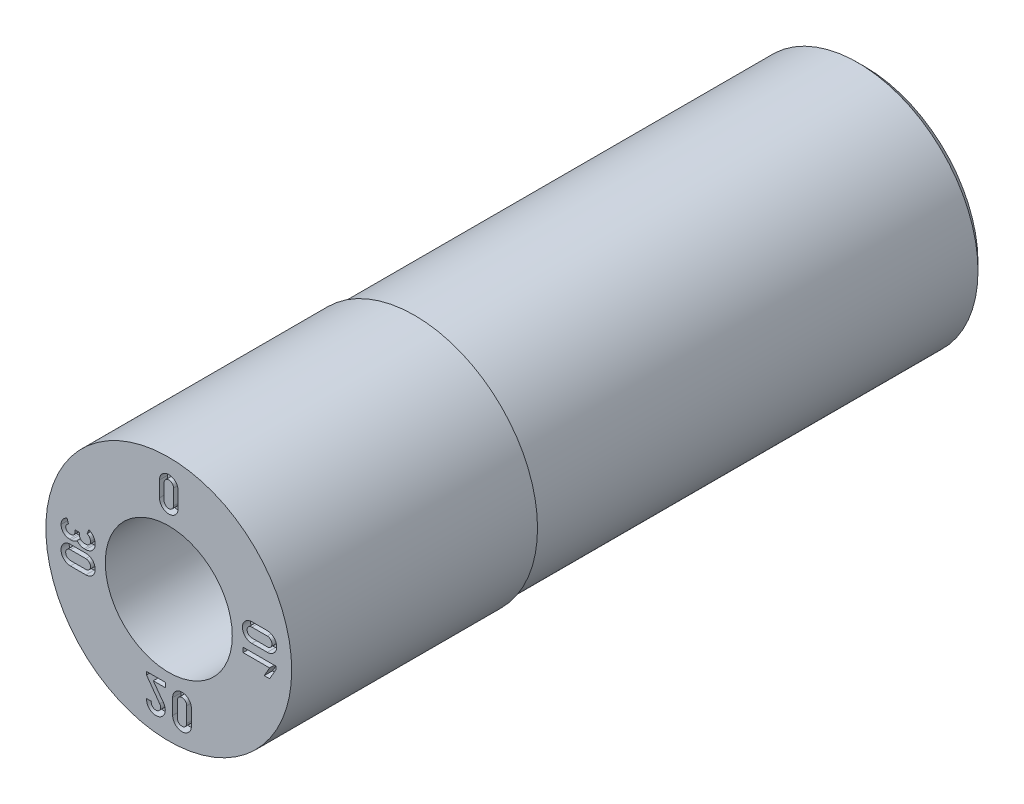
ISO-10303-21;
HEADER;
FILE_DESCRIPTION(('STEP AP214'),'2;1');
FILE_NAME('part.step','',(''),(''),'','','');
FILE_SCHEMA(('AUTOMOTIVE_DESIGN { 1 0 10303 214 1 1 1 1 }'));
ENDSEC;
DATA;
#1=APPLICATION_CONTEXT('core data for automotive mechanical design processes');
#2=APPLICATION_PROTOCOL_DEFINITION('international standard','automotive_design',2000,#1);
#3=PRODUCT_CONTEXT('',#1,'mechanical');
#4=PRODUCT('Part','Part','',(#3));
#5=PRODUCT_RELATED_PRODUCT_CATEGORY('part','',(#4));
#6=PRODUCT_DEFINITION_FORMATION('','',#4);
#7=PRODUCT_DEFINITION_CONTEXT('part definition',#1,'design');
#8=PRODUCT_DEFINITION('design','',#6,#7);
#9=PRODUCT_DEFINITION_SHAPE('','',#8);
#10=(LENGTH_UNIT() NAMED_UNIT(*) SI_UNIT(.MILLI.,.METRE.));
#11=(NAMED_UNIT(*) PLANE_ANGLE_UNIT() SI_UNIT($,.RADIAN.));
#12=(NAMED_UNIT(*) SI_UNIT($,.STERADIAN.) SOLID_ANGLE_UNIT());
#13=UNCERTAINTY_MEASURE_WITH_UNIT(LENGTH_MEASURE(1.E-05),#10,'distance_accuracy_value','');
#14=(GEOMETRIC_REPRESENTATION_CONTEXT(3) GLOBAL_UNCERTAINTY_ASSIGNED_CONTEXT((#13)) GLOBAL_UNIT_ASSIGNED_CONTEXT((#10,
#11,#12)) REPRESENTATION_CONTEXT('',''));
#15=CARTESIAN_POINT('',(0.,0.,0.));
#16=DIRECTION('',(0.,0.,1.));
#17=DIRECTION('',(1.,0.,0.));
#18=AXIS2_PLACEMENT_3D('',#15,#16,#17);
#19=CARTESIAN_POINT('',(0.,0.,3.79790950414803));
#20=DIRECTION('',(0.,0.,1.));
#21=DIRECTION('',(1.,0.,0.));
#22=AXIS2_PLACEMENT_3D('',#19,#20,#21);
#23=CYLINDRICAL_SURFACE('',#22,0.799999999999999);
#24=CARTESIAN_POINT('',(0.,0.,-14.));
#25=DIRECTION('',(0.,0.,1.));
#26=DIRECTION('',(1.,0.,0.));
#27=AXIS2_PLACEMENT_3D('',#24,#25,#26);
#28=CIRCLE('',#27,0.8);
#29=CARTESIAN_POINT('',(0.8,0.,-14.));
#30=VERTEX_POINT('',#29);
#31=EDGE_CURVE('E1155',#30,#30,#28,.T.);
#32=ORIENTED_EDGE('',*,*,#31,.F.);
#33=EDGE_LOOP('',(#32));
#34=FACE_BOUND('',#33,.T.);
#35=CARTESIAN_POINT('',(0.,0.,-4.2));
#36=DIRECTION('',(0.,0.,1.));
#37=DIRECTION('',(1.,0.,0.));
#38=AXIS2_PLACEMENT_3D('',#35,#36,#37);
#39=CIRCLE('',#38,0.799999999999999);
#40=CARTESIAN_POINT('',(0.69282032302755,-0.399999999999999,-4.2));
#41=VERTEX_POINT('',#40);
#42=CARTESIAN_POINT('',(0.,-0.799999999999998,-4.2));
#43=VERTEX_POINT('',#42);
#44=EDGE_CURVE('E11',#41,#43,#39,.F.);
#45=ORIENTED_EDGE('',*,*,#44,.F.);
#46=CARTESIAN_POINT('',(0.69282032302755,0.399999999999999,-4.2));
#47=VERTEX_POINT('',#46);
#48=EDGE_CURVE('E38',#47,#41,#39,.F.);
#49=ORIENTED_EDGE('',*,*,#48,.F.);
#50=CARTESIAN_POINT('',(0.,0.799999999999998,-4.2));
#51=VERTEX_POINT('',#50);
#52=EDGE_CURVE('E525',#51,#47,#39,.F.);
#53=ORIENTED_EDGE('',*,*,#52,.F.);
#54=CARTESIAN_POINT('',(-0.69282032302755,0.399999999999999,-4.2));
#55=VERTEX_POINT('',#54);
#56=EDGE_CURVE('E2235',#55,#51,#39,.F.);
#57=ORIENTED_EDGE('',*,*,#56,.F.);
#58=CARTESIAN_POINT('',(-0.692820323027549,-0.399999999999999,-4.2));
#59=VERTEX_POINT('',#58);
#60=EDGE_CURVE('E2233',#59,#55,#39,.F.);
#61=ORIENTED_EDGE('',*,*,#60,.F.);
#62=EDGE_CURVE('E43',#43,#59,#39,.F.);
#63=ORIENTED_EDGE('',*,*,#62,.F.);
#64=EDGE_LOOP('',(#45,#49,#53,#57,#61,#63));
#65=FACE_BOUND('',#64,.T.);
#66=ADVANCED_FACE('F34',(#34,#65),#23,.F.);
#67=CARTESIAN_POINT('',(0.,0.,3.79790950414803));
#68=DIRECTION('',(0.,0.,1.));
#69=DIRECTION('',(1.,0.,0.));
#70=AXIS2_PLACEMENT_3D('',#67,#68,#69);
#71=CYLINDRICAL_SURFACE('',#70,3.);
#72=CARTESIAN_POINT('',(0.,0.,0.));
#73=DIRECTION('',(0.,0.,1.));
#74=DIRECTION('',(1.,0.,0.));
#75=AXIS2_PLACEMENT_3D('',#72,#73,#74);
#76=CIRCLE('',#75,3.);
#77=CARTESIAN_POINT('',(3.,0.,0.));
#78=VERTEX_POINT('',#77);
#79=EDGE_CURVE('E1164',#78,#78,#76,.T.);
#80=ORIENTED_EDGE('',*,*,#79,.F.);
#81=EDGE_LOOP('',(#80));
#82=FACE_BOUND('',#81,.T.);
#83=CARTESIAN_POINT('',(0.,0.,-6.00000000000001));
#84=DIRECTION('',(0.,0.,-1.));
#85=DIRECTION('',(-1.,0.,0.));
#86=AXIS2_PLACEMENT_3D('',#83,#84,#85);
#87=CIRCLE('',#86,3.);
#88=CARTESIAN_POINT('',(-3.,0.,-6.00000000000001));
#89=VERTEX_POINT('',#88);
#90=EDGE_CURVE('E1149',#89,#89,#87,.T.);
#91=ORIENTED_EDGE('',*,*,#90,.F.);
#92=EDGE_LOOP('',(#91));
#93=FACE_BOUND('',#92,.T.);
#94=ADVANCED_FACE('F36',(#82,#93),#71,.T.);
#95=CARTESIAN_POINT('',(0.,0.,-17.));
#96=DIRECTION('',(0.,0.,1.));
#97=DIRECTION('',(1.,0.,0.));
#98=AXIS2_PLACEMENT_3D('',#95,#96,#97);
#99=CONICAL_SURFACE('',#98,2.7499999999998,0.785398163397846);
#100=CARTESIAN_POINT('',(0.,0.,-17.));
#101=DIRECTION('',(0.,0.,1.));
#102=DIRECTION('',(1.,0.,0.));
#103=AXIS2_PLACEMENT_3D('',#100,#101,#102);
#104=CIRCLE('',#103,2.7499999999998);
#105=CARTESIAN_POINT('',(2.7499999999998,0.,-17.));
#106=VERTEX_POINT('',#105);
#107=EDGE_CURVE('E1145',#106,#106,#104,.T.);
#108=ORIENTED_EDGE('',*,*,#107,.T.);
#109=EDGE_LOOP('',(#108));
#110=FACE_BOUND('',#109,.T.);
#111=CARTESIAN_POINT('',(0.,0.,-16.815));
#112=DIRECTION('',(0.,0.,1.));
#113=DIRECTION('',(1.,0.,0.));
#114=AXIS2_PLACEMENT_3D('',#111,#112,#113);
#115=CIRCLE('',#114,2.935);
#116=CARTESIAN_POINT('',(2.935,0.,-16.815));
#117=VERTEX_POINT('',#116);
#118=EDGE_CURVE('E1144',#117,#117,#115,.T.);
#119=ORIENTED_EDGE('',*,*,#118,.F.);
#120=EDGE_LOOP('',(#119));
#121=FACE_BOUND('',#120,.T.);
#122=ADVANCED_FACE('F1294',(#110,#121),#99,.T.);
#123=CARTESIAN_POINT('',(0.,3.,0.));
#124=DIRECTION('',(0.,0.,-1.));
#125=DIRECTION('',(-1.,0.,0.));
#126=AXIS2_PLACEMENT_3D('',#123,#124,#125);
#127=PLANE('',#126);
#128=DIRECTION('',(8.53203783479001E-05,0.999999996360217,0.));
#129=VECTOR('',#128,1.);
#130=CARTESIAN_POINT('',(0.55231774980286,-2.40991198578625,0.));
#131=LINE('',#130,#129);
#132=CARTESIAN_POINT('',(0.55231774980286,-2.40991198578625,0.));
#133=VERTEX_POINT('',#132);
#134=CARTESIAN_POINT('',(0.55234995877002,-2.03240584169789,0.));
#135=VERTEX_POINT('',#134);
#136=EDGE_CURVE('E625',#133,#135,#131,.T.);
#137=ORIENTED_EDGE('',*,*,#136,.F.);
#138=CARTESIAN_POINT('',(0.32352957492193,-2.40993128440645,0.));
#139=DIRECTION('',(0.,0.,1.));
#140=DIRECTION('',(1.,0.,0.));
#141=AXIS2_PLACEMENT_3D('',#138,#139,#140);
#142=CIRCLE('',#141,0.228788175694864);
#143=CARTESIAN_POINT('',(0.0947413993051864,-2.40993726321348,0.));
#144=VERTEX_POINT('',#143);
#145=EDGE_CURVE('E602',#144,#133,#142,.T.);
#146=ORIENTED_EDGE('',*,*,#145,.F.);
#147=DIRECTION('',(8.43514760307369E-05,-0.999999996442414,0.));
#148=VECTOR('',#147,1.);
#149=CARTESIAN_POINT('',(0.0947095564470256,-2.03243517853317,0.));
#150=LINE('',#149,#148);
#151=CARTESIAN_POINT('',(0.0947095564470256,-2.03243517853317,0.));
#152=VERTEX_POINT('',#151);
#153=EDGE_CURVE('E614',#152,#144,#150,.T.);
#154=ORIENTED_EDGE('',*,*,#153,.F.);
#155=CARTESIAN_POINT('',(0.323529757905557,-2.03242514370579,0.));
#156=DIRECTION('',(0.,0.,1.));
#157=DIRECTION('',(1.,0.,0.));
#158=AXIS2_PLACEMENT_3D('',#155,#156,#157);
#159=CIRCLE('',#158,0.228820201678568);
#160=EDGE_CURVE('E628',#135,#152,#159,.T.);
#161=ORIENTED_EDGE('',*,*,#160,.F.);
#162=EDGE_LOOP('',(#137,#146,#154,#161));
#163=FACE_BOUND('',#162,.T.);
#164=DIRECTION('',(-0.999999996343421,8.55170029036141E-05,0.));
#165=VECTOR('',#164,1.);
#166=CARTESIAN_POINT('',(-2.023123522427,0.150203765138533,0.));
#167=LINE('',#166,#165);
#168=CARTESIAN_POINT('',(-2.023123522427,0.150203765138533,0.));
#169=VERTEX_POINT('',#168);
#170=CARTESIAN_POINT('',(-2.06316166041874,0.150207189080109,0.));
#171=VERTEX_POINT('',#170);
#172=EDGE_CURVE('E727',#169,#171,#167,.T.);
#173=ORIENTED_EDGE('',*,*,#172,.F.);
#174=CARTESIAN_POINT('',(-2.02311374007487,0.264594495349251,0.));
#175=DIRECTION('',(0.,0.,-1.));
#176=DIRECTION('',(1.,0.,0.));
#177=AXIS2_PLACEMENT_3D('',#174,#175,#176);
#178=CIRCLE('',#177,0.114390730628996);
#179=CARTESIAN_POINT('',(-1.90872300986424,0.264584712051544,0.));
#180=VERTEX_POINT('',#179);
#181=EDGE_CURVE('E635',#180,#169,#178,.T.);
#182=ORIENTED_EDGE('',*,*,#181,.F.);
#183=CARTESIAN_POINT('',(-2.04029940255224,0.264595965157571,0.));
#184=DIRECTION('',(0.,0.,-1.));
#185=DIRECTION('',(1.,0.,0.));
#186=AXIS2_PLACEMENT_3D('',#183,#184,#185);
#187=CIRCLE('',#186,0.131576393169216);
#188=CARTESIAN_POINT('',(-1.99199606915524,0.386985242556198,0.));
#189=VERTEX_POINT('',#188);
#190=EDGE_CURVE('E665',#189,#180,#187,.T.);
#191=ORIENTED_EDGE('',*,*,#190,.F.);
#192=DIRECTION('',(-0.367087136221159,-0.930186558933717,0.));
#193=VECTOR('',#192,1.);
#194=CARTESIAN_POINT('',(-1.95001468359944,0.493364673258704,0.));
#195=LINE('',#194,#193);
#196=CARTESIAN_POINT('',(-1.95001468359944,0.493364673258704,0.));
#197=VERTEX_POINT('',#196);
#198=EDGE_CURVE('E777',#197,#189,#195,.T.);
#199=ORIENTED_EDGE('',*,*,#198,.F.);
#200=CARTESIAN_POINT('',(-2.04035547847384,0.26454222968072,0.));
#201=DIRECTION('',(0.,0.,1.));
#202=DIRECTION('',(1.,0.,0.));
#203=AXIS2_PLACEMENT_3D('',#200,#201,#202);
#204=CIRCLE('',#203,0.246010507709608);
#205=CARTESIAN_POINT('',(-1.79434497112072,0.264555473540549,0.));
#206=VERTEX_POINT('',#205);
#207=EDGE_CURVE('E774',#206,#197,#204,.T.);
#208=ORIENTED_EDGE('',*,*,#207,.F.);
#209=CARTESIAN_POINT('',(-2.02309445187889,0.264543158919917,0.));
#210=DIRECTION('',(0.,0.,1.));
#211=DIRECTION('',(1.,0.,0.));
#212=AXIS2_PLACEMENT_3D('',#209,#210,#211);
#213=CIRCLE('',#212,0.22874948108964);
#214=CARTESIAN_POINT('',(-2.02311395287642,0.035793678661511,0.));
#215=VERTEX_POINT('',#214);
#216=EDGE_CURVE('E771',#215,#206,#213,.T.);
#217=ORIENTED_EDGE('',*,*,#216,.F.);
#218=DIRECTION('',(0.99999999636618,-8.52504561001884E-05,0.));
#219=VECTOR('',#218,1.);
#220=CARTESIAN_POINT('',(-2.06316675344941,0.0357970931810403,0.));
#221=LINE('',#220,#219);
#222=CARTESIAN_POINT('',(-2.06316675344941,0.0357970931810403,0.));
#223=VERTEX_POINT('',#222);
#224=EDGE_CURVE('E768',#223,#215,#221,.T.);
#225=ORIENTED_EDGE('',*,*,#224,.F.);
#226=CARTESIAN_POINT('',(-2.06320227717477,0.264489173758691,0.));
#227=DIRECTION('',(0.,0.,1.));
#228=DIRECTION('',(1.,0.,0.));
#229=AXIS2_PLACEMENT_3D('',#226,#227,#228);
#230=CIRCLE('',#229,0.228692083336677);
#231=CARTESIAN_POINT('',(-2.23884692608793,0.118034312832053,0.));
#232=VERTEX_POINT('',#231);
#233=EDGE_CURVE('E765',#232,#223,#230,.T.);
#234=ORIENTED_EDGE('',*,*,#233,.F.);
#235=CARTESIAN_POINT('',(-2.38343517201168,0.264514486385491,0.));
#236=DIRECTION('',(0.,0.,1.));
#237=DIRECTION('',(1.,0.,0.));
#238=AXIS2_PLACEMENT_3D('',#235,#236,#237);
#239=CIRCLE('',#238,0.205820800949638);
#240=CARTESIAN_POINT('',(-2.38345285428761,0.0586936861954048,0.));
#241=VERTEX_POINT('',#240);
#242=EDGE_CURVE('E762',#241,#232,#239,.T.);
#243=ORIENTED_EDGE('',*,*,#242,.F.);
#244=DIRECTION('',(0.999999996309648,-8.59110264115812E-05,0.));
#245=VECTOR('',#244,1.);
#246=CARTESIAN_POINT('',(-2.42347407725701,0.058697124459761,0.));
#247=LINE('',#246,#245);
#248=CARTESIAN_POINT('',(-2.42347407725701,0.058697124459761,0.));
#249=VERTEX_POINT('',#248);
#250=EDGE_CURVE('E759',#249,#241,#247,.T.);
#251=ORIENTED_EDGE('',*,*,#250,.F.);
#252=CARTESIAN_POINT('',(-2.42348827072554,0.264586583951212,0.));
#253=DIRECTION('',(0.,0.,1.));
#254=DIRECTION('',(1.,0.,0.));
#255=AXIS2_PLACEMENT_3D('',#252,#253,#254);
#256=CIRCLE('',#255,0.20588945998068);
#257=CARTESIAN_POINT('',(-2.62937772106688,0.264649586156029,0.));
#258=VERTEX_POINT('',#257);
#259=EDGE_CURVE('E756',#258,#249,#256,.T.);
#260=ORIENTED_EDGE('',*,*,#259,.F.);
#261=CARTESIAN_POINT('',(-2.41197371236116,0.264583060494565,0.));
#262=DIRECTION('',(0.,0.,1.));
#263=DIRECTION('',(1.,0.,0.));
#264=AXIS2_PLACEMENT_3D('',#261,#262,#263);
#265=CIRCLE('',#264,0.217404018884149);
#266=CARTESIAN_POINT('',(-2.48158867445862,0.470540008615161,0.));
#267=VERTEX_POINT('',#266);
#268=EDGE_CURVE('E753',#267,#258,#265,.T.);
#269=ORIENTED_EDGE('',*,*,#268,.F.);
#270=DIRECTION('',(-0.319923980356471,0.94744321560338,0.));
#271=VECTOR('',#270,1.);
#272=CARTESIAN_POINT('',(-2.44498751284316,0.362147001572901,0.));
#273=LINE('',#272,#271);
#274=CARTESIAN_POINT('',(-2.44498751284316,0.362147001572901,0.));
#275=VERTEX_POINT('',#274);
#276=EDGE_CURVE('E750',#275,#267,#273,.T.);
#277=ORIENTED_EDGE('',*,*,#276,.F.);
#278=CARTESIAN_POINT('',(-2.4121658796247,0.264711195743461,0.));
#279=DIRECTION('',(0.,0.,-1.));
#280=DIRECTION('',(1.,0.,0.));
#281=AXIS2_PLACEMENT_3D('',#278,#279,#280);
#282=CIRCLE('',#281,0.102815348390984);
#283=CARTESIAN_POINT('',(-2.51498118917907,0.264621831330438,0.));
#284=VERTEX_POINT('',#283);
#285=EDGE_CURVE('E747',#284,#275,#282,.T.);
#286=ORIENTED_EDGE('',*,*,#285,.F.);
#287=CARTESIAN_POINT('',(-2.42338695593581,0.264701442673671,0.));
#288=DIRECTION('',(0.,0.,-1.));
#289=DIRECTION('',(1.,0.,0.));
#290=AXIS2_PLACEMENT_3D('',#287,#288,#289);
#291=CIRCLE('',#290,0.0915942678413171);
#292=CARTESIAN_POINT('',(-2.42347566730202,0.173107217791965,0.));
#293=VERTEX_POINT('',#292);
#294=EDGE_CURVE('E744',#293,#284,#291,.T.);
#295=ORIENTED_EDGE('',*,*,#294,.F.);
#296=DIRECTION('',(-0.999999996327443,8.57036442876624E-05,0.));
#297=VECTOR('',#296,1.);
#298=CARTESIAN_POINT('',(-2.38344306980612,0.173103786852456,0.));
#299=LINE('',#298,#297);
#300=CARTESIAN_POINT('',(-2.38344306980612,0.173103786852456,0.));
#301=VERTEX_POINT('',#300);
#302=EDGE_CURVE('E741',#301,#293,#299,.T.);
#303=ORIENTED_EDGE('',*,*,#302,.F.);
#304=CARTESIAN_POINT('',(-2.38343522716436,0.264612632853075,0.));
#305=DIRECTION('',(0.,0.,-1.));
#306=DIRECTION('',(1.,0.,0.));
#307=AXIS2_PLACEMENT_3D('',#304,#305,#306);
#308=CIRCLE('',#307,0.0915088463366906);
#309=CARTESIAN_POINT('',(-2.29192638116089,0.264604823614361,0.));
#310=VERTEX_POINT('',#309);
#311=EDGE_CURVE('E738',#310,#301,#308,.T.);
#312=ORIENTED_EDGE('',*,*,#311,.F.);
#313=DIRECTION('',(-8.55211335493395E-05,-0.999999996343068,0.));
#314=VECTOR('',#313,1.);
#315=CARTESIAN_POINT('',(-2.29192149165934,0.321777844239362,0.));
#316=LINE('',#315,#314);
#317=CARTESIAN_POINT('',(-2.29192149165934,0.321777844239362,0.));
#318=VERTEX_POINT('',#317);
#319=EDGE_CURVE('E734',#318,#310,#316,.T.);
#320=ORIENTED_EDGE('',*,*,#319,.F.);
#321=DIRECTION('',(-0.999999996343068,8.55211333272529E-05,0.));
#322=VECTOR('',#321,1.);
#323=CARTESIAN_POINT('',(-2.17751139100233,0.321768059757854,0.));
#324=LINE('',#323,#322);
#325=CARTESIAN_POINT('',(-2.17751139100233,0.321768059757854,0.));
#326=VERTEX_POINT('',#325);
#327=EDGE_CURVE('E731',#326,#318,#324,.T.);
#328=ORIENTED_EDGE('',*,*,#327,.F.);
#329=DIRECTION('',(8.54959130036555E-05,0.999999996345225,0.));
#330=VECTOR('',#329,1.);
#331=CARTESIAN_POINT('',(-2.17751628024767,0.264581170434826,0.));
#332=LINE('',#331,#330);
#333=CARTESIAN_POINT('',(-2.17751628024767,0.264581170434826,0.));
#334=VERTEX_POINT('',#333);
#335=EDGE_CURVE('E735',#334,#326,#332,.T.);
#336=ORIENTED_EDGE('',*,*,#335,.F.);
#337=CARTESIAN_POINT('',(-2.06315207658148,0.264571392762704,0.));
#338=DIRECTION('',(0.,0.,-1.));
#339=DIRECTION('',(1.,0.,0.));
#340=AXIS2_PLACEMENT_3D('',#337,#338,#339);
#341=CIRCLE('',#340,0.114364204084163);
#342=EDGE_CURVE('E730',#171,#334,#341,.T.);
#343=ORIENTED_EDGE('',*,*,#342,.F.);
#344=EDGE_LOOP('',(#173,#182,#191,#199,#208,#217,#225,#234,#243,#251,#260,#269,#277,#286,#295,
#303,#312,#320,#328,#336,#343));
#345=FACE_BOUND('',#344,.T.);
#346=DIRECTION('',(-0.999999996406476,8.47764585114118E-05,0.));
#347=VECTOR('',#346,1.);
#348=CARTESIAN_POINT('',(2.40458138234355,0.537339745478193,0.));
#349=LINE('',#348,#347);
#350=CARTESIAN_POINT('',(2.40458138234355,0.537339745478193,0.));
#351=VERTEX_POINT('',#350);
#352=CARTESIAN_POINT('',(2.02708855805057,0.537371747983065,0.));
#353=VERTEX_POINT('',#352);
#354=EDGE_CURVE('E872',#351,#353,#349,.T.);
#355=ORIENTED_EDGE('',*,*,#354,.F.);
#356=CARTESIAN_POINT('',(2.40460080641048,0.308551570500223,0.));
#357=DIRECTION('',(0.,0.,1.));
#358=DIRECTION('',(1.,0.,0.));
#359=AXIS2_PLACEMENT_3D('',#356,#357,#358);
#360=CIRCLE('',#359,0.22878817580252);
#361=CARTESIAN_POINT('',(2.40462023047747,0.0797633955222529,0.));
#362=VERTEX_POINT('',#361);
#363=EDGE_CURVE('E850',#362,#351,#360,.T.);
#364=ORIENTED_EDGE('',*,*,#363,.F.);
#365=DIRECTION('',(0.999999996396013,8.48997850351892E-05,0.));
#366=VECTOR('',#365,1.);
#367=CARTESIAN_POINT('',(2.02711814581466,0.0797313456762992,0.));
#368=LINE('',#367,#366);
#369=CARTESIAN_POINT('',(2.02711814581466,0.0797313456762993,0.));
#370=VERTEX_POINT('',#369);
#371=EDGE_CURVE('E861',#370,#362,#368,.T.);
#372=ORIENTED_EDGE('',*,*,#371,.F.);
#373=CARTESIAN_POINT('',(2.0270906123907,0.308551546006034,0.));
#374=DIRECTION('',(0.,0.,1.));
#375=DIRECTION('',(1.,0.,0.));
#376=AXIS2_PLACEMENT_3D('',#373,#374,#375);
#377=CIRCLE('',#376,0.228820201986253);
#378=EDGE_CURVE('E875',#353,#370,#377,.T.);
#379=ORIENTED_EDGE('',*,*,#378,.F.);
#380=EDGE_LOOP('',(#355,#364,#372,#379));
#381=FACE_BOUND('',#380,.T.);
#382=DIRECTION('',(8.48997847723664E-05,-0.999999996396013,0.));
#383=VECTOR('',#382,1.);
#384=CARTESIAN_POINT('',(1.81471744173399,-0.222173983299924,0.));
#385=LINE('',#384,#383);
#386=CARTESIAN_POINT('',(1.81470773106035,-0.10779591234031,0.));
#387=VERTEX_POINT('',#386);
#388=CARTESIAN_POINT('',(1.81471744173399,-0.222173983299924,0.));
#389=VERTEX_POINT('',#388);
#390=EDGE_CURVE('E913',#387,#389,#385,.T.);
#391=ORIENTED_EDGE('',*,*,#390,.F.);
#392=DIRECTION('',(-0.999999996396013,-8.48997846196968E-05,0.));
#393=VECTOR('',#392,1.);
#394=CARTESIAN_POINT('',(1.81470773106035,-0.107795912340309,0.));
#395=LINE('',#394,#393);
#396=CARTESIAN_POINT('',(2.61545031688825,-0.107727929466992,0.));
#397=VERTEX_POINT('',#396);
#398=EDGE_CURVE('E882',#397,#387,#395,.T.);
#399=ORIENTED_EDGE('',*,*,#398,.F.);
#400=DIRECTION('',(-8.48997828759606E-05,0.999999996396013,0.));
#401=VECTOR('',#400,1.);
#402=CARTESIAN_POINT('',(2.61545031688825,-0.107727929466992,0.));
#403=LINE('',#402,#401);
#404=CARTESIAN_POINT('',(2.61545670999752,-0.183029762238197,0.));
#405=VERTEX_POINT('',#404);
#406=EDGE_CURVE('E893',#405,#397,#403,.T.);
#407=ORIENTED_EDGE('',*,*,#406,.F.);
#408=DIRECTION('',(0.498418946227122,0.866936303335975,0.));
#409=VECTOR('',#408,1.);
#410=CARTESIAN_POINT('',(2.61545670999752,-0.183029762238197,0.));
#411=LINE('',#410,#409);
#412=CARTESIAN_POINT('',(2.46144860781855,-0.450907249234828,0.));
#413=VERTEX_POINT('',#412);
#414=EDGE_CURVE('E925',#413,#405,#411,.T.);
#415=ORIENTED_EDGE('',*,*,#414,.F.);
#416=DIRECTION('',(0.999999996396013,8.48997838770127E-05,0.));
#417=VECTOR('',#416,1.);
#418=CARTESIAN_POINT('',(2.46144860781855,-0.450907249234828,0.));
#419=LINE('',#418,#417);
#420=CARTESIAN_POINT('',(2.3295182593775,-0.450918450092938,0.));
#421=VERTEX_POINT('',#420);
#422=EDGE_CURVE('E922',#421,#413,#419,.T.);
#423=ORIENTED_EDGE('',*,*,#422,.F.);
#424=DIRECTION('',(-0.498285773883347,-0.867012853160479,0.));
#425=VECTOR('',#424,1.);
#426=CARTESIAN_POINT('',(2.3295182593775,-0.450918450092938,0.));
#427=LINE('',#426,#425);
#428=CARTESIAN_POINT('',(2.46101279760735,-0.222119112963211,0.));
#429=VERTEX_POINT('',#428);
#430=EDGE_CURVE('E919',#429,#421,#427,.T.);
#431=ORIENTED_EDGE('',*,*,#430,.F.);
#432=DIRECTION('',(0.999999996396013,8.48997846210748E-05,0.));
#433=VECTOR('',#432,1.);
#434=CARTESIAN_POINT('',(2.46101279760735,-0.222119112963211,0.));
#435=LINE('',#434,#433);
#436=EDGE_CURVE('E916',#389,#429,#435,.T.);
#437=ORIENTED_EDGE('',*,*,#436,.F.);
#438=EDGE_LOOP('',(#391,#399,#407,#415,#423,#431,#437));
#439=FACE_BOUND('',#438,.T.);
#440=DIRECTION('',(-8.43514763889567E-05,0.999999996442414,0.));
#441=VECTOR('',#440,1.);
#442=CARTESIAN_POINT('',(-0.0853644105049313,-1.91355110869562,0.));
#443=LINE('',#442,#441);
#444=CARTESIAN_POINT('',(-0.0853644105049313,-1.91355110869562,0.));
#445=VERTEX_POINT('',#444);
#446=CARTESIAN_POINT('',(-0.0853740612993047,-1.79913942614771,0.));
#447=VERTEX_POINT('',#446);
#448=EDGE_CURVE('E975',#445,#447,#443,.T.);
#449=ORIENTED_EDGE('',*,*,#448,.F.);
#450=DIRECTION('',(0.999999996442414,8.4351475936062E-05,0.));
#451=VECTOR('',#450,1.);
#452=CARTESIAN_POINT('',(-0.377090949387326,-1.91357571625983,0.));
#453=LINE('',#452,#451);
#454=CARTESIAN_POINT('',(-0.377090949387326,-1.91357571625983,0.));
#455=VERTEX_POINT('',#454);
#456=EDGE_CURVE('E932',#455,#445,#453,.T.);
#457=ORIENTED_EDGE('',*,*,#456,.F.);
#458=DIRECTION('',(-0.589622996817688,0.807678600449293,0.));
#459=VECTOR('',#458,1.);
#460=CARTESIAN_POINT('',(-0.128264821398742,-2.25442324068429,0.));
#461=LINE('',#460,#459);
#462=CARTESIAN_POINT('',(-0.128264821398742,-2.25442324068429,0.));
#463=VERTEX_POINT('',#462);
#464=EDGE_CURVE('E949',#463,#455,#461,.T.);
#465=ORIENTED_EDGE('',*,*,#464,.F.);
#466=CARTESIAN_POINT('',(-0.314014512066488,-2.38815311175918,0.));
#467=DIRECTION('',(0.,0.,1.));
#468=DIRECTION('',(1.,0.,0.));
#469=AXIS2_PLACEMENT_3D('',#466,#467,#468);
#470=CIRCLE('',#469,0.228881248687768);
#471=CARTESIAN_POINT('',(-0.542262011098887,-2.3711323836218,0.));
#472=VERTEX_POINT('',#471);
#473=EDGE_CURVE('E993',#472,#463,#470,.T.);
#474=ORIENTED_EDGE('',*,*,#473,.F.);
#475=DIRECTION('',(-0.999999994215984,-0.000107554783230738,0.));
#476=VECTOR('',#475,1.);
#477=CARTESIAN_POINT('',(-0.4272015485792,-2.37112000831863,0.));
#478=LINE('',#477,#476);
#479=CARTESIAN_POINT('',(-0.4272015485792,-2.37112000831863,0.));
#480=VERTEX_POINT('',#479);
#481=EDGE_CURVE('E990',#480,#472,#478,.T.);
#482=ORIENTED_EDGE('',*,*,#481,.F.);
#483=CARTESIAN_POINT('',(-0.314072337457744,-2.38827869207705,0.));
#484=DIRECTION('',(0.,0.,-1.));
#485=DIRECTION('',(1.,0.,0.));
#486=AXIS2_PLACEMENT_3D('',#483,#484,#485);
#487=CIRCLE('',#486,0.114423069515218);
#488=CARTESIAN_POINT('',(-0.221232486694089,-2.32139520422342,0.));
#489=VERTEX_POINT('',#488);
#490=EDGE_CURVE('E987',#489,#480,#487,.T.);
#491=ORIENTED_EDGE('',*,*,#490,.F.);
#492=DIRECTION('',(0.58452799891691,-0.811373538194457,0.));
#493=VECTOR('',#492,1.);
#494=CARTESIAN_POINT('',(-0.542944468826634,-1.87483218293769,0.));
#495=LINE('',#494,#493);
#496=CARTESIAN_POINT('',(-0.542944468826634,-1.87483218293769,0.));
#497=VERTEX_POINT('',#496);
#498=EDGE_CURVE('E984',#497,#489,#495,.T.);
#499=ORIENTED_EDGE('',*,*,#498,.F.);
#500=DIRECTION('',(8.43514742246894E-05,-0.999999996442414,0.));
#501=VECTOR('',#500,1.);
#502=CARTESIAN_POINT('',(-0.542950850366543,-1.7991780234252,0.));
#503=LINE('',#502,#501);
#504=CARTESIAN_POINT('',(-0.542950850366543,-1.7991780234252,0.));
#505=VERTEX_POINT('',#504);
#506=EDGE_CURVE('E981',#505,#497,#503,.T.);
#507=ORIENTED_EDGE('',*,*,#506,.F.);
#508=DIRECTION('',(-0.999999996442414,-8.43514755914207E-05,0.));
#509=VECTOR('',#508,1.);
#510=CARTESIAN_POINT('',(-0.0853740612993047,-1.79913942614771,0.));
#511=LINE('',#510,#509);
#512=EDGE_CURVE('E978',#447,#505,#511,.T.);
#513=ORIENTED_EDGE('',*,*,#512,.F.);
#514=EDGE_LOOP('',(#449,#457,#465,#474,#482,#491,#499,#507,#513));
#515=FACE_BOUND('',#514,.T.);
#516=DIRECTION('',(8.43544746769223E-05,-0.999999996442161,0.));
#517=VECTOR('',#516,1.);
#518=CARTESIAN_POINT('',(-0.227844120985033,2.40599793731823,0.));
#519=LINE('',#518,#517);
#520=CARTESIAN_POINT('',(-0.227844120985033,2.40599793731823,0.));
#521=VERTEX_POINT('',#520);
#522=CARTESIAN_POINT('',(-0.22781227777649,2.028505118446,0.));
#523=VERTEX_POINT('',#522);
#524=EDGE_CURVE('E1060',#521,#523,#519,.T.);
#525=ORIENTED_EDGE('',*,*,#524,.F.);
#526=CARTESIAN_POINT('',(0.00100810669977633,2.40601724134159,0.));
#527=DIRECTION('',(0.,0.,1.));
#528=DIRECTION('',(1.,0.,0.));
#529=AXIS2_PLACEMENT_3D('',#526,#527,#528);
#530=CIRCLE('',#529,0.228852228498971);
#531=CARTESIAN_POINT('',(0.229860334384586,2.40603654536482,0.));
#532=VERTEX_POINT('',#531);
#533=EDGE_CURVE('E1039',#532,#521,#530,.T.);
#534=ORIENTED_EDGE('',*,*,#533,.F.);
#535=DIRECTION('',(8.53236016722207E-05,0.999999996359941,0.));
#536=VECTOR('',#535,1.);
#537=CARTESIAN_POINT('',(0.229828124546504,2.02853445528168,0.));
#538=LINE('',#537,#536);
#539=CARTESIAN_POINT('',(0.229828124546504,2.02853445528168,0.));
#540=VERTEX_POINT('',#539);
#541=EDGE_CURVE('E1049',#540,#532,#538,.T.);
#542=ORIENTED_EDGE('',*,*,#541,.F.);
#543=CARTESIAN_POINT('',(0.00100792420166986,2.0285070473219,0.));
#544=DIRECTION('',(0.,0.,1.));
#545=DIRECTION('',(1.,0.,0.));
#546=AXIS2_PLACEMENT_3D('',#543,#544,#545);
#547=CIRCLE('',#546,0.22882020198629);
#548=EDGE_CURVE('E1063',#523,#540,#547,.T.);
#549=ORIENTED_EDGE('',*,*,#548,.F.);
#550=EDGE_LOOP('',(#525,#534,#542,#549));
#551=FACE_BOUND('',#550,.T.);
#552=DIRECTION('',(0.999999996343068,-8.55211335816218E-05,0.));
#553=VECTOR('',#552,1.);
#554=CARTESIAN_POINT('',(-2.02343032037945,-0.49824498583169,0.));
#555=LINE('',#554,#553);
#556=CARTESIAN_POINT('',(-2.40093240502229,-0.498212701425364,0.));
#557=VERTEX_POINT('',#556);
#558=CARTESIAN_POINT('',(-2.02343032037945,-0.49824498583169,0.));
#559=VERTEX_POINT('',#558);
#560=EDGE_CURVE('E1125',#557,#559,#555,.T.);
#561=ORIENTED_EDGE('',*,*,#560,.F.);
#562=CARTESIAN_POINT('',(-2.40091283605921,-0.269392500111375,0.));
#563=DIRECTION('',(0.,0.,1.));
#564=DIRECTION('',(1.,0.,0.));
#565=AXIS2_PLACEMENT_3D('',#562,#563,#564);
#566=CIRCLE('',#565,0.228820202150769);
#567=CARTESIAN_POINT('',(-2.40089326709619,-0.0405722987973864,0.));
#568=VERTEX_POINT('',#567);
#569=EDGE_CURVE('E1103',#568,#557,#566,.T.);
#570=ORIENTED_EDGE('',*,*,#569,.F.);
#571=DIRECTION('',(-0.999999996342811,8.55241324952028E-05,0.));
#572=VECTOR('',#571,1.);
#573=CARTESIAN_POINT('',(-2.40089326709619,-0.0405722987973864,0.));
#574=LINE('',#573,#572);
#575=CARTESIAN_POINT('',(-2.0234004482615,-0.0406045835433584,0.));
#576=VERTEX_POINT('',#575);
#577=EDGE_CURVE('E1114',#576,#568,#574,.T.);
#578=ORIENTED_EDGE('',*,*,#577,.F.);
#579=CARTESIAN_POINT('',(-2.02341538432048,-0.269424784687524,0.));
#580=DIRECTION('',(0.,0.,1.));
#581=DIRECTION('',(1.,0.,0.));
#582=AXIS2_PLACEMENT_3D('',#579,#580,#581);
#583=CIRCLE('',#582,0.228820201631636);
#584=EDGE_CURVE('E1128',#559,#576,#583,.T.);
#585=ORIENTED_EDGE('',*,*,#584,.F.);
#586=EDGE_LOOP('',(#561,#570,#578,#585));
#587=FACE_BOUND('',#586,.T.);
#588=CARTESIAN_POINT('',(0.,0.,0.));
#589=DIRECTION('',(0.,0.,1.));
#590=DIRECTION('',(1.,0.,0.));
#591=AXIS2_PLACEMENT_3D('',#588,#589,#590);
#592=CIRCLE('',#591,1.55);
#593=CARTESIAN_POINT('',(1.55,0.,0.));
#594=VERTEX_POINT('',#593);
#595=EDGE_CURVE('E1161',#594,#594,#592,.T.);
#596=ORIENTED_EDGE('',*,*,#595,.F.);
#597=EDGE_LOOP('',(#596));
#598=FACE_BOUND('',#597,.T.);
#599=ORIENTED_EDGE('',*,*,#79,.T.);
#600=EDGE_LOOP('',(#599));
#601=FACE_BOUND('',#600,.T.);
#602=ADVANCED_FACE('F1200',(#163,#345,#381,#439,#515,#551,#587,#598,#601),#127,.F.);
#603=CARTESIAN_POINT('',(0.,0.,3.79790950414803));
#604=DIRECTION('',(0.,0.,1.));
#605=DIRECTION('',(1.,0.,0.));
#606=AXIS2_PLACEMENT_3D('',#603,#604,#605);
#607=CYLINDRICAL_SURFACE('',#606,1.55);
#608=CARTESIAN_POINT('',(0.,0.,-2.8));
#609=DIRECTION('',(0.,0.,1.));
#610=DIRECTION('',(1.,0.,0.));
#611=AXIS2_PLACEMENT_3D('',#608,#609,#610);
#612=CIRCLE('',#611,1.55);
#613=CARTESIAN_POINT('',(1.55,0.,-2.8));
#614=VERTEX_POINT('',#613);
#615=EDGE_CURVE('E1158',#614,#614,#612,.T.);
#616=ORIENTED_EDGE('',*,*,#615,.F.);
#617=EDGE_LOOP('',(#616));
#618=FACE_BOUND('',#617,.T.);
#619=ORIENTED_EDGE('',*,*,#595,.T.);
#620=EDGE_LOOP('',(#619));
#621=FACE_BOUND('',#620,.T.);
#622=ADVANCED_FACE('F1305',(#618,#621),#607,.F.);
#623=CARTESIAN_POINT('',(0.,1.55,-2.8));
#624=DIRECTION('',(0.,0.,-1.));
#625=DIRECTION('',(-1.,0.,0.));
#626=AXIS2_PLACEMENT_3D('',#623,#624,#625);
#627=PLANE('',#626);
#628=DIRECTION('',(-1.,0.,0.));
#629=VECTOR('',#628,1.);
#630=CARTESIAN_POINT('',(0.4618802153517,0.799999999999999,-2.8));
#631=LINE('',#630,#629);
#632=CARTESIAN_POINT('',(0.4618802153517,0.799999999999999,-2.8));
#633=VERTEX_POINT('',#632);
#634=CARTESIAN_POINT('',(-0.4618802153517,0.799999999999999,-2.8));
#635=VERTEX_POINT('',#634);
#636=EDGE_CURVE('E50',#633,#635,#631,.T.);
#637=ORIENTED_EDGE('',*,*,#636,.F.);
#638=DIRECTION('',(-0.5,0.866025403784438,0.));
#639=VECTOR('',#638,1.);
#640=CARTESIAN_POINT('',(0.9237604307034,0.,-2.8));
#641=LINE('',#640,#639);
#642=CARTESIAN_POINT('',(0.9237604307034,0.,-2.8));
#643=VERTEX_POINT('',#642);
#644=EDGE_CURVE('E534',#643,#633,#641,.T.);
#645=ORIENTED_EDGE('',*,*,#644,.F.);
#646=DIRECTION('',(0.5,0.866025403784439,0.));
#647=VECTOR('',#646,1.);
#648=CARTESIAN_POINT('',(0.4618802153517,-0.799999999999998,-2.8));
#649=LINE('',#648,#647);
#650=CARTESIAN_POINT('',(0.4618802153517,-0.799999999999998,-2.8));
#651=VERTEX_POINT('',#650);
#652=EDGE_CURVE('E528',#651,#643,#649,.T.);
#653=ORIENTED_EDGE('',*,*,#652,.F.);
#654=DIRECTION('',(1.,0.,0.));
#655=VECTOR('',#654,1.);
#656=CARTESIAN_POINT('',(-0.461880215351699,-0.799999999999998,-2.8));
#657=LINE('',#656,#655);
#658=CARTESIAN_POINT('',(-0.461880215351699,-0.799999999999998,-2.8));
#659=VERTEX_POINT('',#658);
#660=EDGE_CURVE('E568',#659,#651,#657,.T.);
#661=ORIENTED_EDGE('',*,*,#660,.F.);
#662=DIRECTION('',(0.5,-0.866025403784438,0.));
#663=VECTOR('',#662,1.);
#664=CARTESIAN_POINT('',(-0.923760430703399,0.,-2.8));
#665=LINE('',#664,#663);
#666=CARTESIAN_POINT('',(-0.923760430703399,0.,-2.8));
#667=VERTEX_POINT('',#666);
#668=EDGE_CURVE('E565',#667,#659,#665,.T.);
#669=ORIENTED_EDGE('',*,*,#668,.F.);
#670=DIRECTION('',(-0.5,-0.866025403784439,0.));
#671=VECTOR('',#670,1.);
#672=CARTESIAN_POINT('',(-0.4618802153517,0.799999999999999,-2.8));
#673=LINE('',#672,#671);
#674=EDGE_CURVE('E562',#635,#667,#673,.T.);
#675=ORIENTED_EDGE('',*,*,#674,.F.);
#676=EDGE_LOOP('',(#637,#645,#653,#661,#669,#675));
#677=FACE_BOUND('',#676,.T.);
#678=ORIENTED_EDGE('',*,*,#615,.T.);
#679=EDGE_LOOP('',(#678));
#680=FACE_BOUND('',#679,.T.);
#681=ADVANCED_FACE('F1302',(#677,#680),#627,.F.);
#682=CARTESIAN_POINT('',(0.,0.8,-14.));
#683=DIRECTION('',(0.,0.,1.));
#684=DIRECTION('',(1.,0.,0.));
#685=AXIS2_PLACEMENT_3D('',#682,#683,#684);
#686=PLANE('',#685);
#687=CARTESIAN_POINT('',(0.,0.,-14.));
#688=DIRECTION('',(0.,0.,1.));
#689=DIRECTION('',(1.,0.,0.));
#690=AXIS2_PLACEMENT_3D('',#687,#688,#689);
#691=CIRCLE('',#690,1.5);
#692=CARTESIAN_POINT('',(1.5,0.,-14.));
#693=VERTEX_POINT('',#692);
#694=EDGE_CURVE('E1152',#693,#693,#691,.T.);
#695=ORIENTED_EDGE('',*,*,#694,.F.);
#696=EDGE_LOOP('',(#695));
#697=FACE_BOUND('',#696,.T.);
#698=ORIENTED_EDGE('',*,*,#31,.T.);
#699=EDGE_LOOP('',(#698));
#700=FACE_BOUND('',#699,.T.);
#701=ADVANCED_FACE('F1300',(#697,#700),#686,.F.);
#702=CARTESIAN_POINT('',(0.,0.,3.79790950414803));
#703=DIRECTION('',(0.,0.,1.));
#704=DIRECTION('',(1.,0.,0.));
#705=AXIS2_PLACEMENT_3D('',#702,#703,#704);
#706=CYLINDRICAL_SURFACE('',#705,1.5);
#707=CARTESIAN_POINT('',(0.,0.,-17.));
#708=DIRECTION('',(0.,0.,1.));
#709=DIRECTION('',(1.,0.,0.));
#710=AXIS2_PLACEMENT_3D('',#707,#708,#709);
#711=CIRCLE('',#710,1.5);
#712=CARTESIAN_POINT('',(1.5,0.,-17.));
#713=VERTEX_POINT('',#712);
#714=EDGE_CURVE('E1148',#713,#713,#711,.T.);
#715=ORIENTED_EDGE('',*,*,#714,.F.);
#716=EDGE_LOOP('',(#715));
#717=FACE_BOUND('',#716,.T.);
#718=ORIENTED_EDGE('',*,*,#694,.T.);
#719=EDGE_LOOP('',(#718));
#720=FACE_BOUND('',#719,.T.);
#721=ADVANCED_FACE('F1431',(#717,#720),#706,.F.);
#722=CARTESIAN_POINT('',(0.,1.5,-17.));
#723=DIRECTION('',(0.,0.,1.));
#724=DIRECTION('',(1.,0.,0.));
#725=AXIS2_PLACEMENT_3D('',#722,#723,#724);
#726=PLANE('',#725);
#727=ORIENTED_EDGE('',*,*,#107,.F.);
#728=EDGE_LOOP('',(#727));
#729=FACE_BOUND('',#728,.T.);
#730=ORIENTED_EDGE('',*,*,#714,.T.);
#731=EDGE_LOOP('',(#730));
#732=FACE_BOUND('',#731,.T.);
#733=ADVANCED_FACE('F1421',(#729,#732),#726,.F.);
#734=CARTESIAN_POINT('',(0.,3.935,-6.00000000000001));
#735=DIRECTION('',(0.,0.,-1.));
#736=DIRECTION('',(-1.,0.,0.));
#737=AXIS2_PLACEMENT_3D('',#734,#735,#736);
#738=PLANE('',#737);
#739=CARTESIAN_POINT('',(0.,0.,-6.00000000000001));
#740=DIRECTION('',(0.,0.,1.));
#741=DIRECTION('',(1.,0.,0.));
#742=AXIS2_PLACEMENT_3D('',#739,#740,#741);
#743=CIRCLE('',#742,2.935);
#744=CARTESIAN_POINT('',(2.935,0.,-6.00000000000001));
#745=VERTEX_POINT('',#744);
#746=EDGE_CURVE('E1135',#745,#745,#743,.T.);
#747=ORIENTED_EDGE('',*,*,#746,.T.);
#748=EDGE_LOOP('',(#747));
#749=FACE_BOUND('',#748,.T.);
#750=ORIENTED_EDGE('',*,*,#90,.T.);
#751=EDGE_LOOP('',(#750));
#752=FACE_BOUND('',#751,.T.);
#753=ADVANCED_FACE('F1418',(#749,#752),#738,.T.);
#754=CARTESIAN_POINT('',(0.,0.,0.));
#755=DIRECTION('',(0.,0.,1.));
#756=DIRECTION('',(1.,0.,0.));
#757=AXIS2_PLACEMENT_3D('',#754,#755,#756);
#758=CYLINDRICAL_SURFACE('',#757,2.935);
#759=ORIENTED_EDGE('',*,*,#746,.F.);
#760=EDGE_LOOP('',(#759));
#761=FACE_BOUND('',#760,.T.);
#762=ORIENTED_EDGE('',*,*,#118,.T.);
#763=EDGE_LOOP('',(#762));
#764=FACE_BOUND('',#763,.T.);
#765=ADVANCED_FACE('F1420',(#761,#764),#758,.T.);
#766=CARTESIAN_POINT('',(-2.40091283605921,-0.269392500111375,-0.2));
#767=DIRECTION('',(0.,0.,1.));
#768=DIRECTION('',(1.,0.,0.));
#769=AXIS2_PLACEMENT_3D('',#766,#767,#768);
#770=CYLINDRICAL_SURFACE('',#769,0.228820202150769);
#771=ORIENTED_EDGE('',*,*,#569,.T.);
#772=DIRECTION('',(0.,0.,1.));
#773=VECTOR('',#772,1.);
#774=CARTESIAN_POINT('',(-2.40093240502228,-0.498212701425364,-0.2));
#775=LINE('',#774,#773);
#776=CARTESIAN_POINT('',(-2.40093240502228,-0.498212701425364,-0.2));
#777=VERTEX_POINT('',#776);
#778=EDGE_CURVE('E1123',#777,#557,#775,.T.);
#779=ORIENTED_EDGE('',*,*,#778,.F.);
#780=CARTESIAN_POINT('',(-2.40091283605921,-0.269392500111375,-0.2));
#781=DIRECTION('',(0.,0.,1.));
#782=DIRECTION('',(1.,0.,0.));
#783=AXIS2_PLACEMENT_3D('',#780,#781,#782);
#784=CIRCLE('',#783,0.228820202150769);
#785=CARTESIAN_POINT('',(-2.40089326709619,-0.0405722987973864,-0.2));
#786=VERTEX_POINT('',#785);
#787=EDGE_CURVE('E1110',#786,#777,#784,.T.);
#788=ORIENTED_EDGE('',*,*,#787,.F.);
#789=DIRECTION('',(0.,0.,1.));
#790=VECTOR('',#789,1.);
#791=CARTESIAN_POINT('',(-2.40089326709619,-0.0405722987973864,-0.2));
#792=LINE('',#791,#790);
#793=EDGE_CURVE('E1133',#786,#568,#792,.T.);
#794=ORIENTED_EDGE('',*,*,#793,.T.);
#795=EDGE_LOOP('',(#771,#779,#788,#794));
#796=FACE_BOUND('',#795,.T.);
#797=ADVANCED_FACE('F1428',(#796),#770,.F.);
#798=CARTESIAN_POINT('',(-2.40089326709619,-0.0405722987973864,-0.2));
#799=DIRECTION('',(8.55241324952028E-05,0.999999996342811,0.));
#800=DIRECTION('',(-0.999999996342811,8.55241324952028E-05,0.));
#801=AXIS2_PLACEMENT_3D('',#798,#799,#800);
#802=PLANE('',#801);
#803=ORIENTED_EDGE('',*,*,#577,.T.);
#804=ORIENTED_EDGE('',*,*,#793,.F.);
#805=DIRECTION('',(-0.999999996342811,8.55241324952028E-05,0.));
#806=VECTOR('',#805,1.);
#807=CARTESIAN_POINT('',(-2.40089326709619,-0.0405722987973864,-0.2));
#808=LINE('',#807,#806);
#809=CARTESIAN_POINT('',(-2.0234004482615,-0.0406045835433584,-0.2));
#810=VERTEX_POINT('',#809);
#811=EDGE_CURVE('E1120',#810,#786,#808,.T.);
#812=ORIENTED_EDGE('',*,*,#811,.F.);
#813=DIRECTION('',(0.,0.,1.));
#814=VECTOR('',#813,1.);
#815=CARTESIAN_POINT('',(-2.0234004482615,-0.0406045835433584,-0.2));
#816=LINE('',#815,#814);
#817=EDGE_CURVE('E1136',#810,#576,#816,.T.);
#818=ORIENTED_EDGE('',*,*,#817,.T.);
#819=EDGE_LOOP('',(#803,#804,#812,#818));
#820=FACE_BOUND('',#819,.T.);
#821=ADVANCED_FACE('F1526',(#820),#802,.F.);
#822=CARTESIAN_POINT('',(-2.02341538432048,-0.269424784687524,-0.2));
#823=DIRECTION('',(0.,0.,1.));
#824=DIRECTION('',(1.,0.,0.));
#825=AXIS2_PLACEMENT_3D('',#822,#823,#824);
#826=CYLINDRICAL_SURFACE('',#825,0.228820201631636);
#827=ORIENTED_EDGE('',*,*,#584,.T.);
#828=ORIENTED_EDGE('',*,*,#817,.F.);
#829=CARTESIAN_POINT('',(-2.02341538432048,-0.269424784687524,-0.2));
#830=DIRECTION('',(0.,0.,1.));
#831=DIRECTION('',(1.,0.,0.));
#832=AXIS2_PLACEMENT_3D('',#829,#830,#831);
#833=CIRCLE('',#832,0.228820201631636);
#834=CARTESIAN_POINT('',(-2.02343032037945,-0.49824498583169,-0.2));
#835=VERTEX_POINT('',#834);
#836=EDGE_CURVE('E1117',#835,#810,#833,.T.);
#837=ORIENTED_EDGE('',*,*,#836,.F.);
#838=DIRECTION('',(0.,0.,1.));
#839=VECTOR('',#838,1.);
#840=CARTESIAN_POINT('',(-2.02343032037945,-0.49824498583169,-0.2));
#841=LINE('',#840,#839);
#842=EDGE_CURVE('E1138',#835,#559,#841,.T.);
#843=ORIENTED_EDGE('',*,*,#842,.T.);
#844=EDGE_LOOP('',(#827,#828,#837,#843));
#845=FACE_BOUND('',#844,.T.);
#846=ADVANCED_FACE('F1534',(#845),#826,.F.);
#847=CARTESIAN_POINT('',(-2.02343032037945,-0.49824498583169,-0.2));
#848=DIRECTION('',(-8.55211335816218E-05,-0.999999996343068,0.));
#849=DIRECTION('',(0.999999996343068,-8.55211335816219E-05,0.));
#850=AXIS2_PLACEMENT_3D('',#847,#848,#849);
#851=PLANE('',#850);
#852=ORIENTED_EDGE('',*,*,#560,.T.);
#853=ORIENTED_EDGE('',*,*,#842,.F.);
#854=DIRECTION('',(0.999999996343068,-8.55211335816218E-05,0.));
#855=VECTOR('',#854,1.);
#856=CARTESIAN_POINT('',(-2.02343032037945,-0.49824498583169,-0.2));
#857=LINE('',#856,#855);
#858=EDGE_CURVE('E1113',#777,#835,#857,.T.);
#859=ORIENTED_EDGE('',*,*,#858,.F.);
#860=ORIENTED_EDGE('',*,*,#778,.T.);
#861=EDGE_LOOP('',(#852,#853,#859,#860));
#862=FACE_BOUND('',#861,.T.);
#863=ADVANCED_FACE('F1543',(#862),#851,.F.);
#864=CARTESIAN_POINT('',(-2.40091283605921,-0.269392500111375,-0.2));
#865=DIRECTION('',(0.,0.,1.));
#866=DIRECTION('',(1.,0.,0.));
#867=AXIS2_PLACEMENT_3D('',#864,#865,#866);
#868=PLANE('',#867);
#869=DIRECTION('',(0.99999996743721,-0.0002551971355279,0.));
#870=VECTOR('',#869,1.);
#871=CARTESIAN_POINT('',(-2.02341590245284,-0.383866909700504,-0.2));
#872=LINE('',#871,#870);
#873=CARTESIAN_POINT('',(-2.40092261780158,-0.383770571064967,-0.2));
#874=VERTEX_POINT('',#873);
#875=CARTESIAN_POINT('',(-2.02341590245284,-0.383866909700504,-0.2));
#876=VERTEX_POINT('',#875);
#877=EDGE_CURVE('E1087',#874,#876,#872,.T.);
#878=ORIENTED_EDGE('',*,*,#877,.F.);
#879=CARTESIAN_POINT('',(-2.40091283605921,-0.269392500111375,-0.2));
#880=DIRECTION('',(0.,0.,1.));
#881=DIRECTION('',(1.,0.,0.));
#882=AXIS2_PLACEMENT_3D('',#879,#880,#881);
#883=CIRCLE('',#882,0.114378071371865);
#884=CARTESIAN_POINT('',(-2.40090305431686,-0.155014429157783,-0.2));
#885=VERTEX_POINT('',#884);
#886=EDGE_CURVE('E1084',#885,#874,#883,.T.);
#887=ORIENTED_EDGE('',*,*,#886,.F.);
#888=DIRECTION('',(-0.999999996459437,-8.41494282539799E-05,0.));
#889=VECTOR('',#888,1.);
#890=CARTESIAN_POINT('',(-2.40090305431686,-0.155014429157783,-0.2));
#891=LINE('',#890,#889);
#892=CARTESIAN_POINT('',(-2.02339285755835,-0.154982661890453,-0.2));
#893=VERTEX_POINT('',#892);
#894=EDGE_CURVE('E1080',#893,#885,#891,.T.);
#895=ORIENTED_EDGE('',*,*,#894,.F.);
#896=CARTESIAN_POINT('',(-2.02341538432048,-0.269424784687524,-0.2));
#897=DIRECTION('',(0.,0.,1.));
#898=DIRECTION('',(1.,0.,0.));
#899=AXIS2_PLACEMENT_3D('',#896,#897,#898);
#900=CIRCLE('',#899,0.114442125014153);
#901=EDGE_CURVE('E1077',#876,#893,#900,.T.);
#902=ORIENTED_EDGE('',*,*,#901,.F.);
#903=EDGE_LOOP('',(#878,#887,#895,#902));
#904=FACE_BOUND('',#903,.T.);
#905=ORIENTED_EDGE('',*,*,#787,.T.);
#906=ORIENTED_EDGE('',*,*,#858,.T.);
#907=ORIENTED_EDGE('',*,*,#836,.T.);
#908=ORIENTED_EDGE('',*,*,#811,.T.);
#909=EDGE_LOOP('',(#905,#906,#907,#908));
#910=FACE_BOUND('',#909,.T.);
#911=ADVANCED_FACE('F1552',(#904,#910),#868,.T.);
#912=CARTESIAN_POINT('',(-2.02341538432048,-0.269424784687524,-0.2));
#913=DIRECTION('',(0.,0.,1.));
#914=DIRECTION('',(1.,0.,0.));
#915=AXIS2_PLACEMENT_3D('',#912,#913,#914);
#916=CYLINDRICAL_SURFACE('',#915,0.114442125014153);
#917=CARTESIAN_POINT('',(-2.02341538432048,-0.269424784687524,0.));
#918=DIRECTION('',(0.,0.,1.));
#919=DIRECTION('',(1.,0.,0.));
#920=AXIS2_PLACEMENT_3D('',#917,#918,#919);
#921=CIRCLE('',#920,0.114442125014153);
#922=CARTESIAN_POINT('',(-2.02341590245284,-0.383866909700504,0.));
#923=VERTEX_POINT('',#922);
#924=CARTESIAN_POINT('',(-2.02339285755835,-0.154982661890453,0.));
#925=VERTEX_POINT('',#924);
#926=EDGE_CURVE('E1070',#923,#925,#921,.T.);
#927=ORIENTED_EDGE('',*,*,#926,.F.);
#928=DIRECTION('',(0.,0.,1.));
#929=VECTOR('',#928,1.);
#930=CARTESIAN_POINT('',(-2.02341590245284,-0.383866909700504,-0.2));
#931=LINE('',#930,#929);
#932=EDGE_CURVE('E1101',#876,#923,#931,.T.);
#933=ORIENTED_EDGE('',*,*,#932,.F.);
#934=ORIENTED_EDGE('',*,*,#901,.T.);
#935=DIRECTION('',(0.,0.,1.));
#936=VECTOR('',#935,1.);
#937=CARTESIAN_POINT('',(-2.02339285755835,-0.154982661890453,-0.2));
#938=LINE('',#937,#936);
#939=EDGE_CURVE('E1090',#893,#925,#938,.T.);
#940=ORIENTED_EDGE('',*,*,#939,.T.);
#941=EDGE_LOOP('',(#927,#933,#934,#940));
#942=FACE_BOUND('',#941,.T.);
#943=ADVANCED_FACE('F1561',(#942),#916,.T.);
#944=CARTESIAN_POINT('',(-2.02341590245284,-0.383866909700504,-0.2));
#945=DIRECTION('',(-0.0002551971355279,-0.999999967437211,0.));
#946=DIRECTION('',(0.999999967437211,-0.0002551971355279,0.));
#947=AXIS2_PLACEMENT_3D('',#944,#945,#946);
#948=PLANE('',#947);
#949=DIRECTION('',(0.99999996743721,-0.0002551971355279,0.));
#950=VECTOR('',#949,1.);
#951=CARTESIAN_POINT('',(-2.02341590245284,-0.383866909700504,0.));
#952=LINE('',#951,#950);
#953=CARTESIAN_POINT('',(-2.40092261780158,-0.383770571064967,0.));
#954=VERTEX_POINT('',#953);
#955=EDGE_CURVE('E1081',#954,#923,#952,.T.);
#956=ORIENTED_EDGE('',*,*,#955,.F.);
#957=DIRECTION('',(0.,0.,1.));
#958=VECTOR('',#957,1.);
#959=CARTESIAN_POINT('',(-2.40092261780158,-0.383770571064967,-0.2));
#960=LINE('',#959,#958);
#961=EDGE_CURVE('E1104',#874,#954,#960,.T.);
#962=ORIENTED_EDGE('',*,*,#961,.F.);
#963=ORIENTED_EDGE('',*,*,#877,.T.);
#964=ORIENTED_EDGE('',*,*,#932,.T.);
#965=EDGE_LOOP('',(#956,#962,#963,#964));
#966=FACE_BOUND('',#965,.T.);
#967=ADVANCED_FACE('F1570',(#966),#948,.T.);
#968=CARTESIAN_POINT('',(-2.40091283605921,-0.269392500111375,-0.2));
#969=DIRECTION('',(0.,0.,1.));
#970=DIRECTION('',(1.,0.,0.));
#971=AXIS2_PLACEMENT_3D('',#968,#969,#970);
#972=CYLINDRICAL_SURFACE('',#971,0.114378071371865);
#973=CARTESIAN_POINT('',(-2.40091283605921,-0.269392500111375,0.));
#974=DIRECTION('',(0.,0.,1.));
#975=DIRECTION('',(1.,0.,0.));
#976=AXIS2_PLACEMENT_3D('',#973,#974,#975);
#977=CIRCLE('',#976,0.114378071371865);
#978=CARTESIAN_POINT('',(-2.40090305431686,-0.155014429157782,0.));
#979=VERTEX_POINT('',#978);
#980=EDGE_CURVE('E1096',#979,#954,#977,.T.);
#981=ORIENTED_EDGE('',*,*,#980,.F.);
#982=DIRECTION('',(0.,0.,1.));
#983=VECTOR('',#982,1.);
#984=CARTESIAN_POINT('',(-2.40090305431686,-0.155014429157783,-0.2));
#985=LINE('',#984,#983);
#986=EDGE_CURVE('E1106',#885,#979,#985,.T.);
#987=ORIENTED_EDGE('',*,*,#986,.F.);
#988=ORIENTED_EDGE('',*,*,#886,.T.);
#989=ORIENTED_EDGE('',*,*,#961,.T.);
#990=EDGE_LOOP('',(#981,#987,#988,#989));
#991=FACE_BOUND('',#990,.T.);
#992=ADVANCED_FACE('F1334',(#991),#972,.T.);
#993=CARTESIAN_POINT('',(-2.40090305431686,-0.155014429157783,-0.2));
#994=DIRECTION('',(-8.41494282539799E-05,0.999999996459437,0.));
#995=DIRECTION('',(-0.999999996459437,-8.41494282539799E-05,0.));
#996=AXIS2_PLACEMENT_3D('',#993,#994,#995);
#997=PLANE('',#996);
#998=DIRECTION('',(-0.999999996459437,-8.41494282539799E-05,0.));
#999=VECTOR('',#998,1.);
#1000=CARTESIAN_POINT('',(-2.40090305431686,-0.155014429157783,0.));
#1001=LINE('',#1000,#999);
#1002=EDGE_CURVE('E1093',#925,#979,#1001,.T.);
#1003=ORIENTED_EDGE('',*,*,#1002,.F.);
#1004=ORIENTED_EDGE('',*,*,#939,.F.);
#1005=ORIENTED_EDGE('',*,*,#894,.T.);
#1006=ORIENTED_EDGE('',*,*,#986,.T.);
#1007=EDGE_LOOP('',(#1003,#1004,#1005,#1006));
#1008=FACE_BOUND('',#1007,.T.);
#1009=ADVANCED_FACE('F1324',(#1008),#997,.T.);
#1010=ORIENTED_EDGE('',*,*,#926,.T.);
#1011=ORIENTED_EDGE('',*,*,#1002,.T.);
#1012=ORIENTED_EDGE('',*,*,#980,.T.);
#1013=ORIENTED_EDGE('',*,*,#955,.T.);
#1014=EDGE_LOOP('',(#1010,#1011,#1012,#1013));
#1015=FACE_BOUND('',#1014,.T.);
#1016=ADVANCED_FACE('F1311',(#1015),#127,.F.);
#1017=CARTESIAN_POINT('',(0.00100810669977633,2.40601724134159,-0.2));
#1018=DIRECTION('',(0.,0.,1.));
#1019=DIRECTION('',(1.,0.,0.));
#1020=AXIS2_PLACEMENT_3D('',#1017,#1018,#1019);
#1021=CYLINDRICAL_SURFACE('',#1020,0.228852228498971);
#1022=ORIENTED_EDGE('',*,*,#533,.T.);
#1023=DIRECTION('',(0.,0.,1.));
#1024=VECTOR('',#1023,1.);
#1025=CARTESIAN_POINT('',(-0.227844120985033,2.40599793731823,-0.2));
#1026=LINE('',#1025,#1024);
#1027=CARTESIAN_POINT('',(-0.227844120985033,2.40599793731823,-0.2));
#1028=VERTEX_POINT('',#1027);
#1029=EDGE_CURVE('E1058',#1028,#521,#1026,.T.);
#1030=ORIENTED_EDGE('',*,*,#1029,.F.);
#1031=CARTESIAN_POINT('',(0.00100810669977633,2.40601724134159,-0.2));
#1032=DIRECTION('',(0.,0.,1.));
#1033=DIRECTION('',(1.,0.,0.));
#1034=AXIS2_PLACEMENT_3D('',#1031,#1032,#1033);
#1035=CIRCLE('',#1034,0.228852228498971);
#1036=CARTESIAN_POINT('',(0.229860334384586,2.40603654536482,-0.2));
#1037=VERTEX_POINT('',#1036);
#1038=EDGE_CURVE('E1045',#1037,#1028,#1035,.T.);
#1039=ORIENTED_EDGE('',*,*,#1038,.F.);
#1040=DIRECTION('',(0.,0.,1.));
#1041=VECTOR('',#1040,1.);
#1042=CARTESIAN_POINT('',(0.229860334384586,2.40603654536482,-0.2));
#1043=LINE('',#1042,#1041);
#1044=EDGE_CURVE('E1068',#1037,#532,#1043,.T.);
#1045=ORIENTED_EDGE('',*,*,#1044,.T.);
#1046=EDGE_LOOP('',(#1022,#1030,#1039,#1045));
#1047=FACE_BOUND('',#1046,.T.);
#1048=ADVANCED_FACE('F1323',(#1047),#1021,.F.);
#1049=CARTESIAN_POINT('',(0.229828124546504,2.02853445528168,-0.2));
#1050=DIRECTION('',(0.999999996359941,-8.53236016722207E-05,0.));
#1051=DIRECTION('',(8.53236016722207E-05,0.999999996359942,0.));
#1052=AXIS2_PLACEMENT_3D('',#1049,#1050,#1051);
#1053=PLANE('',#1052);
#1054=ORIENTED_EDGE('',*,*,#541,.T.);
#1055=ORIENTED_EDGE('',*,*,#1044,.F.);
#1056=DIRECTION('',(8.53236016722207E-05,0.999999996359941,0.));
#1057=VECTOR('',#1056,1.);
#1058=CARTESIAN_POINT('',(0.229828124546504,2.02853445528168,-0.2));
#1059=LINE('',#1058,#1057);
#1060=CARTESIAN_POINT('',(0.229828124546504,2.02853445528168,-0.2));
#1061=VERTEX_POINT('',#1060);
#1062=EDGE_CURVE('E1055',#1061,#1037,#1059,.T.);
#1063=ORIENTED_EDGE('',*,*,#1062,.F.);
#1064=DIRECTION('',(0.,0.,1.));
#1065=VECTOR('',#1064,1.);
#1066=CARTESIAN_POINT('',(0.229828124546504,2.02853445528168,-0.2));
#1067=LINE('',#1066,#1065);
#1068=EDGE_CURVE('E1071',#1061,#540,#1067,.T.);
#1069=ORIENTED_EDGE('',*,*,#1068,.T.);
#1070=EDGE_LOOP('',(#1054,#1055,#1063,#1069));
#1071=FACE_BOUND('',#1070,.T.);
#1072=ADVANCED_FACE('F1331',(#1071),#1053,.F.);
#1073=CARTESIAN_POINT('',(0.00100792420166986,2.0285070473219,-0.2));
#1074=DIRECTION('',(0.,0.,1.));
#1075=DIRECTION('',(1.,0.,0.));
#1076=AXIS2_PLACEMENT_3D('',#1073,#1074,#1075);
#1077=CYLINDRICAL_SURFACE('',#1076,0.22882020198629);
#1078=ORIENTED_EDGE('',*,*,#548,.T.);
#1079=ORIENTED_EDGE('',*,*,#1068,.F.);
#1080=CARTESIAN_POINT('',(0.00100792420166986,2.0285070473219,-0.2));
#1081=DIRECTION('',(0.,0.,1.));
#1082=DIRECTION('',(1.,0.,0.));
#1083=AXIS2_PLACEMENT_3D('',#1080,#1081,#1082);
#1084=CIRCLE('',#1083,0.22882020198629);
#1085=CARTESIAN_POINT('',(-0.22781227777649,2.028505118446,-0.2));
#1086=VERTEX_POINT('',#1085);
#1087=EDGE_CURVE('E1052',#1086,#1061,#1084,.T.);
#1088=ORIENTED_EDGE('',*,*,#1087,.F.);
#1089=DIRECTION('',(0.,0.,1.));
#1090=VECTOR('',#1089,1.);
#1091=CARTESIAN_POINT('',(-0.22781227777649,2.028505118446,-0.2));
#1092=LINE('',#1091,#1090);
#1093=EDGE_CURVE('E1073',#1086,#523,#1092,.T.);
#1094=ORIENTED_EDGE('',*,*,#1093,.T.);
#1095=EDGE_LOOP('',(#1078,#1079,#1088,#1094));
#1096=FACE_BOUND('',#1095,.T.);
#1097=ADVANCED_FACE('F1603',(#1096),#1077,.F.);
#1098=CARTESIAN_POINT('',(-0.227844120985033,2.40599793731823,-0.2));
#1099=DIRECTION('',(-0.999999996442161,-8.43544746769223E-05,0.));
#1100=DIRECTION('',(8.43544746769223E-05,-0.999999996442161,0.));
#1101=AXIS2_PLACEMENT_3D('',#1098,#1099,#1100);
#1102=PLANE('',#1101);
#1103=ORIENTED_EDGE('',*,*,#524,.T.);
#1104=ORIENTED_EDGE('',*,*,#1093,.F.);
#1105=DIRECTION('',(8.43544746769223E-05,-0.999999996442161,0.));
#1106=VECTOR('',#1105,1.);
#1107=CARTESIAN_POINT('',(-0.227844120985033,2.40599793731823,-0.2));
#1108=LINE('',#1107,#1106);
#1109=EDGE_CURVE('E1048',#1028,#1086,#1108,.T.);
#1110=ORIENTED_EDGE('',*,*,#1109,.F.);
#1111=ORIENTED_EDGE('',*,*,#1029,.T.);
#1112=EDGE_LOOP('',(#1103,#1104,#1110,#1111));
#1113=FACE_BOUND('',#1112,.T.);
#1114=ADVANCED_FACE('F1612',(#1113),#1102,.F.);
#1115=CARTESIAN_POINT('',(0.00100810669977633,2.40601724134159,-0.2));
#1116=DIRECTION('',(0.,0.,1.));
#1117=DIRECTION('',(1.,0.,0.));
#1118=AXIS2_PLACEMENT_3D('',#1115,#1116,#1117);
#1119=PLANE('',#1118);
#1120=DIRECTION('',(-8.53190859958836E-05,-0.999999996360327,0.));
#1121=VECTOR('',#1120,1.);
#1122=CARTESIAN_POINT('',(-0.113369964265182,2.40600759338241,-0.2));
#1123=LINE('',#1122,#1121);
#1124=CARTESIAN_POINT('',(-0.113369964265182,2.40600759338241,-0.2));
#1125=VERTEX_POINT('',#1124);
#1126=CARTESIAN_POINT('',(-0.113402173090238,2.02849739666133,-0.2));
#1127=VERTEX_POINT('',#1126);
#1128=EDGE_CURVE('E1027',#1125,#1127,#1123,.T.);
#1129=ORIENTED_EDGE('',*,*,#1128,.F.);
#1130=CARTESIAN_POINT('',(0.00100810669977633,2.40601724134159,-0.2));
#1131=DIRECTION('',(0.,0.,1.));
#1132=DIRECTION('',(1.,0.,0.));
#1133=AXIS2_PLACEMENT_3D('',#1130,#1131,#1132);
#1134=CIRCLE('',#1133,0.114378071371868);
#1135=CARTESIAN_POINT('',(0.115386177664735,2.40602688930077,-0.2));
#1136=VERTEX_POINT('',#1135);
#1137=EDGE_CURVE('E1024',#1136,#1125,#1134,.T.);
#1138=ORIENTED_EDGE('',*,*,#1137,.F.);
#1139=DIRECTION('',(-8.43514751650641E-05,0.999999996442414,0.));
#1140=VECTOR('',#1139,1.);
#1141=CARTESIAN_POINT('',(0.115418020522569,2.02852480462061,-0.2));
#1142=LINE('',#1141,#1140);
#1143=CARTESIAN_POINT('',(0.115418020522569,2.02852480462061,-0.2));
#1144=VERTEX_POINT('',#1143);
#1145=EDGE_CURVE('E1020',#1144,#1136,#1142,.T.);
#1146=ORIENTED_EDGE('',*,*,#1145,.F.);
#1147=CARTESIAN_POINT('',(0.00100792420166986,2.0285070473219,-0.2));
#1148=DIRECTION('',(0.,0.,1.));
#1149=DIRECTION('',(1.,0.,0.));
#1150=AXIS2_PLACEMENT_3D('',#1147,#1148,#1149);
#1151=CIRCLE('',#1150,0.114410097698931);
#1152=EDGE_CURVE('E1017',#1127,#1144,#1151,.T.);
#1153=ORIENTED_EDGE('',*,*,#1152,.F.);
#1154=EDGE_LOOP('',(#1129,#1138,#1146,#1153));
#1155=FACE_BOUND('',#1154,.T.);
#1156=ORIENTED_EDGE('',*,*,#1038,.T.);
#1157=ORIENTED_EDGE('',*,*,#1109,.T.);
#1158=ORIENTED_EDGE('',*,*,#1087,.T.);
#1159=ORIENTED_EDGE('',*,*,#1062,.T.);
#1160=EDGE_LOOP('',(#1156,#1157,#1158,#1159));
#1161=FACE_BOUND('',#1160,.T.);
#1162=ADVANCED_FACE('F1621',(#1155,#1161),#1119,.T.);
#1163=CARTESIAN_POINT('',(0.00100792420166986,2.0285070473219,-0.2));
#1164=DIRECTION('',(0.,0.,1.));
#1165=DIRECTION('',(1.,0.,0.));
#1166=AXIS2_PLACEMENT_3D('',#1163,#1164,#1165);
#1167=CYLINDRICAL_SURFACE('',#1166,0.114410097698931);
#1168=CARTESIAN_POINT('',(0.00100792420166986,2.0285070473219,0.));
#1169=DIRECTION('',(0.,0.,1.));
#1170=DIRECTION('',(1.,0.,0.));
#1171=AXIS2_PLACEMENT_3D('',#1168,#1169,#1170);
#1172=CIRCLE('',#1171,0.114410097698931);
#1173=CARTESIAN_POINT('',(-0.113402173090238,2.02849739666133,0.));
#1174=VERTEX_POINT('',#1173);
#1175=CARTESIAN_POINT('',(0.115418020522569,2.02852480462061,0.));
#1176=VERTEX_POINT('',#1175);
#1177=EDGE_CURVE('E1000',#1174,#1176,#1172,.T.);
#1178=ORIENTED_EDGE('',*,*,#1177,.F.);
#1179=DIRECTION('',(0.,0.,1.));
#1180=VECTOR('',#1179,1.);
#1181=CARTESIAN_POINT('',(-0.113402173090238,2.02849739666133,-0.2));
#1182=LINE('',#1181,#1180);
#1183=EDGE_CURVE('E1037',#1127,#1174,#1182,.T.);
#1184=ORIENTED_EDGE('',*,*,#1183,.F.);
#1185=ORIENTED_EDGE('',*,*,#1152,.T.);
#1186=DIRECTION('',(0.,0.,1.));
#1187=VECTOR('',#1186,1.);
#1188=CARTESIAN_POINT('',(0.115418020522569,2.02852480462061,-0.2));
#1189=LINE('',#1188,#1187);
#1190=EDGE_CURVE('E1030',#1144,#1176,#1189,.T.);
#1191=ORIENTED_EDGE('',*,*,#1190,.T.);
#1192=EDGE_LOOP('',(#1178,#1184,#1185,#1191));
#1193=FACE_BOUND('',#1192,.T.);
#1194=ADVANCED_FACE('F1630',(#1193),#1167,.T.);
#1195=CARTESIAN_POINT('',(-0.113369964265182,2.40600759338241,-0.2));
#1196=DIRECTION('',(-0.999999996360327,8.53190859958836E-05,0.));
#1197=DIRECTION('',(-8.53190859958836E-05,-0.999999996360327,0.));
#1198=AXIS2_PLACEMENT_3D('',#1195,#1196,#1197);
#1199=PLANE('',#1198);
#1200=DIRECTION('',(-8.53190859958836E-05,-0.999999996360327,0.));
#1201=VECTOR('',#1200,1.);
#1202=CARTESIAN_POINT('',(-0.113369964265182,2.40600759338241,0.));
#1203=LINE('',#1202,#1201);
#1204=CARTESIAN_POINT('',(-0.113369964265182,2.40600759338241,0.));
#1205=VERTEX_POINT('',#1204);
#1206=EDGE_CURVE('E1021',#1205,#1174,#1203,.T.);
#1207=ORIENTED_EDGE('',*,*,#1206,.F.);
#1208=DIRECTION('',(0.,0.,1.));
#1209=VECTOR('',#1208,1.);
#1210=CARTESIAN_POINT('',(-0.113369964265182,2.40600759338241,-0.2));
#1211=LINE('',#1210,#1209);
#1212=EDGE_CURVE('E1040',#1125,#1205,#1211,.T.);
#1213=ORIENTED_EDGE('',*,*,#1212,.F.);
#1214=ORIENTED_EDGE('',*,*,#1128,.T.);
#1215=ORIENTED_EDGE('',*,*,#1183,.T.);
#1216=EDGE_LOOP('',(#1207,#1213,#1214,#1215));
#1217=FACE_BOUND('',#1216,.T.);
#1218=ADVANCED_FACE('F1639',(#1217),#1199,.T.);
#1219=CARTESIAN_POINT('',(0.00100810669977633,2.40601724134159,-0.2));
#1220=DIRECTION('',(0.,0.,1.));
#1221=DIRECTION('',(1.,0.,0.));
#1222=AXIS2_PLACEMENT_3D('',#1219,#1220,#1221);
#1223=CYLINDRICAL_SURFACE('',#1222,0.114378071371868);
#1224=CARTESIAN_POINT('',(0.00100810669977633,2.40601724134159,0.));
#1225=DIRECTION('',(0.,0.,1.));
#1226=DIRECTION('',(1.,0.,0.));
#1227=AXIS2_PLACEMENT_3D('',#1224,#1225,#1226);
#1228=CIRCLE('',#1227,0.114378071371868);
#1229=CARTESIAN_POINT('',(0.115386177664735,2.40602688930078,0.));
#1230=VERTEX_POINT('',#1229);
#1231=EDGE_CURVE('E1036',#1230,#1205,#1228,.T.);
#1232=ORIENTED_EDGE('',*,*,#1231,.F.);
#1233=DIRECTION('',(0.,0.,1.));
#1234=VECTOR('',#1233,1.);
#1235=CARTESIAN_POINT('',(0.115386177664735,2.40602688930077,-0.2));
#1236=LINE('',#1235,#1234);
#1237=EDGE_CURVE('E1041',#1136,#1230,#1236,.T.);
#1238=ORIENTED_EDGE('',*,*,#1237,.F.);
#1239=ORIENTED_EDGE('',*,*,#1137,.T.);
#1240=ORIENTED_EDGE('',*,*,#1212,.T.);
#1241=EDGE_LOOP('',(#1232,#1238,#1239,#1240));
#1242=FACE_BOUND('',#1241,.T.);
#1243=ADVANCED_FACE('F1348',(#1242),#1223,.T.);
#1244=CARTESIAN_POINT('',(0.115418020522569,2.02852480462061,-0.2));
#1245=DIRECTION('',(0.999999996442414,8.43514751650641E-05,0.));
#1246=DIRECTION('',(-8.43514751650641E-05,0.999999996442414,0.));
#1247=AXIS2_PLACEMENT_3D('',#1244,#1245,#1246);
#1248=PLANE('',#1247);
#1249=DIRECTION('',(-8.43514751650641E-05,0.999999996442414,0.));
#1250=VECTOR('',#1249,1.);
#1251=CARTESIAN_POINT('',(0.115418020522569,2.02852480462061,0.));
#1252=LINE('',#1251,#1250);
#1253=EDGE_CURVE('E1033',#1176,#1230,#1252,.T.);
#1254=ORIENTED_EDGE('',*,*,#1253,.F.);
#1255=ORIENTED_EDGE('',*,*,#1190,.F.);
#1256=ORIENTED_EDGE('',*,*,#1145,.T.);
#1257=ORIENTED_EDGE('',*,*,#1237,.T.);
#1258=EDGE_LOOP('',(#1254,#1255,#1256,#1257));
#1259=FACE_BOUND('',#1258,.T.);
#1260=ADVANCED_FACE('F1339',(#1259),#1248,.T.);
#1261=ORIENTED_EDGE('',*,*,#1177,.T.);
#1262=ORIENTED_EDGE('',*,*,#1253,.T.);
#1263=ORIENTED_EDGE('',*,*,#1231,.T.);
#1264=ORIENTED_EDGE('',*,*,#1206,.T.);
#1265=EDGE_LOOP('',(#1261,#1262,#1263,#1264));
#1266=FACE_BOUND('',#1265,.T.);
#1267=ADVANCED_FACE('F1326',(#1266),#127,.F.);
#1268=CARTESIAN_POINT('',(-0.377090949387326,-1.91357571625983,-0.2));
#1269=DIRECTION('',(8.4351475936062E-05,-0.999999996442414,0.));
#1270=DIRECTION('',(0.999999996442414,8.4351475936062E-05,0.));
#1271=AXIS2_PLACEMENT_3D('',#1268,#1269,#1270);
#1272=PLANE('',#1271);
#1273=ORIENTED_EDGE('',*,*,#456,.T.);
#1274=DIRECTION('',(0.,0.,1.));
#1275=VECTOR('',#1274,1.);
#1276=CARTESIAN_POINT('',(-0.0853644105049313,-1.91355110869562,-0.2));
#1277=LINE('',#1276,#1275);
#1278=CARTESIAN_POINT('',(-0.0853644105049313,-1.91355110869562,-0.2));
#1279=VERTEX_POINT('',#1278);
#1280=EDGE_CURVE('E973',#1279,#445,#1277,.T.);
#1281=ORIENTED_EDGE('',*,*,#1280,.F.);
#1282=DIRECTION('',(0.999999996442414,8.4351475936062E-05,0.));
#1283=VECTOR('',#1282,1.);
#1284=CARTESIAN_POINT('',(-0.377090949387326,-1.91357571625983,-0.2));
#1285=LINE('',#1284,#1283);
#1286=CARTESIAN_POINT('',(-0.377090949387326,-1.91357571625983,-0.2));
#1287=VERTEX_POINT('',#1286);
#1288=EDGE_CURVE('E945',#1287,#1279,#1285,.T.);
#1289=ORIENTED_EDGE('',*,*,#1288,.F.);
#1290=DIRECTION('',(0.,0.,1.));
#1291=VECTOR('',#1290,1.);
#1292=CARTESIAN_POINT('',(-0.377090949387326,-1.91357571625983,-0.2));
#1293=LINE('',#1292,#1291);
#1294=EDGE_CURVE('E998',#1287,#455,#1293,.T.);
#1295=ORIENTED_EDGE('',*,*,#1294,.T.);
#1296=EDGE_LOOP('',(#1273,#1281,#1289,#1295));
#1297=FACE_BOUND('',#1296,.T.);
#1298=ADVANCED_FACE('F1338',(#1297),#1272,.F.);
#1299=CARTESIAN_POINT('',(-0.128264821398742,-2.25442324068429,-0.2));
#1300=DIRECTION('',(0.807678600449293,0.589622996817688,0.));
#1301=DIRECTION('',(-0.589622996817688,0.807678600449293,0.));
#1302=AXIS2_PLACEMENT_3D('',#1299,#1300,#1301);
#1303=PLANE('',#1302);
#1304=ORIENTED_EDGE('',*,*,#464,.T.);
#1305=ORIENTED_EDGE('',*,*,#1294,.F.);
#1306=DIRECTION('',(-0.589622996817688,0.807678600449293,0.));
#1307=VECTOR('',#1306,1.);
#1308=CARTESIAN_POINT('',(-0.128264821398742,-2.25442324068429,-0.2));
#1309=LINE('',#1308,#1307);
#1310=CARTESIAN_POINT('',(-0.128264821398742,-2.25442324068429,-0.2));
#1311=VERTEX_POINT('',#1310);
#1312=EDGE_CURVE('E970',#1311,#1287,#1309,.T.);
#1313=ORIENTED_EDGE('',*,*,#1312,.F.);
#1314=DIRECTION('',(0.,0.,1.));
#1315=VECTOR('',#1314,1.);
#1316=CARTESIAN_POINT('',(-0.128264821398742,-2.25442324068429,-0.2));
#1317=LINE('',#1316,#1315);
#1318=EDGE_CURVE('E1001',#1311,#463,#1317,.T.);
#1319=ORIENTED_EDGE('',*,*,#1318,.T.);
#1320=EDGE_LOOP('',(#1304,#1305,#1313,#1319));
#1321=FACE_BOUND('',#1320,.T.);
#1322=ADVANCED_FACE('F1345',(#1321),#1303,.F.);
#1323=CARTESIAN_POINT('',(-0.314014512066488,-2.38815311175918,-0.2));
#1324=DIRECTION('',(0.,0.,1.));
#1325=DIRECTION('',(1.,0.,0.));
#1326=AXIS2_PLACEMENT_3D('',#1323,#1324,#1325);
#1327=CYLINDRICAL_SURFACE('',#1326,0.228881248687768);
#1328=ORIENTED_EDGE('',*,*,#473,.T.);
#1329=ORIENTED_EDGE('',*,*,#1318,.F.);
#1330=CARTESIAN_POINT('',(-0.314014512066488,-2.38815311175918,-0.2));
#1331=DIRECTION('',(0.,0.,1.));
#1332=DIRECTION('',(1.,0.,0.));
#1333=AXIS2_PLACEMENT_3D('',#1330,#1331,#1332);
#1334=CIRCLE('',#1333,0.228881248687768);
#1335=CARTESIAN_POINT('',(-0.542262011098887,-2.3711323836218,-0.2));
#1336=VERTEX_POINT('',#1335);
#1337=EDGE_CURVE('E967',#1336,#1311,#1334,.T.);
#1338=ORIENTED_EDGE('',*,*,#1337,.F.);
#1339=DIRECTION('',(0.,0.,1.));
#1340=VECTOR('',#1339,1.);
#1341=CARTESIAN_POINT('',(-0.542262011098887,-2.3711323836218,-0.2));
#1342=LINE('',#1341,#1340);
#1343=EDGE_CURVE('E1003',#1336,#472,#1342,.T.);
#1344=ORIENTED_EDGE('',*,*,#1343,.T.);
#1345=EDGE_LOOP('',(#1328,#1329,#1338,#1344));
#1346=FACE_BOUND('',#1345,.T.);
#1347=ADVANCED_FACE('F1672',(#1346),#1327,.F.);
#1348=CARTESIAN_POINT('',(-0.4272015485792,-2.37112000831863,-0.2));
#1349=DIRECTION('',(-0.000107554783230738,0.999999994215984,0.));
#1350=DIRECTION('',(-0.999999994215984,-0.000107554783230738,0.));
#1351=AXIS2_PLACEMENT_3D('',#1348,#1349,#1350);
#1352=PLANE('',#1351);
#1353=ORIENTED_EDGE('',*,*,#481,.T.);
#1354=ORIENTED_EDGE('',*,*,#1343,.F.);
#1355=DIRECTION('',(-0.999999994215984,-0.000107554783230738,0.));
#1356=VECTOR('',#1355,1.);
#1357=CARTESIAN_POINT('',(-0.4272015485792,-2.37112000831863,-0.2));
#1358=LINE('',#1357,#1356);
#1359=CARTESIAN_POINT('',(-0.4272015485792,-2.37112000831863,-0.2));
#1360=VERTEX_POINT('',#1359);
#1361=EDGE_CURVE('E964',#1360,#1336,#1358,.T.);
#1362=ORIENTED_EDGE('',*,*,#1361,.F.);
#1363=DIRECTION('',(0.,0.,1.));
#1364=VECTOR('',#1363,1.);
#1365=CARTESIAN_POINT('',(-0.4272015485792,-2.37112000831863,-0.2));
#1366=LINE('',#1365,#1364);
#1367=EDGE_CURVE('E1005',#1360,#480,#1366,.T.);
#1368=ORIENTED_EDGE('',*,*,#1367,.T.);
#1369=EDGE_LOOP('',(#1353,#1354,#1362,#1368));
#1370=FACE_BOUND('',#1369,.T.);
#1371=ADVANCED_FACE('F1681',(#1370),#1352,.F.);
#1372=CARTESIAN_POINT('',(-0.314072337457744,-2.38827869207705,-0.2));
#1373=DIRECTION('',(0.,0.,1.));
#1374=DIRECTION('',(1.,0.,0.));
#1375=AXIS2_PLACEMENT_3D('',#1372,#1373,#1374);
#1376=CYLINDRICAL_SURFACE('',#1375,0.114423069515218);
#1377=ORIENTED_EDGE('',*,*,#490,.T.);
#1378=ORIENTED_EDGE('',*,*,#1367,.F.);
#1379=CARTESIAN_POINT('',(-0.314072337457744,-2.38827869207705,-0.2));
#1380=DIRECTION('',(0.,0.,-1.));
#1381=DIRECTION('',(1.,0.,0.));
#1382=AXIS2_PLACEMENT_3D('',#1379,#1380,#1381);
#1383=CIRCLE('',#1382,0.114423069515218);
#1384=CARTESIAN_POINT('',(-0.221232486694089,-2.32139520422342,-0.2));
#1385=VERTEX_POINT('',#1384);
#1386=EDGE_CURVE('E961',#1385,#1360,#1383,.T.);
#1387=ORIENTED_EDGE('',*,*,#1386,.F.);
#1388=DIRECTION('',(0.,0.,1.));
#1389=VECTOR('',#1388,1.);
#1390=CARTESIAN_POINT('',(-0.221232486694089,-2.32139520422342,-0.2));
#1391=LINE('',#1390,#1389);
#1392=EDGE_CURVE('E1007',#1385,#489,#1391,.T.);
#1393=ORIENTED_EDGE('',*,*,#1392,.T.);
#1394=EDGE_LOOP('',(#1377,#1378,#1387,#1393));
#1395=FACE_BOUND('',#1394,.T.);
#1396=ADVANCED_FACE('F1690',(#1395),#1376,.T.);
#1397=CARTESIAN_POINT('',(-0.542944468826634,-1.87483218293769,-0.2));
#1398=DIRECTION('',(-0.811373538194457,-0.58452799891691,0.));
#1399=DIRECTION('',(0.58452799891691,-0.811373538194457,0.));
#1400=AXIS2_PLACEMENT_3D('',#1397,#1398,#1399);
#1401=PLANE('',#1400);
#1402=ORIENTED_EDGE('',*,*,#498,.T.);
#1403=ORIENTED_EDGE('',*,*,#1392,.F.);
#1404=DIRECTION('',(0.58452799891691,-0.811373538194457,0.));
#1405=VECTOR('',#1404,1.);
#1406=CARTESIAN_POINT('',(-0.542944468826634,-1.87483218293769,-0.2));
#1407=LINE('',#1406,#1405);
#1408=CARTESIAN_POINT('',(-0.542944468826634,-1.87483218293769,-0.2));
#1409=VERTEX_POINT('',#1408);
#1410=EDGE_CURVE('E958',#1409,#1385,#1407,.T.);
#1411=ORIENTED_EDGE('',*,*,#1410,.F.);
#1412=DIRECTION('',(0.,0.,1.));
#1413=VECTOR('',#1412,1.);
#1414=CARTESIAN_POINT('',(-0.542944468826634,-1.87483218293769,-0.2));
#1415=LINE('',#1414,#1413);
#1416=EDGE_CURVE('E1009',#1409,#497,#1415,.T.);
#1417=ORIENTED_EDGE('',*,*,#1416,.T.);
#1418=EDGE_LOOP('',(#1402,#1403,#1411,#1417));
#1419=FACE_BOUND('',#1418,.T.);
#1420=ADVANCED_FACE('F1699',(#1419),#1401,.F.);
#1421=CARTESIAN_POINT('',(-0.542950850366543,-1.7991780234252,-0.2));
#1422=DIRECTION('',(-0.999999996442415,-8.43514742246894E-05,0.));
#1423=DIRECTION('',(8.43514742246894E-05,-0.999999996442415,0.));
#1424=AXIS2_PLACEMENT_3D('',#1421,#1422,#1423);
#1425=PLANE('',#1424);
#1426=ORIENTED_EDGE('',*,*,#506,.T.);
#1427=ORIENTED_EDGE('',*,*,#1416,.F.);
#1428=DIRECTION('',(8.43514742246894E-05,-0.999999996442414,0.));
#1429=VECTOR('',#1428,1.);
#1430=CARTESIAN_POINT('',(-0.542950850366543,-1.7991780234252,-0.2));
#1431=LINE('',#1430,#1429);
#1432=CARTESIAN_POINT('',(-0.542950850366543,-1.7991780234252,-0.2));
#1433=VERTEX_POINT('',#1432);
#1434=EDGE_CURVE('E955',#1433,#1409,#1431,.T.);
#1435=ORIENTED_EDGE('',*,*,#1434,.F.);
#1436=DIRECTION('',(0.,0.,1.));
#1437=VECTOR('',#1436,1.);
#1438=CARTESIAN_POINT('',(-0.542950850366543,-1.7991780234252,-0.2));
#1439=LINE('',#1438,#1437);
#1440=EDGE_CURVE('E1011',#1433,#505,#1439,.T.);
#1441=ORIENTED_EDGE('',*,*,#1440,.T.);
#1442=EDGE_LOOP('',(#1426,#1427,#1435,#1441));
#1443=FACE_BOUND('',#1442,.T.);
#1444=ADVANCED_FACE('F1708',(#1443),#1425,.F.);
#1445=CARTESIAN_POINT('',(-0.0853740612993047,-1.79913942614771,-0.2));
#1446=DIRECTION('',(-8.43514755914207E-05,0.999999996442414,0.));
#1447=DIRECTION('',(-0.999999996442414,-8.43514755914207E-05,0.));
#1448=AXIS2_PLACEMENT_3D('',#1445,#1446,#1447);
#1449=PLANE('',#1448);
#1450=ORIENTED_EDGE('',*,*,#512,.T.);
#1451=ORIENTED_EDGE('',*,*,#1440,.F.);
#1452=DIRECTION('',(-0.999999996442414,-8.43514755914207E-05,0.));
#1453=VECTOR('',#1452,1.);
#1454=CARTESIAN_POINT('',(-0.0853740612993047,-1.79913942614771,-0.2));
#1455=LINE('',#1454,#1453);
#1456=CARTESIAN_POINT('',(-0.0853740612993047,-1.79913942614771,-0.2));
#1457=VERTEX_POINT('',#1456);
#1458=EDGE_CURVE('E952',#1457,#1433,#1455,.T.);
#1459=ORIENTED_EDGE('',*,*,#1458,.F.);
#1460=DIRECTION('',(0.,0.,1.));
#1461=VECTOR('',#1460,1.);
#1462=CARTESIAN_POINT('',(-0.0853740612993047,-1.79913942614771,-0.2));
#1463=LINE('',#1462,#1461);
#1464=EDGE_CURVE('E1013',#1457,#447,#1463,.T.);
#1465=ORIENTED_EDGE('',*,*,#1464,.T.);
#1466=EDGE_LOOP('',(#1450,#1451,#1459,#1465));
#1467=FACE_BOUND('',#1466,.T.);
#1468=ADVANCED_FACE('F1717',(#1467),#1449,.F.);
#1469=CARTESIAN_POINT('',(-0.0853644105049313,-1.91355110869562,-0.2));
#1470=DIRECTION('',(0.999999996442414,8.43514763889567E-05,0.));
#1471=DIRECTION('',(-8.43514763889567E-05,0.999999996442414,0.));
#1472=AXIS2_PLACEMENT_3D('',#1469,#1470,#1471);
#1473=PLANE('',#1472);
#1474=ORIENTED_EDGE('',*,*,#448,.T.);
#1475=ORIENTED_EDGE('',*,*,#1464,.F.);
#1476=DIRECTION('',(-8.43514763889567E-05,0.999999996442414,0.));
#1477=VECTOR('',#1476,1.);
#1478=CARTESIAN_POINT('',(-0.0853644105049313,-1.91355110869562,-0.2));
#1479=LINE('',#1478,#1477);
#1480=EDGE_CURVE('E948',#1279,#1457,#1479,.T.);
#1481=ORIENTED_EDGE('',*,*,#1480,.F.);
#1482=ORIENTED_EDGE('',*,*,#1280,.T.);
#1483=EDGE_LOOP('',(#1474,#1475,#1481,#1482));
#1484=FACE_BOUND('',#1483,.T.);
#1485=ADVANCED_FACE('F1726',(#1484),#1473,.F.);
#1486=CARTESIAN_POINT('',(-0.314072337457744,-2.38827869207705,-0.2));
#1487=DIRECTION('',(0.,0.,1.));
#1488=DIRECTION('',(1.,0.,0.));
#1489=AXIS2_PLACEMENT_3D('',#1486,#1487,#1488);
#1490=PLANE('',#1489);
#1491=ORIENTED_EDGE('',*,*,#1288,.T.);
#1492=ORIENTED_EDGE('',*,*,#1480,.T.);
#1493=ORIENTED_EDGE('',*,*,#1458,.T.);
#1494=ORIENTED_EDGE('',*,*,#1434,.T.);
#1495=ORIENTED_EDGE('',*,*,#1410,.T.);
#1496=ORIENTED_EDGE('',*,*,#1386,.T.);
#1497=ORIENTED_EDGE('',*,*,#1361,.T.);
#1498=ORIENTED_EDGE('',*,*,#1337,.T.);
#1499=ORIENTED_EDGE('',*,*,#1312,.T.);
#1500=EDGE_LOOP('',(#1491,#1492,#1493,#1494,#1495,#1496,#1497,#1498,#1499));
#1501=FACE_BOUND('',#1500,.T.);
#1502=ADVANCED_FACE('F1735',(#1501),#1490,.T.);
#1503=CARTESIAN_POINT('',(1.81470773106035,-0.107795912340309,-0.2));
#1504=DIRECTION('',(-8.48997846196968E-05,0.999999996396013,0.));
#1505=DIRECTION('',(-0.999999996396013,-8.48997846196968E-05,0.));
#1506=AXIS2_PLACEMENT_3D('',#1503,#1504,#1505);
#1507=PLANE('',#1506);
#1508=ORIENTED_EDGE('',*,*,#398,.T.);
#1509=DIRECTION('',(0.,0.,1.));
#1510=VECTOR('',#1509,1.);
#1511=CARTESIAN_POINT('',(1.81470773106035,-0.107795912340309,-0.2));
#1512=LINE('',#1511,#1510);
#1513=CARTESIAN_POINT('',(1.81470773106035,-0.107795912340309,-0.2));
#1514=VERTEX_POINT('',#1513);
#1515=EDGE_CURVE('E911',#1514,#387,#1512,.T.);
#1516=ORIENTED_EDGE('',*,*,#1515,.F.);
#1517=DIRECTION('',(-0.999999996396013,-8.48997846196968E-05,0.));
#1518=VECTOR('',#1517,1.);
#1519=CARTESIAN_POINT('',(1.81470773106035,-0.107795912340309,-0.2));
#1520=LINE('',#1519,#1518);
#1521=CARTESIAN_POINT('',(2.61545031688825,-0.107727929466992,-0.2));
#1522=VERTEX_POINT('',#1521);
#1523=EDGE_CURVE('E889',#1522,#1514,#1520,.T.);
#1524=ORIENTED_EDGE('',*,*,#1523,.F.);
#1525=DIRECTION('',(0.,0.,1.));
#1526=VECTOR('',#1525,1.);
#1527=CARTESIAN_POINT('',(2.61545031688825,-0.107727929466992,-0.2));
#1528=LINE('',#1527,#1526);
#1529=EDGE_CURVE('E930',#1522,#397,#1528,.T.);
#1530=ORIENTED_EDGE('',*,*,#1529,.T.);
#1531=EDGE_LOOP('',(#1508,#1516,#1524,#1530));
#1532=FACE_BOUND('',#1531,.T.);
#1533=ADVANCED_FACE('F1744',(#1532),#1507,.F.);
#1534=CARTESIAN_POINT('',(2.61545031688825,-0.107727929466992,-0.2));
#1535=DIRECTION('',(0.999999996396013,8.48997828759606E-05,0.));
#1536=DIRECTION('',(-8.48997828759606E-05,0.999999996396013,0.));
#1537=AXIS2_PLACEMENT_3D('',#1534,#1535,#1536);
#1538=PLANE('',#1537);
#1539=ORIENTED_EDGE('',*,*,#406,.T.);
#1540=ORIENTED_EDGE('',*,*,#1529,.F.);
#1541=DIRECTION('',(-8.48997828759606E-05,0.999999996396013,0.));
#1542=VECTOR('',#1541,1.);
#1543=CARTESIAN_POINT('',(2.61545031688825,-0.107727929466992,-0.2));
#1544=LINE('',#1543,#1542);
#1545=CARTESIAN_POINT('',(2.61545670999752,-0.183029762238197,-0.2));
#1546=VERTEX_POINT('',#1545);
#1547=EDGE_CURVE('E908',#1546,#1522,#1544,.T.);
#1548=ORIENTED_EDGE('',*,*,#1547,.F.);
#1549=DIRECTION('',(0.,0.,1.));
#1550=VECTOR('',#1549,1.);
#1551=CARTESIAN_POINT('',(2.61545670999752,-0.183029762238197,-0.2));
#1552=LINE('',#1551,#1550);
#1553=EDGE_CURVE('E933',#1546,#405,#1552,.T.);
#1554=ORIENTED_EDGE('',*,*,#1553,.T.);
#1555=EDGE_LOOP('',(#1539,#1540,#1548,#1554));
#1556=FACE_BOUND('',#1555,.T.);
#1557=ADVANCED_FACE('F1753',(#1556),#1538,.F.);
#1558=CARTESIAN_POINT('',(2.61545670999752,-0.183029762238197,-0.2));
#1559=DIRECTION('',(0.866936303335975,-0.498418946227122,0.));
#1560=DIRECTION('',(0.498418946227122,0.866936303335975,0.));
#1561=AXIS2_PLACEMENT_3D('',#1558,#1559,#1560);
#1562=PLANE('',#1561);
#1563=ORIENTED_EDGE('',*,*,#414,.T.);
#1564=ORIENTED_EDGE('',*,*,#1553,.F.);
#1565=DIRECTION('',(0.498418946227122,0.866936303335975,0.));
#1566=VECTOR('',#1565,1.);
#1567=CARTESIAN_POINT('',(2.61545670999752,-0.183029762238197,-0.2));
#1568=LINE('',#1567,#1566);
#1569=CARTESIAN_POINT('',(2.46144860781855,-0.450907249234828,-0.2));
#1570=VERTEX_POINT('',#1569);
#1571=EDGE_CURVE('E905',#1570,#1546,#1568,.T.);
#1572=ORIENTED_EDGE('',*,*,#1571,.F.);
#1573=DIRECTION('',(0.,0.,1.));
#1574=VECTOR('',#1573,1.);
#1575=CARTESIAN_POINT('',(2.46144860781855,-0.450907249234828,-0.2));
#1576=LINE('',#1575,#1574);
#1577=EDGE_CURVE('E935',#1570,#413,#1576,.T.);
#1578=ORIENTED_EDGE('',*,*,#1577,.T.);
#1579=EDGE_LOOP('',(#1563,#1564,#1572,#1578));
#1580=FACE_BOUND('',#1579,.T.);
#1581=ADVANCED_FACE('F1762',(#1580),#1562,.F.);
#1582=CARTESIAN_POINT('',(2.46144860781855,-0.450907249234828,-0.2));
#1583=DIRECTION('',(8.48997838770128E-05,-0.999999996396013,0.));
#1584=DIRECTION('',(0.999999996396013,8.48997838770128E-05,0.));
#1585=AXIS2_PLACEMENT_3D('',#1582,#1583,#1584);
#1586=PLANE('',#1585);
#1587=ORIENTED_EDGE('',*,*,#422,.T.);
#1588=ORIENTED_EDGE('',*,*,#1577,.F.);
#1589=DIRECTION('',(0.999999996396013,8.48997838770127E-05,0.));
#1590=VECTOR('',#1589,1.);
#1591=CARTESIAN_POINT('',(2.46144860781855,-0.450907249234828,-0.2));
#1592=LINE('',#1591,#1590);
#1593=CARTESIAN_POINT('',(2.3295182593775,-0.450918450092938,-0.2));
#1594=VERTEX_POINT('',#1593);
#1595=EDGE_CURVE('E902',#1594,#1570,#1592,.T.);
#1596=ORIENTED_EDGE('',*,*,#1595,.F.);
#1597=DIRECTION('',(0.,0.,1.));
#1598=VECTOR('',#1597,1.);
#1599=CARTESIAN_POINT('',(2.3295182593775,-0.450918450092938,-0.2));
#1600=LINE('',#1599,#1598);
#1601=EDGE_CURVE('E937',#1594,#421,#1600,.T.);
#1602=ORIENTED_EDGE('',*,*,#1601,.T.);
#1603=EDGE_LOOP('',(#1587,#1588,#1596,#1602));
#1604=FACE_BOUND('',#1603,.T.);
#1605=ADVANCED_FACE('F1771',(#1604),#1586,.F.);
#1606=CARTESIAN_POINT('',(2.3295182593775,-0.450918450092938,-0.2));
#1607=DIRECTION('',(-0.867012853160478,0.498285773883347,0.));
#1608=DIRECTION('',(-0.498285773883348,-0.867012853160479,0.));
#1609=AXIS2_PLACEMENT_3D('',#1606,#1607,#1608);
#1610=PLANE('',#1609);
#1611=ORIENTED_EDGE('',*,*,#430,.T.);
#1612=ORIENTED_EDGE('',*,*,#1601,.F.);
#1613=DIRECTION('',(-0.498285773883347,-0.867012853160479,0.));
#1614=VECTOR('',#1613,1.);
#1615=CARTESIAN_POINT('',(2.3295182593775,-0.450918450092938,-0.2));
#1616=LINE('',#1615,#1614);
#1617=CARTESIAN_POINT('',(2.46101279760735,-0.222119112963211,-0.2));
#1618=VERTEX_POINT('',#1617);
#1619=EDGE_CURVE('E899',#1618,#1594,#1616,.T.);
#1620=ORIENTED_EDGE('',*,*,#1619,.F.);
#1621=DIRECTION('',(0.,0.,1.));
#1622=VECTOR('',#1621,1.);
#1623=CARTESIAN_POINT('',(2.46101279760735,-0.222119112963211,-0.2));
#1624=LINE('',#1623,#1622);
#1625=EDGE_CURVE('E939',#1618,#429,#1624,.T.);
#1626=ORIENTED_EDGE('',*,*,#1625,.T.);
#1627=EDGE_LOOP('',(#1611,#1612,#1620,#1626));
#1628=FACE_BOUND('',#1627,.T.);
#1629=ADVANCED_FACE('F1780',(#1628),#1610,.F.);
#1630=CARTESIAN_POINT('',(2.46101279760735,-0.222119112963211,-0.2));
#1631=DIRECTION('',(8.48997846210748E-05,-0.999999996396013,0.));
#1632=DIRECTION('',(0.999999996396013,8.48997846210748E-05,0.));
#1633=AXIS2_PLACEMENT_3D('',#1630,#1631,#1632);
#1634=PLANE('',#1633);
#1635=ORIENTED_EDGE('',*,*,#436,.T.);
#1636=ORIENTED_EDGE('',*,*,#1625,.F.);
#1637=DIRECTION('',(0.999999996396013,8.48997846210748E-05,0.));
#1638=VECTOR('',#1637,1.);
#1639=CARTESIAN_POINT('',(2.46101279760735,-0.222119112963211,-0.2));
#1640=LINE('',#1639,#1638);
#1641=CARTESIAN_POINT('',(1.81471744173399,-0.222173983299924,-0.2));
#1642=VERTEX_POINT('',#1641);
#1643=EDGE_CURVE('E896',#1642,#1618,#1640,.T.);
#1644=ORIENTED_EDGE('',*,*,#1643,.F.);
#1645=DIRECTION('',(0.,0.,1.));
#1646=VECTOR('',#1645,1.);
#1647=CARTESIAN_POINT('',(1.81471744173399,-0.222173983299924,-0.2));
#1648=LINE('',#1647,#1646);
#1649=EDGE_CURVE('E941',#1642,#389,#1648,.T.);
#1650=ORIENTED_EDGE('',*,*,#1649,.T.);
#1651=EDGE_LOOP('',(#1635,#1636,#1644,#1650));
#1652=FACE_BOUND('',#1651,.T.);
#1653=ADVANCED_FACE('F1789',(#1652),#1634,.F.);
#1654=CARTESIAN_POINT('',(1.81471744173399,-0.222173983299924,-0.2));
#1655=DIRECTION('',(-0.999999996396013,-8.48997847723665E-05,0.));
#1656=DIRECTION('',(8.48997847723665E-05,-0.999999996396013,0.));
#1657=AXIS2_PLACEMENT_3D('',#1654,#1655,#1656);
#1658=PLANE('',#1657);
#1659=ORIENTED_EDGE('',*,*,#390,.T.);
#1660=ORIENTED_EDGE('',*,*,#1649,.F.);
#1661=DIRECTION('',(8.48997847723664E-05,-0.999999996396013,0.));
#1662=VECTOR('',#1661,1.);
#1663=CARTESIAN_POINT('',(1.81471744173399,-0.222173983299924,-0.2));
#1664=LINE('',#1663,#1662);
#1665=EDGE_CURVE('E892',#1514,#1642,#1664,.T.);
#1666=ORIENTED_EDGE('',*,*,#1665,.F.);
#1667=ORIENTED_EDGE('',*,*,#1515,.T.);
#1668=EDGE_LOOP('',(#1659,#1660,#1666,#1667));
#1669=FACE_BOUND('',#1668,.T.);
#1670=ADVANCED_FACE('F1798',(#1669),#1658,.F.);
#1671=CARTESIAN_POINT('',(2.61545031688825,-0.107727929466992,-0.2));
#1672=DIRECTION('',(0.,0.,-1.));
#1673=DIRECTION('',(-1.,0.,0.));
#1674=AXIS2_PLACEMENT_3D('',#1671,#1672,#1673);
#1675=PLANE('',#1674);
#1676=ORIENTED_EDGE('',*,*,#1523,.T.);
#1677=ORIENTED_EDGE('',*,*,#1665,.T.);
#1678=ORIENTED_EDGE('',*,*,#1643,.T.);
#1679=ORIENTED_EDGE('',*,*,#1619,.T.);
#1680=ORIENTED_EDGE('',*,*,#1595,.T.);
#1681=ORIENTED_EDGE('',*,*,#1571,.T.);
#1682=ORIENTED_EDGE('',*,*,#1547,.T.);
#1683=EDGE_LOOP('',(#1676,#1677,#1678,#1679,#1680,#1681,#1682));
#1684=FACE_BOUND('',#1683,.T.);
#1685=ADVANCED_FACE('F1807',(#1684),#1675,.F.);
#1686=CARTESIAN_POINT('',(2.40460080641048,0.308551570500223,-0.2));
#1687=DIRECTION('',(0.,0.,1.));
#1688=DIRECTION('',(1.,0.,0.));
#1689=AXIS2_PLACEMENT_3D('',#1686,#1687,#1688);
#1690=CYLINDRICAL_SURFACE('',#1689,0.22878817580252);
#1691=ORIENTED_EDGE('',*,*,#363,.T.);
#1692=DIRECTION('',(0.,0.,1.));
#1693=VECTOR('',#1692,1.);
#1694=CARTESIAN_POINT('',(2.40458138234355,0.537339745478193,-0.2));
#1695=LINE('',#1694,#1693);
#1696=CARTESIAN_POINT('',(2.40458138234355,0.537339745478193,-0.2));
#1697=VERTEX_POINT('',#1696);
#1698=EDGE_CURVE('E870',#1697,#351,#1695,.T.);
#1699=ORIENTED_EDGE('',*,*,#1698,.F.);
#1700=CARTESIAN_POINT('',(2.40460080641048,0.308551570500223,-0.2));
#1701=DIRECTION('',(0.,0.,1.));
#1702=DIRECTION('',(1.,0.,0.));
#1703=AXIS2_PLACEMENT_3D('',#1700,#1701,#1702);
#1704=CIRCLE('',#1703,0.22878817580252);
#1705=CARTESIAN_POINT('',(2.40462023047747,0.0797633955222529,-0.2));
#1706=VERTEX_POINT('',#1705);
#1707=EDGE_CURVE('E857',#1706,#1697,#1704,.T.);
#1708=ORIENTED_EDGE('',*,*,#1707,.F.);
#1709=DIRECTION('',(0.,0.,1.));
#1710=VECTOR('',#1709,1.);
#1711=CARTESIAN_POINT('',(2.40462023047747,0.0797633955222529,-0.2));
#1712=LINE('',#1711,#1710);
#1713=EDGE_CURVE('E880',#1706,#362,#1712,.T.);
#1714=ORIENTED_EDGE('',*,*,#1713,.T.);
#1715=EDGE_LOOP('',(#1691,#1699,#1708,#1714));
#1716=FACE_BOUND('',#1715,.T.);
#1717=ADVANCED_FACE('F1384',(#1716),#1690,.F.);
#1718=CARTESIAN_POINT('',(2.02711814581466,0.0797313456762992,-0.2));
#1719=DIRECTION('',(8.48997850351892E-05,-0.999999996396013,0.));
#1720=DIRECTION('',(0.999999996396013,8.48997850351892E-05,0.));
#1721=AXIS2_PLACEMENT_3D('',#1718,#1719,#1720);
#1722=PLANE('',#1721);
#1723=ORIENTED_EDGE('',*,*,#371,.T.);
#1724=ORIENTED_EDGE('',*,*,#1713,.F.);
#1725=DIRECTION('',(0.999999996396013,8.48997850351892E-05,0.));
#1726=VECTOR('',#1725,1.);
#1727=CARTESIAN_POINT('',(2.02711814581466,0.0797313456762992,-0.2));
#1728=LINE('',#1727,#1726);
#1729=CARTESIAN_POINT('',(2.02711814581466,0.0797313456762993,-0.2));
#1730=VERTEX_POINT('',#1729);
#1731=EDGE_CURVE('E867',#1730,#1706,#1728,.T.);
#1732=ORIENTED_EDGE('',*,*,#1731,.F.);
#1733=DIRECTION('',(0.,0.,1.));
#1734=VECTOR('',#1733,1.);
#1735=CARTESIAN_POINT('',(2.02711814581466,0.0797313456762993,-0.2));
#1736=LINE('',#1735,#1734);
#1737=EDGE_CURVE('E883',#1730,#370,#1736,.T.);
#1738=ORIENTED_EDGE('',*,*,#1737,.T.);
#1739=EDGE_LOOP('',(#1723,#1724,#1732,#1738));
#1740=FACE_BOUND('',#1739,.T.);
#1741=ADVANCED_FACE('F1393',(#1740),#1722,.F.);
#1742=CARTESIAN_POINT('',(2.0270906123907,0.308551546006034,-0.2));
#1743=DIRECTION('',(0.,0.,1.));
#1744=DIRECTION('',(1.,0.,0.));
#1745=AXIS2_PLACEMENT_3D('',#1742,#1743,#1744);
#1746=CYLINDRICAL_SURFACE('',#1745,0.228820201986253);
#1747=ORIENTED_EDGE('',*,*,#378,.T.);
#1748=ORIENTED_EDGE('',*,*,#1737,.F.);
#1749=CARTESIAN_POINT('',(2.0270906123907,0.308551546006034,-0.2));
#1750=DIRECTION('',(0.,0.,1.));
#1751=DIRECTION('',(1.,0.,0.));
#1752=AXIS2_PLACEMENT_3D('',#1749,#1750,#1751);
#1753=CIRCLE('',#1752,0.228820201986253);
#1754=CARTESIAN_POINT('',(2.02708855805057,0.537371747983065,-0.2));
#1755=VERTEX_POINT('',#1754);
#1756=EDGE_CURVE('E864',#1755,#1730,#1753,.T.);
#1757=ORIENTED_EDGE('',*,*,#1756,.F.);
#1758=DIRECTION('',(0.,0.,1.));
#1759=VECTOR('',#1758,1.);
#1760=CARTESIAN_POINT('',(2.02708855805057,0.537371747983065,-0.2));
#1761=LINE('',#1760,#1759);
#1762=EDGE_CURVE('E885',#1755,#353,#1761,.T.);
#1763=ORIENTED_EDGE('',*,*,#1762,.T.);
#1764=EDGE_LOOP('',(#1747,#1748,#1757,#1763));
#1765=FACE_BOUND('',#1764,.T.);
#1766=ADVANCED_FACE('F1391',(#1765),#1746,.F.);
#1767=CARTESIAN_POINT('',(2.40458138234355,0.537339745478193,-0.2));
#1768=DIRECTION('',(8.47764585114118E-05,0.999999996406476,0.));
#1769=DIRECTION('',(-0.999999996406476,8.47764585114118E-05,0.));
#1770=AXIS2_PLACEMENT_3D('',#1767,#1768,#1769);
#1771=PLANE('',#1770);
#1772=ORIENTED_EDGE('',*,*,#354,.T.);
#1773=ORIENTED_EDGE('',*,*,#1762,.F.);
#1774=DIRECTION('',(-0.999999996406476,8.47764585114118E-05,0.));
#1775=VECTOR('',#1774,1.);
#1776=CARTESIAN_POINT('',(2.40458138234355,0.537339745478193,-0.2));
#1777=LINE('',#1776,#1775);
#1778=EDGE_CURVE('E860',#1697,#1755,#1777,.T.);
#1779=ORIENTED_EDGE('',*,*,#1778,.F.);
#1780=ORIENTED_EDGE('',*,*,#1698,.T.);
#1781=EDGE_LOOP('',(#1772,#1773,#1779,#1780));
#1782=FACE_BOUND('',#1781,.T.);
#1783=ADVANCED_FACE('F1378',(#1782),#1771,.F.);
#1784=CARTESIAN_POINT('',(2.40460080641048,0.308551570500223,-0.2));
#1785=DIRECTION('',(0.,0.,1.));
#1786=DIRECTION('',(1.,0.,0.));
#1787=AXIS2_PLACEMENT_3D('',#1784,#1785,#1786);
#1788=PLANE('',#1787);
#1789=DIRECTION('',(-0.999999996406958,8.47707768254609E-05,0.));
#1790=VECTOR('',#1789,1.);
#1791=CARTESIAN_POINT('',(2.40459109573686,0.422929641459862,-0.2));
#1792=LINE('',#1791,#1790);
#1793=CARTESIAN_POINT('',(2.40459109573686,0.422929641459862,-0.2));
#1794=VERTEX_POINT('',#1793);
#1795=CARTESIAN_POINT('',(2.02708089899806,0.422961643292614,-0.2));
#1796=VERTEX_POINT('',#1795);
#1797=EDGE_CURVE('E834',#1794,#1796,#1792,.T.);
#1798=ORIENTED_EDGE('',*,*,#1797,.F.);
#1799=CARTESIAN_POINT('',(2.40460080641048,0.308551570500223,-0.2));
#1800=DIRECTION('',(0.,0.,1.));
#1801=DIRECTION('',(1.,0.,0.));
#1802=AXIS2_PLACEMENT_3D('',#1799,#1800,#1801);
#1803=CIRCLE('',#1802,0.114378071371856);
#1804=CARTESIAN_POINT('',(2.4046105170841,0.194173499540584,-0.2));
#1805=VERTEX_POINT('',#1804);
#1806=EDGE_CURVE('E831',#1805,#1794,#1803,.T.);
#1807=ORIENTED_EDGE('',*,*,#1806,.F.);
#1808=DIRECTION('',(0.999999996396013,8.48997842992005E-05,0.));
#1809=VECTOR('',#1808,1.);
#1810=CARTESIAN_POINT('',(2.02710843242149,0.194141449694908,-0.2));
#1811=LINE('',#1810,#1809);
#1812=CARTESIAN_POINT('',(2.02710843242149,0.194141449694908,-0.2));
#1813=VERTEX_POINT('',#1812);
#1814=EDGE_CURVE('E827',#1813,#1805,#1811,.T.);
#1815=ORIENTED_EDGE('',*,*,#1814,.F.);
#1816=CARTESIAN_POINT('',(2.0270906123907,0.308551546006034,-0.2));
#1817=DIRECTION('',(0.,0.,1.));
#1818=DIRECTION('',(1.,0.,0.));
#1819=AXIS2_PLACEMENT_3D('',#1816,#1817,#1818);
#1820=CIRCLE('',#1819,0.114410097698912);
#1821=EDGE_CURVE('E824',#1796,#1813,#1820,.T.);
#1822=ORIENTED_EDGE('',*,*,#1821,.F.);
#1823=EDGE_LOOP('',(#1798,#1807,#1815,#1822));
#1824=FACE_BOUND('',#1823,.T.);
#1825=ORIENTED_EDGE('',*,*,#1707,.T.);
#1826=ORIENTED_EDGE('',*,*,#1778,.T.);
#1827=ORIENTED_EDGE('',*,*,#1756,.T.);
#1828=ORIENTED_EDGE('',*,*,#1731,.T.);
#1829=EDGE_LOOP('',(#1825,#1826,#1827,#1828));
#1830=FACE_BOUND('',#1829,.T.);
#1831=ADVANCED_FACE('F1375',(#1824,#1830),#1788,.T.);
#1832=CARTESIAN_POINT('',(2.0270906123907,0.308551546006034,-0.2));
#1833=DIRECTION('',(0.,0.,1.));
#1834=DIRECTION('',(1.,0.,0.));
#1835=AXIS2_PLACEMENT_3D('',#1832,#1833,#1834);
#1836=CYLINDRICAL_SURFACE('',#1835,0.114410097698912);
#1837=CARTESIAN_POINT('',(2.0270906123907,0.308551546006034,0.));
#1838=DIRECTION('',(0.,0.,1.));
#1839=DIRECTION('',(1.,0.,0.));
#1840=AXIS2_PLACEMENT_3D('',#1837,#1838,#1839);
#1841=CIRCLE('',#1840,0.114410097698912);
#1842=CARTESIAN_POINT('',(2.02708089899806,0.422961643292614,0.));
#1843=VERTEX_POINT('',#1842);
#1844=CARTESIAN_POINT('',(2.02710843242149,0.194141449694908,0.));
#1845=VERTEX_POINT('',#1844);
#1846=EDGE_CURVE('E784',#1843,#1845,#1841,.T.);
#1847=ORIENTED_EDGE('',*,*,#1846,.F.);
#1848=DIRECTION('',(0.,0.,1.));
#1849=VECTOR('',#1848,1.);
#1850=CARTESIAN_POINT('',(2.02708089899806,0.422961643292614,-0.2));
#1851=LINE('',#1850,#1849);
#1852=EDGE_CURVE('E848',#1796,#1843,#1851,.T.);
#1853=ORIENTED_EDGE('',*,*,#1852,.F.);
#1854=ORIENTED_EDGE('',*,*,#1821,.T.);
#1855=DIRECTION('',(0.,0.,1.));
#1856=VECTOR('',#1855,1.);
#1857=CARTESIAN_POINT('',(2.02710843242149,0.194141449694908,-0.2));
#1858=LINE('',#1857,#1856);
#1859=EDGE_CURVE('E837',#1813,#1845,#1858,.T.);
#1860=ORIENTED_EDGE('',*,*,#1859,.T.);
#1861=EDGE_LOOP('',(#1847,#1853,#1854,#1860));
#1862=FACE_BOUND('',#1861,.T.);
#1863=ADVANCED_FACE('F1366',(#1862),#1836,.T.);
#1864=CARTESIAN_POINT('',(2.40459109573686,0.422929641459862,-0.2));
#1865=DIRECTION('',(8.47707768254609E-05,0.999999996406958,0.));
#1866=DIRECTION('',(-0.999999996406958,8.47707768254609E-05,0.));
#1867=AXIS2_PLACEMENT_3D('',#1864,#1865,#1866);
#1868=PLANE('',#1867);
#1869=DIRECTION('',(-0.999999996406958,8.47707768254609E-05,0.));
#1870=VECTOR('',#1869,1.);
#1871=CARTESIAN_POINT('',(2.40459109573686,0.422929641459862,0.));
#1872=LINE('',#1871,#1870);
#1873=CARTESIAN_POINT('',(2.40459109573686,0.422929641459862,0.));
#1874=VERTEX_POINT('',#1873);
#1875=EDGE_CURVE('E828',#1874,#1843,#1872,.T.);
#1876=ORIENTED_EDGE('',*,*,#1875,.F.);
#1877=DIRECTION('',(0.,0.,1.));
#1878=VECTOR('',#1877,1.);
#1879=CARTESIAN_POINT('',(2.40459109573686,0.422929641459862,-0.2));
#1880=LINE('',#1879,#1878);
#1881=EDGE_CURVE('E851',#1794,#1874,#1880,.T.);
#1882=ORIENTED_EDGE('',*,*,#1881,.F.);
#1883=ORIENTED_EDGE('',*,*,#1797,.T.);
#1884=ORIENTED_EDGE('',*,*,#1852,.T.);
#1885=EDGE_LOOP('',(#1876,#1882,#1883,#1884));
#1886=FACE_BOUND('',#1885,.T.);
#1887=ADVANCED_FACE('F1373',(#1886),#1868,.T.);
#1888=CARTESIAN_POINT('',(2.40460080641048,0.308551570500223,-0.2));
#1889=DIRECTION('',(0.,0.,1.));
#1890=DIRECTION('',(1.,0.,0.));
#1891=AXIS2_PLACEMENT_3D('',#1888,#1889,#1890);
#1892=CYLINDRICAL_SURFACE('',#1891,0.114378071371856);
#1893=CARTESIAN_POINT('',(2.40460080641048,0.308551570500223,0.));
#1894=DIRECTION('',(0.,0.,1.));
#1895=DIRECTION('',(1.,0.,0.));
#1896=AXIS2_PLACEMENT_3D('',#1893,#1894,#1895);
#1897=CIRCLE('',#1896,0.114378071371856);
#1898=CARTESIAN_POINT('',(2.4046105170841,0.194173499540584,0.));
#1899=VERTEX_POINT('',#1898);
#1900=EDGE_CURVE('E843',#1899,#1874,#1897,.T.);
#1901=ORIENTED_EDGE('',*,*,#1900,.F.);
#1902=DIRECTION('',(0.,0.,1.));
#1903=VECTOR('',#1902,1.);
#1904=CARTESIAN_POINT('',(2.4046105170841,0.194173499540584,-0.2));
#1905=LINE('',#1904,#1903);
#1906=EDGE_CURVE('E853',#1805,#1899,#1905,.T.);
#1907=ORIENTED_EDGE('',*,*,#1906,.F.);
#1908=ORIENTED_EDGE('',*,*,#1806,.T.);
#1909=ORIENTED_EDGE('',*,*,#1881,.T.);
#1910=EDGE_LOOP('',(#1901,#1907,#1908,#1909));
#1911=FACE_BOUND('',#1910,.T.);
#1912=ADVANCED_FACE('F1359',(#1911),#1892,.T.);
#1913=CARTESIAN_POINT('',(2.02710843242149,0.194141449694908,-0.2));
#1914=DIRECTION('',(8.48997842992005E-05,-0.999999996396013,0.));
#1915=DIRECTION('',(0.999999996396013,8.48997842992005E-05,0.));
#1916=AXIS2_PLACEMENT_3D('',#1913,#1914,#1915);
#1917=PLANE('',#1916);
#1918=DIRECTION('',(0.999999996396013,8.48997842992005E-05,0.));
#1919=VECTOR('',#1918,1.);
#1920=CARTESIAN_POINT('',(2.02710843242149,0.194141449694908,0.));
#1921=LINE('',#1920,#1919);
#1922=EDGE_CURVE('E840',#1845,#1899,#1921,.T.);
#1923=ORIENTED_EDGE('',*,*,#1922,.F.);
#1924=ORIENTED_EDGE('',*,*,#1859,.F.);
#1925=ORIENTED_EDGE('',*,*,#1814,.T.);
#1926=ORIENTED_EDGE('',*,*,#1906,.T.);
#1927=EDGE_LOOP('',(#1923,#1924,#1925,#1926));
#1928=FACE_BOUND('',#1927,.T.);
#1929=ADVANCED_FACE('F1352',(#1928),#1917,.T.);
#1930=ORIENTED_EDGE('',*,*,#1846,.T.);
#1931=ORIENTED_EDGE('',*,*,#1922,.T.);
#1932=ORIENTED_EDGE('',*,*,#1900,.T.);
#1933=ORIENTED_EDGE('',*,*,#1875,.T.);
#1934=EDGE_LOOP('',(#1930,#1931,#1932,#1933));
#1935=FACE_BOUND('',#1934,.T.);
#1936=ADVANCED_FACE('F1321',(#1935),#127,.F.);
#1937=CARTESIAN_POINT('',(-2.02311374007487,0.264594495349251,-0.2));
#1938=DIRECTION('',(0.,0.,1.));
#1939=DIRECTION('',(1.,0.,0.));
#1940=AXIS2_PLACEMENT_3D('',#1937,#1938,#1939);
#1941=CYLINDRICAL_SURFACE('',#1940,0.114390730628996);
#1942=ORIENTED_EDGE('',*,*,#181,.T.);
#1943=DIRECTION('',(0.,0.,1.));
#1944=VECTOR('',#1943,1.);
#1945=CARTESIAN_POINT('',(-2.023123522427,0.150203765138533,-0.2));
#1946=LINE('',#1945,#1944);
#1947=CARTESIAN_POINT('',(-2.023123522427,0.150203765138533,-0.2));
#1948=VERTEX_POINT('',#1947);
#1949=EDGE_CURVE('E725',#1948,#169,#1946,.T.);
#1950=ORIENTED_EDGE('',*,*,#1949,.F.);
#1951=CARTESIAN_POINT('',(-2.02311374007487,0.264594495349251,-0.2));
#1952=DIRECTION('',(0.,0.,-1.));
#1953=DIRECTION('',(1.,0.,0.));
#1954=AXIS2_PLACEMENT_3D('',#1951,#1952,#1953);
#1955=CIRCLE('',#1954,0.114390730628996);
#1956=CARTESIAN_POINT('',(-1.90872300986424,0.264584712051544,-0.2));
#1957=VERTEX_POINT('',#1956);
#1958=EDGE_CURVE('E661',#1957,#1948,#1955,.T.);
#1959=ORIENTED_EDGE('',*,*,#1958,.F.);
#1960=DIRECTION('',(0.,0.,1.));
#1961=VECTOR('',#1960,1.);
#1962=CARTESIAN_POINT('',(-1.90872300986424,0.264584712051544,-0.2));
#1963=LINE('',#1962,#1961);
#1964=EDGE_CURVE('E782',#1957,#180,#1963,.T.);
#1965=ORIENTED_EDGE('',*,*,#1964,.T.);
#1966=EDGE_LOOP('',(#1942,#1950,#1959,#1965));
#1967=FACE_BOUND('',#1966,.T.);
#1968=ADVANCED_FACE('F1216',(#1967),#1941,.T.);
#1969=CARTESIAN_POINT('',(-2.04029940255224,0.264595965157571,-0.2));
#1970=DIRECTION('',(0.,0.,1.));
#1971=DIRECTION('',(1.,0.,0.));
#1972=AXIS2_PLACEMENT_3D('',#1969,#1970,#1971);
#1973=CYLINDRICAL_SURFACE('',#1972,0.131576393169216);
#1974=ORIENTED_EDGE('',*,*,#190,.T.);
#1975=ORIENTED_EDGE('',*,*,#1964,.F.);
#1976=CARTESIAN_POINT('',(-2.04029940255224,0.264595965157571,-0.2));
#1977=DIRECTION('',(0.,0.,-1.));
#1978=DIRECTION('',(1.,0.,0.));
#1979=AXIS2_PLACEMENT_3D('',#1976,#1977,#1978);
#1980=CIRCLE('',#1979,0.131576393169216);
#1981=CARTESIAN_POINT('',(-1.99199606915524,0.386985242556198,-0.2));
#1982=VERTEX_POINT('',#1981);
#1983=EDGE_CURVE('E722',#1982,#1957,#1980,.T.);
#1984=ORIENTED_EDGE('',*,*,#1983,.F.);
#1985=DIRECTION('',(0.,0.,1.));
#1986=VECTOR('',#1985,1.);
#1987=CARTESIAN_POINT('',(-1.99199606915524,0.386985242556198,-0.2));
#1988=LINE('',#1987,#1986);
#1989=EDGE_CURVE('E785',#1982,#189,#1988,.T.);
#1990=ORIENTED_EDGE('',*,*,#1989,.T.);
#1991=EDGE_LOOP('',(#1974,#1975,#1984,#1990));
#1992=FACE_BOUND('',#1991,.T.);
#1993=ADVANCED_FACE('F1219',(#1992),#1973,.T.);
#1994=CARTESIAN_POINT('',(-1.95001468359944,0.493364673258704,-0.2));
#1995=DIRECTION('',(-0.930186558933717,0.367087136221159,0.));
#1996=DIRECTION('',(-0.367087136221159,-0.930186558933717,0.));
#1997=AXIS2_PLACEMENT_3D('',#1994,#1995,#1996);
#1998=PLANE('',#1997);
#1999=ORIENTED_EDGE('',*,*,#198,.T.);
#2000=ORIENTED_EDGE('',*,*,#1989,.F.);
#2001=DIRECTION('',(-0.367087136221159,-0.930186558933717,0.));
#2002=VECTOR('',#2001,1.);
#2003=CARTESIAN_POINT('',(-1.95001468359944,0.493364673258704,-0.2));
#2004=LINE('',#2003,#2002);
#2005=CARTESIAN_POINT('',(-1.95001468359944,0.493364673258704,-0.2));
#2006=VERTEX_POINT('',#2005);
#2007=EDGE_CURVE('E719',#2006,#1982,#2004,.T.);
#2008=ORIENTED_EDGE('',*,*,#2007,.F.);
#2009=DIRECTION('',(0.,0.,1.));
#2010=VECTOR('',#2009,1.);
#2011=CARTESIAN_POINT('',(-1.95001468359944,0.493364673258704,-0.2));
#2012=LINE('',#2011,#2010);
#2013=EDGE_CURVE('E787',#2006,#197,#2012,.T.);
#2014=ORIENTED_EDGE('',*,*,#2013,.T.);
#2015=EDGE_LOOP('',(#1999,#2000,#2008,#2014));
#2016=FACE_BOUND('',#2015,.T.);
#2017=ADVANCED_FACE('F1222',(#2016),#1998,.F.);
#2018=CARTESIAN_POINT('',(-2.04035547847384,0.26454222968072,-0.2));
#2019=DIRECTION('',(0.,0.,1.));
#2020=DIRECTION('',(1.,0.,0.));
#2021=AXIS2_PLACEMENT_3D('',#2018,#2019,#2020);
#2022=CYLINDRICAL_SURFACE('',#2021,0.246010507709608);
#2023=ORIENTED_EDGE('',*,*,#207,.T.);
#2024=ORIENTED_EDGE('',*,*,#2013,.F.);
#2025=CARTESIAN_POINT('',(-2.04035547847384,0.26454222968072,-0.2));
#2026=DIRECTION('',(0.,0.,1.));
#2027=DIRECTION('',(1.,0.,0.));
#2028=AXIS2_PLACEMENT_3D('',#2025,#2026,#2027);
#2029=CIRCLE('',#2028,0.246010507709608);
#2030=CARTESIAN_POINT('',(-1.79434497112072,0.264555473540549,-0.2));
#2031=VERTEX_POINT('',#2030);
#2032=EDGE_CURVE('E716',#2031,#2006,#2029,.T.);
#2033=ORIENTED_EDGE('',*,*,#2032,.F.);
#2034=DIRECTION('',(0.,0.,1.));
#2035=VECTOR('',#2034,1.);
#2036=CARTESIAN_POINT('',(-1.79434497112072,0.264555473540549,-0.2));
#2037=LINE('',#2036,#2035);
#2038=EDGE_CURVE('E789',#2031,#206,#2037,.T.);
#2039=ORIENTED_EDGE('',*,*,#2038,.T.);
#2040=EDGE_LOOP('',(#2023,#2024,#2033,#2039));
#2041=FACE_BOUND('',#2040,.T.);
#2042=ADVANCED_FACE('F1227',(#2041),#2022,.F.);
#2043=CARTESIAN_POINT('',(-2.02309445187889,0.264543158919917,-0.2));
#2044=DIRECTION('',(0.,0.,1.));
#2045=DIRECTION('',(1.,0.,0.));
#2046=AXIS2_PLACEMENT_3D('',#2043,#2044,#2045);
#2047=CYLINDRICAL_SURFACE('',#2046,0.22874948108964);
#2048=ORIENTED_EDGE('',*,*,#216,.T.);
#2049=ORIENTED_EDGE('',*,*,#2038,.F.);
#2050=CARTESIAN_POINT('',(-2.02309445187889,0.264543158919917,-0.2));
#2051=DIRECTION('',(0.,0.,1.));
#2052=DIRECTION('',(1.,0.,0.));
#2053=AXIS2_PLACEMENT_3D('',#2050,#2051,#2052);
#2054=CIRCLE('',#2053,0.22874948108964);
#2055=CARTESIAN_POINT('',(-2.02311395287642,0.035793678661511,-0.2));
#2056=VERTEX_POINT('',#2055);
#2057=EDGE_CURVE('E713',#2056,#2031,#2054,.T.);
#2058=ORIENTED_EDGE('',*,*,#2057,.F.);
#2059=DIRECTION('',(0.,0.,1.));
#2060=VECTOR('',#2059,1.);
#2061=CARTESIAN_POINT('',(-2.02311395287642,0.035793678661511,-0.2));
#2062=LINE('',#2061,#2060);
#2063=EDGE_CURVE('E791',#2056,#215,#2062,.T.);
#2064=ORIENTED_EDGE('',*,*,#2063,.T.);
#2065=EDGE_LOOP('',(#2048,#2049,#2058,#2064));
#2066=FACE_BOUND('',#2065,.T.);
#2067=ADVANCED_FACE('F1231',(#2066),#2047,.F.);
#2068=CARTESIAN_POINT('',(-2.06316675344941,0.0357970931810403,-0.2));
#2069=DIRECTION('',(-8.52504561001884E-05,-0.99999999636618,0.));
#2070=DIRECTION('',(0.99999999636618,-8.52504561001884E-05,0.));
#2071=AXIS2_PLACEMENT_3D('',#2068,#2069,#2070);
#2072=PLANE('',#2071);
#2073=ORIENTED_EDGE('',*,*,#224,.T.);
#2074=ORIENTED_EDGE('',*,*,#2063,.F.);
#2075=DIRECTION('',(0.99999999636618,-8.52504561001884E-05,0.));
#2076=VECTOR('',#2075,1.);
#2077=CARTESIAN_POINT('',(-2.06316675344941,0.0357970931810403,-0.2));
#2078=LINE('',#2077,#2076);
#2079=CARTESIAN_POINT('',(-2.06316675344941,0.0357970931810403,-0.2));
#2080=VERTEX_POINT('',#2079);
#2081=EDGE_CURVE('E710',#2080,#2056,#2078,.T.);
#2082=ORIENTED_EDGE('',*,*,#2081,.F.);
#2083=DIRECTION('',(0.,0.,1.));
#2084=VECTOR('',#2083,1.);
#2085=CARTESIAN_POINT('',(-2.06316675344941,0.0357970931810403,-0.2));
#2086=LINE('',#2085,#2084);
#2087=EDGE_CURVE('E793',#2080,#223,#2086,.T.);
#2088=ORIENTED_EDGE('',*,*,#2087,.T.);
#2089=EDGE_LOOP('',(#2073,#2074,#2082,#2088));
#2090=FACE_BOUND('',#2089,.T.);
#2091=ADVANCED_FACE('F1234',(#2090),#2072,.F.);
#2092=CARTESIAN_POINT('',(-2.06320227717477,0.264489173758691,-0.2));
#2093=DIRECTION('',(0.,0.,1.));
#2094=DIRECTION('',(1.,0.,0.));
#2095=AXIS2_PLACEMENT_3D('',#2092,#2093,#2094);
#2096=CYLINDRICAL_SURFACE('',#2095,0.228692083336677);
#2097=ORIENTED_EDGE('',*,*,#233,.T.);
#2098=ORIENTED_EDGE('',*,*,#2087,.F.);
#2099=CARTESIAN_POINT('',(-2.06320227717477,0.264489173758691,-0.2));
#2100=DIRECTION('',(0.,0.,1.));
#2101=DIRECTION('',(1.,0.,0.));
#2102=AXIS2_PLACEMENT_3D('',#2099,#2100,#2101);
#2103=CIRCLE('',#2102,0.228692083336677);
#2104=CARTESIAN_POINT('',(-2.23884692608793,0.118034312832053,-0.2));
#2105=VERTEX_POINT('',#2104);
#2106=EDGE_CURVE('E707',#2105,#2080,#2103,.T.);
#2107=ORIENTED_EDGE('',*,*,#2106,.F.);
#2108=DIRECTION('',(0.,0.,1.));
#2109=VECTOR('',#2108,1.);
#2110=CARTESIAN_POINT('',(-2.23884692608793,0.118034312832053,-0.2));
#2111=LINE('',#2110,#2109);
#2112=EDGE_CURVE('E795',#2105,#232,#2111,.T.);
#2113=ORIENTED_EDGE('',*,*,#2112,.T.);
#2114=EDGE_LOOP('',(#2097,#2098,#2107,#2113));
#2115=FACE_BOUND('',#2114,.T.);
#2116=ADVANCED_FACE('F1239',(#2115),#2096,.F.);
#2117=CARTESIAN_POINT('',(-2.38343517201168,0.264514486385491,-0.2));
#2118=DIRECTION('',(0.,0.,1.));
#2119=DIRECTION('',(1.,0.,0.));
#2120=AXIS2_PLACEMENT_3D('',#2117,#2118,#2119);
#2121=CYLINDRICAL_SURFACE('',#2120,0.205820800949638);
#2122=ORIENTED_EDGE('',*,*,#242,.T.);
#2123=ORIENTED_EDGE('',*,*,#2112,.F.);
#2124=CARTESIAN_POINT('',(-2.38343517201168,0.264514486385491,-0.2));
#2125=DIRECTION('',(0.,0.,1.));
#2126=DIRECTION('',(1.,0.,0.));
#2127=AXIS2_PLACEMENT_3D('',#2124,#2125,#2126);
#2128=CIRCLE('',#2127,0.205820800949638);
#2129=CARTESIAN_POINT('',(-2.38345285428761,0.0586936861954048,-0.2));
#2130=VERTEX_POINT('',#2129);
#2131=EDGE_CURVE('E704',#2130,#2105,#2128,.T.);
#2132=ORIENTED_EDGE('',*,*,#2131,.F.);
#2133=DIRECTION('',(0.,0.,1.));
#2134=VECTOR('',#2133,1.);
#2135=CARTESIAN_POINT('',(-2.38345285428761,0.0586936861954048,-0.2));
#2136=LINE('',#2135,#2134);
#2137=EDGE_CURVE('E797',#2130,#241,#2136,.T.);
#2138=ORIENTED_EDGE('',*,*,#2137,.T.);
#2139=EDGE_LOOP('',(#2122,#2123,#2132,#2138));
#2140=FACE_BOUND('',#2139,.T.);
#2141=ADVANCED_FACE('F1243',(#2140),#2121,.F.);
#2142=CARTESIAN_POINT('',(-2.42347407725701,0.058697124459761,-0.2));
#2143=DIRECTION('',(-8.59110264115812E-05,-0.999999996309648,0.));
#2144=DIRECTION('',(0.999999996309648,-8.59110264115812E-05,0.));
#2145=AXIS2_PLACEMENT_3D('',#2142,#2143,#2144);
#2146=PLANE('',#2145);
#2147=ORIENTED_EDGE('',*,*,#250,.T.);
#2148=ORIENTED_EDGE('',*,*,#2137,.F.);
#2149=DIRECTION('',(0.999999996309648,-8.59110264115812E-05,0.));
#2150=VECTOR('',#2149,1.);
#2151=CARTESIAN_POINT('',(-2.42347407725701,0.058697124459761,-0.2));
#2152=LINE('',#2151,#2150);
#2153=CARTESIAN_POINT('',(-2.42347407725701,0.058697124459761,-0.2));
#2154=VERTEX_POINT('',#2153);
#2155=EDGE_CURVE('E701',#2154,#2130,#2152,.T.);
#2156=ORIENTED_EDGE('',*,*,#2155,.F.);
#2157=DIRECTION('',(0.,0.,1.));
#2158=VECTOR('',#2157,1.);
#2159=CARTESIAN_POINT('',(-2.42347407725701,0.058697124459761,-0.2));
#2160=LINE('',#2159,#2158);
#2161=EDGE_CURVE('E799',#2154,#249,#2160,.T.);
#2162=ORIENTED_EDGE('',*,*,#2161,.T.);
#2163=EDGE_LOOP('',(#2147,#2148,#2156,#2162));
#2164=FACE_BOUND('',#2163,.T.);
#2165=ADVANCED_FACE('F1246',(#2164),#2146,.F.);
#2166=CARTESIAN_POINT('',(-2.42348827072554,0.264586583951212,-0.2));
#2167=DIRECTION('',(0.,0.,1.));
#2168=DIRECTION('',(1.,0.,0.));
#2169=AXIS2_PLACEMENT_3D('',#2166,#2167,#2168);
#2170=CYLINDRICAL_SURFACE('',#2169,0.20588945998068);
#2171=ORIENTED_EDGE('',*,*,#259,.T.);
#2172=ORIENTED_EDGE('',*,*,#2161,.F.);
#2173=CARTESIAN_POINT('',(-2.42348827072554,0.264586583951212,-0.2));
#2174=DIRECTION('',(0.,0.,1.));
#2175=DIRECTION('',(1.,0.,0.));
#2176=AXIS2_PLACEMENT_3D('',#2173,#2174,#2175);
#2177=CIRCLE('',#2176,0.20588945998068);
#2178=CARTESIAN_POINT('',(-2.62937772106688,0.264649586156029,-0.2));
#2179=VERTEX_POINT('',#2178);
#2180=EDGE_CURVE('E698',#2179,#2154,#2177,.T.);
#2181=ORIENTED_EDGE('',*,*,#2180,.F.);
#2182=DIRECTION('',(0.,0.,1.));
#2183=VECTOR('',#2182,1.);
#2184=CARTESIAN_POINT('',(-2.62937772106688,0.264649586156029,-0.2));
#2185=LINE('',#2184,#2183);
#2186=EDGE_CURVE('E801',#2179,#258,#2185,.T.);
#2187=ORIENTED_EDGE('',*,*,#2186,.T.);
#2188=EDGE_LOOP('',(#2171,#2172,#2181,#2187));
#2189=FACE_BOUND('',#2188,.T.);
#2190=ADVANCED_FACE('F1251',(#2189),#2170,.F.);
#2191=CARTESIAN_POINT('',(-2.41197371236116,0.264583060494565,-0.2));
#2192=DIRECTION('',(0.,0.,1.));
#2193=DIRECTION('',(1.,0.,0.));
#2194=AXIS2_PLACEMENT_3D('',#2191,#2192,#2193);
#2195=CYLINDRICAL_SURFACE('',#2194,0.217404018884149);
#2196=ORIENTED_EDGE('',*,*,#268,.T.);
#2197=ORIENTED_EDGE('',*,*,#2186,.F.);
#2198=CARTESIAN_POINT('',(-2.41197371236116,0.264583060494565,-0.2));
#2199=DIRECTION('',(0.,0.,1.));
#2200=DIRECTION('',(1.,0.,0.));
#2201=AXIS2_PLACEMENT_3D('',#2198,#2199,#2200);
#2202=CIRCLE('',#2201,0.217404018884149);
#2203=CARTESIAN_POINT('',(-2.48158867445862,0.470540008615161,-0.2));
#2204=VERTEX_POINT('',#2203);
#2205=EDGE_CURVE('E695',#2204,#2179,#2202,.T.);
#2206=ORIENTED_EDGE('',*,*,#2205,.F.);
#2207=DIRECTION('',(0.,0.,1.));
#2208=VECTOR('',#2207,1.);
#2209=CARTESIAN_POINT('',(-2.48158867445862,0.470540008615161,-0.2));
#2210=LINE('',#2209,#2208);
#2211=EDGE_CURVE('E803',#2204,#267,#2210,.T.);
#2212=ORIENTED_EDGE('',*,*,#2211,.T.);
#2213=EDGE_LOOP('',(#2196,#2197,#2206,#2212));
#2214=FACE_BOUND('',#2213,.T.);
#2215=ADVANCED_FACE('F1255',(#2214),#2195,.F.);
#2216=CARTESIAN_POINT('',(-2.44498751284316,0.362147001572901,-0.2));
#2217=DIRECTION('',(0.94744321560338,0.319923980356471,0.));
#2218=DIRECTION('',(-0.319923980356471,0.94744321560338,0.));
#2219=AXIS2_PLACEMENT_3D('',#2216,#2217,#2218);
#2220=PLANE('',#2219);
#2221=ORIENTED_EDGE('',*,*,#276,.T.);
#2222=ORIENTED_EDGE('',*,*,#2211,.F.);
#2223=DIRECTION('',(-0.319923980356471,0.94744321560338,0.));
#2224=VECTOR('',#2223,1.);
#2225=CARTESIAN_POINT('',(-2.44498751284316,0.362147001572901,-0.2));
#2226=LINE('',#2225,#2224);
#2227=CARTESIAN_POINT('',(-2.44498751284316,0.362147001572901,-0.2));
#2228=VERTEX_POINT('',#2227);
#2229=EDGE_CURVE('E692',#2228,#2204,#2226,.T.);
#2230=ORIENTED_EDGE('',*,*,#2229,.F.);
#2231=DIRECTION('',(0.,0.,1.));
#2232=VECTOR('',#2231,1.);
#2233=CARTESIAN_POINT('',(-2.44498751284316,0.362147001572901,-0.2));
#2234=LINE('',#2233,#2232);
#2235=EDGE_CURVE('E805',#2228,#275,#2234,.T.);
#2236=ORIENTED_EDGE('',*,*,#2235,.T.);
#2237=EDGE_LOOP('',(#2221,#2222,#2230,#2236));
#2238=FACE_BOUND('',#2237,.T.);
#2239=ADVANCED_FACE('F1258',(#2238),#2220,.F.);
#2240=CARTESIAN_POINT('',(-2.4121658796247,0.264711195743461,-0.2));
#2241=DIRECTION('',(0.,0.,1.));
#2242=DIRECTION('',(1.,0.,0.));
#2243=AXIS2_PLACEMENT_3D('',#2240,#2241,#2242);
#2244=CYLINDRICAL_SURFACE('',#2243,0.102815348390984);
#2245=ORIENTED_EDGE('',*,*,#285,.T.);
#2246=ORIENTED_EDGE('',*,*,#2235,.F.);
#2247=CARTESIAN_POINT('',(-2.4121658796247,0.264711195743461,-0.2));
#2248=DIRECTION('',(0.,0.,-1.));
#2249=DIRECTION('',(1.,0.,0.));
#2250=AXIS2_PLACEMENT_3D('',#2247,#2248,#2249);
#2251=CIRCLE('',#2250,0.102815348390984);
#2252=CARTESIAN_POINT('',(-2.51498118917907,0.264621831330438,-0.2));
#2253=VERTEX_POINT('',#2252);
#2254=EDGE_CURVE('E689',#2253,#2228,#2251,.T.);
#2255=ORIENTED_EDGE('',*,*,#2254,.F.);
#2256=DIRECTION('',(0.,0.,1.));
#2257=VECTOR('',#2256,1.);
#2258=CARTESIAN_POINT('',(-2.51498118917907,0.264621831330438,-0.2));
#2259=LINE('',#2258,#2257);
#2260=EDGE_CURVE('E807',#2253,#284,#2259,.T.);
#2261=ORIENTED_EDGE('',*,*,#2260,.T.);
#2262=EDGE_LOOP('',(#2245,#2246,#2255,#2261));
#2263=FACE_BOUND('',#2262,.T.);
#2264=ADVANCED_FACE('F1263',(#2263),#2244,.T.);
#2265=CARTESIAN_POINT('',(-2.42338695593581,0.264701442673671,-0.2));
#2266=DIRECTION('',(0.,0.,1.));
#2267=DIRECTION('',(1.,0.,0.));
#2268=AXIS2_PLACEMENT_3D('',#2265,#2266,#2267);
#2269=CYLINDRICAL_SURFACE('',#2268,0.0915942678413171);
#2270=ORIENTED_EDGE('',*,*,#294,.T.);
#2271=ORIENTED_EDGE('',*,*,#2260,.F.);
#2272=CARTESIAN_POINT('',(-2.42338695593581,0.264701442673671,-0.2));
#2273=DIRECTION('',(0.,0.,-1.));
#2274=DIRECTION('',(1.,0.,0.));
#2275=AXIS2_PLACEMENT_3D('',#2272,#2273,#2274);
#2276=CIRCLE('',#2275,0.0915942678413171);
#2277=CARTESIAN_POINT('',(-2.42347566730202,0.173107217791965,-0.2));
#2278=VERTEX_POINT('',#2277);
#2279=EDGE_CURVE('E686',#2278,#2253,#2276,.T.);
#2280=ORIENTED_EDGE('',*,*,#2279,.F.);
#2281=DIRECTION('',(0.,0.,1.));
#2282=VECTOR('',#2281,1.);
#2283=CARTESIAN_POINT('',(-2.42347566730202,0.173107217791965,-0.2));
#2284=LINE('',#2283,#2282);
#2285=EDGE_CURVE('E809',#2278,#293,#2284,.T.);
#2286=ORIENTED_EDGE('',*,*,#2285,.T.);
#2287=EDGE_LOOP('',(#2270,#2271,#2280,#2286));
#2288=FACE_BOUND('',#2287,.T.);
#2289=ADVANCED_FACE('F1267',(#2288),#2269,.T.);
#2290=CARTESIAN_POINT('',(-2.38344306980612,0.173103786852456,-0.2));
#2291=DIRECTION('',(8.57036442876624E-05,0.999999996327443,0.));
#2292=DIRECTION('',(-0.999999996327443,8.57036442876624E-05,0.));
#2293=AXIS2_PLACEMENT_3D('',#2290,#2291,#2292);
#2294=PLANE('',#2293);
#2295=ORIENTED_EDGE('',*,*,#302,.T.);
#2296=ORIENTED_EDGE('',*,*,#2285,.F.);
#2297=DIRECTION('',(-0.999999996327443,8.57036442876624E-05,0.));
#2298=VECTOR('',#2297,1.);
#2299=CARTESIAN_POINT('',(-2.38344306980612,0.173103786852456,-0.2));
#2300=LINE('',#2299,#2298);
#2301=CARTESIAN_POINT('',(-2.38344306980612,0.173103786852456,-0.2));
#2302=VERTEX_POINT('',#2301);
#2303=EDGE_CURVE('E683',#2302,#2278,#2300,.T.);
#2304=ORIENTED_EDGE('',*,*,#2303,.F.);
#2305=DIRECTION('',(0.,0.,1.));
#2306=VECTOR('',#2305,1.);
#2307=CARTESIAN_POINT('',(-2.38344306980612,0.173103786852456,-0.2));
#2308=LINE('',#2307,#2306);
#2309=EDGE_CURVE('E811',#2302,#301,#2308,.T.);
#2310=ORIENTED_EDGE('',*,*,#2309,.T.);
#2311=EDGE_LOOP('',(#2295,#2296,#2304,#2310));
#2312=FACE_BOUND('',#2311,.T.);
#2313=ADVANCED_FACE('F1270',(#2312),#2294,.F.);
#2314=CARTESIAN_POINT('',(-2.38343522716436,0.264612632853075,-0.2));
#2315=DIRECTION('',(0.,0.,1.));
#2316=DIRECTION('',(1.,0.,0.));
#2317=AXIS2_PLACEMENT_3D('',#2314,#2315,#2316);
#2318=CYLINDRICAL_SURFACE('',#2317,0.0915088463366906);
#2319=ORIENTED_EDGE('',*,*,#311,.T.);
#2320=ORIENTED_EDGE('',*,*,#2309,.F.);
#2321=CARTESIAN_POINT('',(-2.38343522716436,0.264612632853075,-0.2));
#2322=DIRECTION('',(0.,0.,-1.));
#2323=DIRECTION('',(1.,0.,0.));
#2324=AXIS2_PLACEMENT_3D('',#2321,#2322,#2323);
#2325=CIRCLE('',#2324,0.0915088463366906);
#2326=CARTESIAN_POINT('',(-2.29192638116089,0.264604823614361,-0.2));
#2327=VERTEX_POINT('',#2326);
#2328=EDGE_CURVE('E680',#2327,#2302,#2325,.T.);
#2329=ORIENTED_EDGE('',*,*,#2328,.F.);
#2330=DIRECTION('',(0.,0.,1.));
#2331=VECTOR('',#2330,1.);
#2332=CARTESIAN_POINT('',(-2.29192638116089,0.264604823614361,-0.2));
#2333=LINE('',#2332,#2331);
#2334=EDGE_CURVE('E813',#2327,#310,#2333,.T.);
#2335=ORIENTED_EDGE('',*,*,#2334,.T.);
#2336=EDGE_LOOP('',(#2319,#2320,#2329,#2335));
#2337=FACE_BOUND('',#2336,.T.);
#2338=ADVANCED_FACE('F1273',(#2337),#2318,.T.);
#2339=CARTESIAN_POINT('',(-2.29192149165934,0.321777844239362,-0.2));
#2340=DIRECTION('',(-0.999999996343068,8.55211335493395E-05,0.));
#2341=DIRECTION('',(-8.55211335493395E-05,-0.999999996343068,0.));
#2342=AXIS2_PLACEMENT_3D('',#2339,#2340,#2341);
#2343=PLANE('',#2342);
#2344=ORIENTED_EDGE('',*,*,#319,.T.);
#2345=ORIENTED_EDGE('',*,*,#2334,.F.);
#2346=DIRECTION('',(-8.55211335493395E-05,-0.999999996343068,0.));
#2347=VECTOR('',#2346,1.);
#2348=CARTESIAN_POINT('',(-2.29192149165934,0.321777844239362,-0.2));
#2349=LINE('',#2348,#2347);
#2350=CARTESIAN_POINT('',(-2.29192149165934,0.321777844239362,-0.2));
#2351=VERTEX_POINT('',#2350);
#2352=EDGE_CURVE('E677',#2351,#2327,#2349,.T.);
#2353=ORIENTED_EDGE('',*,*,#2352,.F.);
#2354=DIRECTION('',(0.,0.,1.));
#2355=VECTOR('',#2354,1.);
#2356=CARTESIAN_POINT('',(-2.29192149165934,0.321777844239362,-0.2));
#2357=LINE('',#2356,#2355);
#2358=EDGE_CURVE('E815',#2351,#318,#2357,.T.);
#2359=ORIENTED_EDGE('',*,*,#2358,.T.);
#2360=EDGE_LOOP('',(#2344,#2345,#2353,#2359));
#2361=FACE_BOUND('',#2360,.T.);
#2362=ADVANCED_FACE('F1277',(#2361),#2343,.F.);
#2363=CARTESIAN_POINT('',(-2.17751139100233,0.321768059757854,-0.2));
#2364=DIRECTION('',(8.55211333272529E-05,0.999999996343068,0.));
#2365=DIRECTION('',(-0.999999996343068,8.55211333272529E-05,0.));
#2366=AXIS2_PLACEMENT_3D('',#2363,#2364,#2365);
#2367=PLANE('',#2366);
#2368=ORIENTED_EDGE('',*,*,#327,.T.);
#2369=ORIENTED_EDGE('',*,*,#2358,.F.);
#2370=DIRECTION('',(-0.999999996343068,8.55211333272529E-05,0.));
#2371=VECTOR('',#2370,1.);
#2372=CARTESIAN_POINT('',(-2.17751139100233,0.321768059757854,-0.2));
#2373=LINE('',#2372,#2371);
#2374=CARTESIAN_POINT('',(-2.17751139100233,0.321768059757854,-0.2));
#2375=VERTEX_POINT('',#2374);
#2376=EDGE_CURVE('E674',#2375,#2351,#2373,.T.);
#2377=ORIENTED_EDGE('',*,*,#2376,.F.);
#2378=DIRECTION('',(0.,0.,1.));
#2379=VECTOR('',#2378,1.);
#2380=CARTESIAN_POINT('',(-2.17751139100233,0.321768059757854,-0.2));
#2381=LINE('',#2380,#2379);
#2382=EDGE_CURVE('E817',#2375,#326,#2381,.T.);
#2383=ORIENTED_EDGE('',*,*,#2382,.T.);
#2384=EDGE_LOOP('',(#2368,#2369,#2377,#2383));
#2385=FACE_BOUND('',#2384,.T.);
#2386=ADVANCED_FACE('F1279',(#2385),#2367,.F.);
#2387=CARTESIAN_POINT('',(-2.17751628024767,0.264581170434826,-0.2));
#2388=DIRECTION('',(0.999999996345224,-8.54959130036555E-05,0.));
#2389=DIRECTION('',(8.54959130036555E-05,0.999999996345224,0.));
#2390=AXIS2_PLACEMENT_3D('',#2387,#2388,#2389);
#2391=PLANE('',#2390);
#2392=ORIENTED_EDGE('',*,*,#335,.T.);
#2393=ORIENTED_EDGE('',*,*,#2382,.F.);
#2394=DIRECTION('',(8.54959130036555E-05,0.999999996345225,0.));
#2395=VECTOR('',#2394,1.);
#2396=CARTESIAN_POINT('',(-2.17751628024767,0.264581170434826,-0.2));
#2397=LINE('',#2396,#2395);
#2398=CARTESIAN_POINT('',(-2.17751628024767,0.264581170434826,-0.2));
#2399=VERTEX_POINT('',#2398);
#2400=EDGE_CURVE('E671',#2399,#2375,#2397,.T.);
#2401=ORIENTED_EDGE('',*,*,#2400,.F.);
#2402=DIRECTION('',(0.,0.,1.));
#2403=VECTOR('',#2402,1.);
#2404=CARTESIAN_POINT('',(-2.17751628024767,0.264581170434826,-0.2));
#2405=LINE('',#2404,#2403);
#2406=EDGE_CURVE('E819',#2399,#334,#2405,.T.);
#2407=ORIENTED_EDGE('',*,*,#2406,.T.);
#2408=EDGE_LOOP('',(#2392,#2393,#2401,#2407));
#2409=FACE_BOUND('',#2408,.T.);
#2410=ADVANCED_FACE('F1204',(#2409),#2391,.F.);
#2411=CARTESIAN_POINT('',(-2.06315207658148,0.264571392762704,-0.2));
#2412=DIRECTION('',(0.,0.,1.));
#2413=DIRECTION('',(1.,0.,0.));
#2414=AXIS2_PLACEMENT_3D('',#2411,#2412,#2413);
#2415=CYLINDRICAL_SURFACE('',#2414,0.114364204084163);
#2416=ORIENTED_EDGE('',*,*,#342,.T.);
#2417=ORIENTED_EDGE('',*,*,#2406,.F.);
#2418=CARTESIAN_POINT('',(-2.06315207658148,0.264571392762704,-0.2));
#2419=DIRECTION('',(0.,0.,-1.));
#2420=DIRECTION('',(1.,0.,0.));
#2421=AXIS2_PLACEMENT_3D('',#2418,#2419,#2420);
#2422=CIRCLE('',#2421,0.114364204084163);
#2423=CARTESIAN_POINT('',(-2.06316166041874,0.150207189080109,-0.2));
#2424=VERTEX_POINT('',#2423);
#2425=EDGE_CURVE('E668',#2424,#2399,#2422,.T.);
#2426=ORIENTED_EDGE('',*,*,#2425,.F.);
#2427=DIRECTION('',(0.,0.,1.));
#2428=VECTOR('',#2427,1.);
#2429=CARTESIAN_POINT('',(-2.06316166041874,0.150207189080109,-0.2));
#2430=LINE('',#2429,#2428);
#2431=EDGE_CURVE('E820',#2424,#171,#2430,.T.);
#2432=ORIENTED_EDGE('',*,*,#2431,.T.);
#2433=EDGE_LOOP('',(#2416,#2417,#2426,#2432));
#2434=FACE_BOUND('',#2433,.T.);
#2435=ADVANCED_FACE('F1194',(#2434),#2415,.T.);
#2436=CARTESIAN_POINT('',(-2.023123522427,0.150203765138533,-0.2));
#2437=DIRECTION('',(8.55170029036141E-05,0.999999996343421,0.));
#2438=DIRECTION('',(-0.999999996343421,8.55170029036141E-05,0.));
#2439=AXIS2_PLACEMENT_3D('',#2436,#2437,#2438);
#2440=PLANE('',#2439);
#2441=ORIENTED_EDGE('',*,*,#172,.T.);
#2442=ORIENTED_EDGE('',*,*,#2431,.F.);
#2443=DIRECTION('',(-0.999999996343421,8.55170029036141E-05,0.));
#2444=VECTOR('',#2443,1.);
#2445=CARTESIAN_POINT('',(-2.023123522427,0.150203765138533,-0.2));
#2446=LINE('',#2445,#2444);
#2447=EDGE_CURVE('E664',#1948,#2424,#2446,.T.);
#2448=ORIENTED_EDGE('',*,*,#2447,.F.);
#2449=ORIENTED_EDGE('',*,*,#1949,.T.);
#2450=EDGE_LOOP('',(#2441,#2442,#2448,#2449));
#2451=FACE_BOUND('',#2450,.T.);
#2452=ADVANCED_FACE('F1211',(#2451),#2440,.F.);
#2453=CARTESIAN_POINT('',(-2.02311374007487,0.264594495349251,-0.2));
#2454=DIRECTION('',(0.,0.,1.));
#2455=DIRECTION('',(1.,0.,0.));
#2456=AXIS2_PLACEMENT_3D('',#2453,#2454,#2455);
#2457=PLANE('',#2456);
#2458=ORIENTED_EDGE('',*,*,#1958,.T.);
#2459=ORIENTED_EDGE('',*,*,#2447,.T.);
#2460=ORIENTED_EDGE('',*,*,#2425,.T.);
#2461=ORIENTED_EDGE('',*,*,#2400,.T.);
#2462=ORIENTED_EDGE('',*,*,#2376,.T.);
#2463=ORIENTED_EDGE('',*,*,#2352,.T.);
#2464=ORIENTED_EDGE('',*,*,#2328,.T.);
#2465=ORIENTED_EDGE('',*,*,#2303,.T.);
#2466=ORIENTED_EDGE('',*,*,#2279,.T.);
#2467=ORIENTED_EDGE('',*,*,#2254,.T.);
#2468=ORIENTED_EDGE('',*,*,#2229,.T.);
#2469=ORIENTED_EDGE('',*,*,#2205,.T.);
#2470=ORIENTED_EDGE('',*,*,#2180,.T.);
#2471=ORIENTED_EDGE('',*,*,#2155,.T.);
#2472=ORIENTED_EDGE('',*,*,#2131,.T.);
#2473=ORIENTED_EDGE('',*,*,#2106,.T.);
#2474=ORIENTED_EDGE('',*,*,#2081,.T.);
#2475=ORIENTED_EDGE('',*,*,#2057,.T.);
#2476=ORIENTED_EDGE('',*,*,#2032,.T.);
#2477=ORIENTED_EDGE('',*,*,#2007,.T.);
#2478=ORIENTED_EDGE('',*,*,#1983,.T.);
#2479=EDGE_LOOP('',(#2458,#2459,#2460,#2461,#2462,#2463,#2464,#2465,#2466,#2467,#2468,#2469,
#2470,#2471,#2472,#2473,#2474,#2475,#2476,#2477,#2478));
#2480=FACE_BOUND('',#2479,.T.);
#2481=ADVANCED_FACE('F1207',(#2480),#2457,.T.);
#2482=CARTESIAN_POINT('',(0.32352957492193,-2.40993128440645,-0.2));
#2483=DIRECTION('',(0.,0.,1.));
#2484=DIRECTION('',(1.,0.,0.));
#2485=AXIS2_PLACEMENT_3D('',#2482,#2483,#2484);
#2486=CYLINDRICAL_SURFACE('',#2485,0.228788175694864);
#2487=ORIENTED_EDGE('',*,*,#145,.T.);
#2488=DIRECTION('',(0.,0.,1.));
#2489=VECTOR('',#2488,1.);
#2490=CARTESIAN_POINT('',(0.55231774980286,-2.40991198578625,-0.2));
#2491=LINE('',#2490,#2489);
#2492=CARTESIAN_POINT('',(0.55231774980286,-2.40991198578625,-0.2));
#2493=VERTEX_POINT('',#2492);
#2494=EDGE_CURVE('E623',#2493,#133,#2491,.T.);
#2495=ORIENTED_EDGE('',*,*,#2494,.F.);
#2496=CARTESIAN_POINT('',(0.32352957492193,-2.40993128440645,-0.2));
#2497=DIRECTION('',(0.,0.,1.));
#2498=DIRECTION('',(1.,0.,0.));
#2499=AXIS2_PLACEMENT_3D('',#2496,#2497,#2498);
#2500=CIRCLE('',#2499,0.228788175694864);
#2501=CARTESIAN_POINT('',(0.0947413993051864,-2.40993726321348,-0.2));
#2502=VERTEX_POINT('',#2501);
#2503=EDGE_CURVE('E610',#2502,#2493,#2500,.T.);
#2504=ORIENTED_EDGE('',*,*,#2503,.F.);
#2505=DIRECTION('',(0.,0.,1.));
#2506=VECTOR('',#2505,1.);
#2507=CARTESIAN_POINT('',(0.0947413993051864,-2.40993726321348,-0.2));
#2508=LINE('',#2507,#2506);
#2509=EDGE_CURVE('E633',#2502,#144,#2508,.T.);
#2510=ORIENTED_EDGE('',*,*,#2509,.T.);
#2511=EDGE_LOOP('',(#2487,#2495,#2504,#2510));
#2512=FACE_BOUND('',#2511,.T.);
#2513=ADVANCED_FACE('F2019',(#2512),#2486,.F.);
#2514=CARTESIAN_POINT('',(0.0947095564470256,-2.03243517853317,-0.2));
#2515=DIRECTION('',(-0.999999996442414,-8.43514760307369E-05,0.));
#2516=DIRECTION('',(8.43514760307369E-05,-0.999999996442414,0.));
#2517=AXIS2_PLACEMENT_3D('',#2514,#2515,#2516);
#2518=PLANE('',#2517);
#2519=ORIENTED_EDGE('',*,*,#153,.T.);
#2520=ORIENTED_EDGE('',*,*,#2509,.F.);
#2521=DIRECTION('',(8.43514760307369E-05,-0.999999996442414,0.));
#2522=VECTOR('',#2521,1.);
#2523=CARTESIAN_POINT('',(0.0947095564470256,-2.03243517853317,-0.2));
#2524=LINE('',#2523,#2522);
#2525=CARTESIAN_POINT('',(0.0947095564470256,-2.03243517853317,-0.2));
#2526=VERTEX_POINT('',#2525);
#2527=EDGE_CURVE('E620',#2526,#2502,#2524,.T.);
#2528=ORIENTED_EDGE('',*,*,#2527,.F.);
#2529=DIRECTION('',(0.,0.,1.));
#2530=VECTOR('',#2529,1.);
#2531=CARTESIAN_POINT('',(0.0947095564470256,-2.03243517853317,-0.2));
#2532=LINE('',#2531,#2530);
#2533=EDGE_CURVE('E636',#2526,#152,#2532,.T.);
#2534=ORIENTED_EDGE('',*,*,#2533,.T.);
#2535=EDGE_LOOP('',(#2519,#2520,#2528,#2534));
#2536=FACE_BOUND('',#2535,.T.);
#2537=ADVANCED_FACE('F2027',(#2536),#2518,.F.);
#2538=CARTESIAN_POINT('',(0.323529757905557,-2.03242514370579,-0.2));
#2539=DIRECTION('',(0.,0.,1.));
#2540=DIRECTION('',(1.,0.,0.));
#2541=AXIS2_PLACEMENT_3D('',#2538,#2539,#2540);
#2542=CYLINDRICAL_SURFACE('',#2541,0.228820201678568);
#2543=ORIENTED_EDGE('',*,*,#160,.T.);
#2544=ORIENTED_EDGE('',*,*,#2533,.F.);
#2545=CARTESIAN_POINT('',(0.323529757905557,-2.03242514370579,-0.2));
#2546=DIRECTION('',(0.,0.,1.));
#2547=DIRECTION('',(1.,0.,0.));
#2548=AXIS2_PLACEMENT_3D('',#2545,#2546,#2547);
#2549=CIRCLE('',#2548,0.228820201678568);
#2550=CARTESIAN_POINT('',(0.55234995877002,-2.03240584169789,-0.2));
#2551=VERTEX_POINT('',#2550);
#2552=EDGE_CURVE('E617',#2551,#2526,#2549,.T.);
#2553=ORIENTED_EDGE('',*,*,#2552,.F.);
#2554=DIRECTION('',(0.,0.,1.));
#2555=VECTOR('',#2554,1.);
#2556=CARTESIAN_POINT('',(0.55234995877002,-2.03240584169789,-0.2));
#2557=LINE('',#2556,#2555);
#2558=EDGE_CURVE('E638',#2551,#135,#2557,.T.);
#2559=ORIENTED_EDGE('',*,*,#2558,.T.);
#2560=EDGE_LOOP('',(#2543,#2544,#2553,#2559));
#2561=FACE_BOUND('',#2560,.T.);
#2562=ADVANCED_FACE('F2036',(#2561),#2542,.F.);
#2563=CARTESIAN_POINT('',(0.55231774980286,-2.40991198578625,-0.2));
#2564=DIRECTION('',(0.999999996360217,-8.53203783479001E-05,0.));
#2565=DIRECTION('',(8.53203783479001E-05,0.999999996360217,0.));
#2566=AXIS2_PLACEMENT_3D('',#2563,#2564,#2565);
#2567=PLANE('',#2566);
#2568=ORIENTED_EDGE('',*,*,#136,.T.);
#2569=ORIENTED_EDGE('',*,*,#2558,.F.);
#2570=DIRECTION('',(8.53203783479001E-05,0.999999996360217,0.));
#2571=VECTOR('',#2570,1.);
#2572=CARTESIAN_POINT('',(0.55231774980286,-2.40991198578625,-0.2));
#2573=LINE('',#2572,#2571);
#2574=EDGE_CURVE('E613',#2493,#2551,#2573,.T.);
#2575=ORIENTED_EDGE('',*,*,#2574,.F.);
#2576=ORIENTED_EDGE('',*,*,#2494,.T.);
#2577=EDGE_LOOP('',(#2568,#2569,#2575,#2576));
#2578=FACE_BOUND('',#2577,.T.);
#2579=ADVANCED_FACE('F2045',(#2578),#2567,.F.);
#2580=CARTESIAN_POINT('',(0.32352957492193,-2.40993128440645,-0.2));
#2581=DIRECTION('',(0.,0.,1.));
#2582=DIRECTION('',(1.,0.,0.));
#2583=AXIS2_PLACEMENT_3D('',#2580,#2581,#2582);
#2584=PLANE('',#2583);
#2585=DIRECTION('',(8.53190860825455E-05,0.999999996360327,0.));
#2586=VECTOR('',#2585,1.);
#2587=CARTESIAN_POINT('',(0.437907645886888,-2.40992163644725,-0.2));
#2588=LINE('',#2587,#2586);
#2589=CARTESIAN_POINT('',(0.437907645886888,-2.40992163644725,-0.2));
#2590=VERTEX_POINT('',#2589);
#2591=CARTESIAN_POINT('',(0.437939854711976,-2.03241143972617,-0.2));
#2592=VERTEX_POINT('',#2591);
#2593=EDGE_CURVE('E609',#2590,#2592,#2588,.T.);
#2594=ORIENTED_EDGE('',*,*,#2593,.F.);
#2595=CARTESIAN_POINT('',(0.32352957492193,-2.40993128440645,-0.2));
#2596=DIRECTION('',(0.,0.,1.));
#2597=DIRECTION('',(1.,0.,0.));
#2598=AXIS2_PLACEMENT_3D('',#2595,#2596,#2597);
#2599=CIRCLE('',#2598,0.114378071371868);
#2600=CARTESIAN_POINT('',(0.209151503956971,-2.4099409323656,-0.2));
#2601=VERTEX_POINT('',#2600);
#2602=EDGE_CURVE('E593',#2601,#2590,#2599,.T.);
#2603=ORIENTED_EDGE('',*,*,#2602,.F.);
#2604=DIRECTION('',(8.43514751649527E-05,-0.999999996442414,0.));
#2605=VECTOR('',#2604,1.);
#2606=CARTESIAN_POINT('',(0.209119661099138,-2.03243884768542,-0.2));
#2607=LINE('',#2606,#2605);
#2608=CARTESIAN_POINT('',(0.209119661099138,-2.03243884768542,-0.2));
#2609=VERTEX_POINT('',#2608);
#2610=EDGE_CURVE('E589',#2609,#2601,#2607,.T.);
#2611=ORIENTED_EDGE('',*,*,#2610,.F.);
#2612=CARTESIAN_POINT('',(0.323529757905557,-2.03242514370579,-0.2));
#2613=DIRECTION('',(0.,0.,1.));
#2614=DIRECTION('',(1.,0.,0.));
#2615=AXIS2_PLACEMENT_3D('',#2612,#2613,#2614);
#2616=CIRCLE('',#2615,0.114410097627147);
#2617=EDGE_CURVE('E586',#2592,#2609,#2616,.T.);
#2618=ORIENTED_EDGE('',*,*,#2617,.F.);
#2619=EDGE_LOOP('',(#2594,#2603,#2611,#2618));
#2620=FACE_BOUND('',#2619,.T.);
#2621=ORIENTED_EDGE('',*,*,#2503,.T.);
#2622=ORIENTED_EDGE('',*,*,#2574,.T.);
#2623=ORIENTED_EDGE('',*,*,#2552,.T.);
#2624=ORIENTED_EDGE('',*,*,#2527,.T.);
#2625=EDGE_LOOP('',(#2621,#2622,#2623,#2624));
#2626=FACE_BOUND('',#2625,.T.);
#2627=ADVANCED_FACE('F2054',(#2620,#2626),#2584,.T.);
#2628=CARTESIAN_POINT('',(0.323529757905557,-2.03242514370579,-0.2));
#2629=DIRECTION('',(0.,0.,1.));
#2630=DIRECTION('',(1.,0.,0.));
#2631=AXIS2_PLACEMENT_3D('',#2628,#2629,#2630);
#2632=CYLINDRICAL_SURFACE('',#2631,0.114410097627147);
#2633=CARTESIAN_POINT('',(0.323529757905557,-2.03242514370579,0.));
#2634=DIRECTION('',(0.,0.,1.));
#2635=DIRECTION('',(1.,0.,0.));
#2636=AXIS2_PLACEMENT_3D('',#2633,#2634,#2635);
#2637=CIRCLE('',#2636,0.114410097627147);
#2638=CARTESIAN_POINT('',(0.437939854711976,-2.03241143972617,0.));
#2639=VERTEX_POINT('',#2638);
#2640=CARTESIAN_POINT('',(0.209119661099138,-2.03243884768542,0.));
#2641=VERTEX_POINT('',#2640);
#2642=EDGE_CURVE('E574',#2639,#2641,#2637,.T.);
#2643=ORIENTED_EDGE('',*,*,#2642,.F.);
#2644=DIRECTION('',(0.,0.,1.));
#2645=VECTOR('',#2644,1.);
#2646=CARTESIAN_POINT('',(0.437939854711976,-2.03241143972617,-0.2));
#2647=LINE('',#2646,#2645);
#2648=EDGE_CURVE('E600',#2592,#2639,#2647,.T.);
#2649=ORIENTED_EDGE('',*,*,#2648,.F.);
#2650=ORIENTED_EDGE('',*,*,#2617,.T.);
#2651=DIRECTION('',(0.,0.,1.));
#2652=VECTOR('',#2651,1.);
#2653=CARTESIAN_POINT('',(0.209119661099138,-2.03243884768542,-0.2));
#2654=LINE('',#2653,#2652);
#2655=EDGE_CURVE('E607',#2609,#2641,#2654,.T.);
#2656=ORIENTED_EDGE('',*,*,#2655,.T.);
#2657=EDGE_LOOP('',(#2643,#2649,#2650,#2656));
#2658=FACE_BOUND('',#2657,.T.);
#2659=ADVANCED_FACE('F2063',(#2658),#2632,.T.);
#2660=CARTESIAN_POINT('',(0.437907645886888,-2.40992163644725,-0.2));
#2661=DIRECTION('',(0.999999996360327,-8.53190860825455E-05,0.));
#2662=DIRECTION('',(8.53190860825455E-05,0.999999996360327,0.));
#2663=AXIS2_PLACEMENT_3D('',#2660,#2661,#2662);
#2664=PLANE('',#2663);
#2665=DIRECTION('',(8.53190860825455E-05,0.999999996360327,0.));
#2666=VECTOR('',#2665,1.);
#2667=CARTESIAN_POINT('',(0.437907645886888,-2.40992163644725,0.));
#2668=LINE('',#2667,#2666);
#2669=CARTESIAN_POINT('',(0.437907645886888,-2.40992163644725,0.));
#2670=VERTEX_POINT('',#2669);
#2671=EDGE_CURVE('E590',#2670,#2639,#2668,.T.);
#2672=ORIENTED_EDGE('',*,*,#2671,.F.);
#2673=DIRECTION('',(0.,0.,1.));
#2674=VECTOR('',#2673,1.);
#2675=CARTESIAN_POINT('',(0.437907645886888,-2.40992163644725,-0.2));
#2676=LINE('',#2675,#2674);
#2677=EDGE_CURVE('E603',#2590,#2670,#2676,.T.);
#2678=ORIENTED_EDGE('',*,*,#2677,.F.);
#2679=ORIENTED_EDGE('',*,*,#2593,.T.);
#2680=ORIENTED_EDGE('',*,*,#2648,.T.);
#2681=EDGE_LOOP('',(#2672,#2678,#2679,#2680));
#2682=FACE_BOUND('',#2681,.T.);
#2683=ADVANCED_FACE('F2072',(#2682),#2664,.T.);
#2684=CARTESIAN_POINT('',(0.32352957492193,-2.40993128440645,-0.2));
#2685=DIRECTION('',(0.,0.,1.));
#2686=DIRECTION('',(1.,0.,0.));
#2687=AXIS2_PLACEMENT_3D('',#2684,#2685,#2686);
#2688=CYLINDRICAL_SURFACE('',#2687,0.114378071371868);
#2689=CARTESIAN_POINT('',(0.32352957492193,-2.40993128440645,0.));
#2690=DIRECTION('',(0.,0.,1.));
#2691=DIRECTION('',(1.,0.,0.));
#2692=AXIS2_PLACEMENT_3D('',#2689,#2690,#2691);
#2693=CIRCLE('',#2692,0.114378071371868);
#2694=CARTESIAN_POINT('',(0.209151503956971,-2.4099409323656,0.));
#2695=VERTEX_POINT('',#2694);
#2696=EDGE_CURVE('E599',#2695,#2670,#2693,.T.);
#2697=ORIENTED_EDGE('',*,*,#2696,.F.);
#2698=DIRECTION('',(0.,0.,1.));
#2699=VECTOR('',#2698,1.);
#2700=CARTESIAN_POINT('',(0.209151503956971,-2.4099409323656,-0.2));
#2701=LINE('',#2700,#2699);
#2702=EDGE_CURVE('E604',#2601,#2695,#2701,.T.);
#2703=ORIENTED_EDGE('',*,*,#2702,.F.);
#2704=ORIENTED_EDGE('',*,*,#2602,.T.);
#2705=ORIENTED_EDGE('',*,*,#2677,.T.);
#2706=EDGE_LOOP('',(#2697,#2703,#2704,#2705));
#2707=FACE_BOUND('',#2706,.T.);
#2708=ADVANCED_FACE('F2081',(#2707),#2688,.T.);
#2709=CARTESIAN_POINT('',(0.209119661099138,-2.03243884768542,-0.2));
#2710=DIRECTION('',(-0.999999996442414,-8.43514751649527E-05,0.));
#2711=DIRECTION('',(8.43514751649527E-05,-0.999999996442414,0.));
#2712=AXIS2_PLACEMENT_3D('',#2709,#2710,#2711);
#2713=PLANE('',#2712);
#2714=DIRECTION('',(8.43514751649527E-05,-0.999999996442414,0.));
#2715=VECTOR('',#2714,1.);
#2716=CARTESIAN_POINT('',(0.209119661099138,-2.03243884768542,0.));
#2717=LINE('',#2716,#2715);
#2718=EDGE_CURVE('E596',#2641,#2695,#2717,.T.);
#2719=ORIENTED_EDGE('',*,*,#2718,.F.);
#2720=ORIENTED_EDGE('',*,*,#2655,.F.);
#2721=ORIENTED_EDGE('',*,*,#2610,.T.);
#2722=ORIENTED_EDGE('',*,*,#2702,.T.);
#2723=EDGE_LOOP('',(#2719,#2720,#2721,#2722));
#2724=FACE_BOUND('',#2723,.T.);
#2725=ADVANCED_FACE('F1319',(#2724),#2713,.T.);
#2726=ORIENTED_EDGE('',*,*,#2642,.T.);
#2727=ORIENTED_EDGE('',*,*,#2718,.T.);
#2728=ORIENTED_EDGE('',*,*,#2696,.T.);
#2729=ORIENTED_EDGE('',*,*,#2671,.T.);
#2730=EDGE_LOOP('',(#2726,#2727,#2728,#2729));
#2731=FACE_BOUND('',#2730,.T.);
#2732=ADVANCED_FACE('F1310',(#2731),#127,.F.);
#2733=CARTESIAN_POINT('',(0.9237604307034,0.,-4.2));
#2734=DIRECTION('',(0.866025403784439,0.5,0.));
#2735=DIRECTION('',(-0.5,0.866025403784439,0.));
#2736=AXIS2_PLACEMENT_3D('',#2733,#2734,#2735);
#2737=PLANE('',#2736);
#2738=ORIENTED_EDGE('',*,*,#644,.T.);
#2739=DIRECTION('',(0.,0.,1.));
#2740=VECTOR('',#2739,1.);
#2741=CARTESIAN_POINT('',(0.4618802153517,0.799999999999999,-4.2));
#2742=LINE('',#2741,#2740);
#2743=CARTESIAN_POINT('',(0.4618802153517,0.799999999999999,-4.2));
#2744=VERTEX_POINT('',#2743);
#2745=EDGE_CURVE('E531',#2744,#633,#2742,.T.);
#2746=ORIENTED_EDGE('',*,*,#2745,.F.);
#2747=DIRECTION('',(-0.5,0.866025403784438,0.));
#2748=VECTOR('',#2747,1.);
#2749=CARTESIAN_POINT('',(0.9237604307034,0.,-4.2));
#2750=LINE('',#2749,#2748);
#2751=EDGE_CURVE('E519',#47,#2744,#2750,.T.);
#2752=ORIENTED_EDGE('',*,*,#2751,.F.);
#2753=CARTESIAN_POINT('',(0.9237604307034,0.,-4.2));
#2754=VERTEX_POINT('',#2753);
#2755=EDGE_CURVE('E58',#2754,#47,#2750,.T.);
#2756=ORIENTED_EDGE('',*,*,#2755,.F.);
#2757=DIRECTION('',(0.,0.,1.));
#2758=VECTOR('',#2757,1.);
#2759=CARTESIAN_POINT('',(0.9237604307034,0.,-4.2));
#2760=LINE('',#2759,#2758);
#2761=EDGE_CURVE('E572',#2754,#643,#2760,.T.);
#2762=ORIENTED_EDGE('',*,*,#2761,.T.);
#2763=EDGE_LOOP('',(#2738,#2746,#2752,#2756,#2762));
#2764=FACE_BOUND('',#2763,.T.);
#2765=ADVANCED_FACE('F532',(#2764),#2737,.F.);
#2766=CARTESIAN_POINT('',(0.4618802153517,-0.799999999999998,-4.2));
#2767=DIRECTION('',(0.866025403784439,-0.5,0.));
#2768=DIRECTION('',(0.5,0.866025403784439,0.));
#2769=AXIS2_PLACEMENT_3D('',#2766,#2767,#2768);
#2770=PLANE('',#2769);
#2771=ORIENTED_EDGE('',*,*,#652,.T.);
#2772=ORIENTED_EDGE('',*,*,#2761,.F.);
#2773=DIRECTION('',(0.5,0.866025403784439,0.));
#2774=VECTOR('',#2773,1.);
#2775=CARTESIAN_POINT('',(0.4618802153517,-0.799999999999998,-4.2));
#2776=LINE('',#2775,#2774);
#2777=EDGE_CURVE('E557',#41,#2754,#2776,.T.);
#2778=ORIENTED_EDGE('',*,*,#2777,.F.);
#2779=CARTESIAN_POINT('',(0.4618802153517,-0.799999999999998,-4.2));
#2780=VERTEX_POINT('',#2779);
#2781=EDGE_CURVE('E537',#2780,#41,#2776,.T.);
#2782=ORIENTED_EDGE('',*,*,#2781,.F.);
#2783=DIRECTION('',(0.,0.,1.));
#2784=VECTOR('',#2783,1.);
#2785=CARTESIAN_POINT('',(0.4618802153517,-0.799999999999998,-4.2));
#2786=LINE('',#2785,#2784);
#2787=EDGE_CURVE('E575',#2780,#651,#2786,.T.);
#2788=ORIENTED_EDGE('',*,*,#2787,.T.);
#2789=EDGE_LOOP('',(#2771,#2772,#2778,#2782,#2788));
#2790=FACE_BOUND('',#2789,.T.);
#2791=ADVANCED_FACE('F2108',(#2790),#2770,.F.);
#2792=CARTESIAN_POINT('',(-0.461880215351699,-0.799999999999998,-4.2));
#2793=DIRECTION('',(0.,-1.,0.));
#2794=DIRECTION('',(0.,0.,-1.));
#2795=AXIS2_PLACEMENT_3D('',#2792,#2793,#2794);
#2796=PLANE('',#2795);
#2797=ORIENTED_EDGE('',*,*,#660,.T.);
#2798=ORIENTED_EDGE('',*,*,#2787,.F.);
#2799=DIRECTION('',(1.,0.,0.));
#2800=VECTOR('',#2799,1.);
#2801=CARTESIAN_POINT('',(-0.461880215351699,-0.799999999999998,-4.2));
#2802=LINE('',#2801,#2800);
#2803=EDGE_CURVE('E553',#43,#2780,#2802,.T.);
#2804=ORIENTED_EDGE('',*,*,#2803,.F.);
#2805=CARTESIAN_POINT('',(-0.461880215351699,-0.799999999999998,-4.2));
#2806=VERTEX_POINT('',#2805);
#2807=EDGE_CURVE('E554',#2806,#43,#2802,.T.);
#2808=ORIENTED_EDGE('',*,*,#2807,.F.);
#2809=DIRECTION('',(0.,0.,1.));
#2810=VECTOR('',#2809,1.);
#2811=CARTESIAN_POINT('',(-0.461880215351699,-0.799999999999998,-4.2));
#2812=LINE('',#2811,#2810);
#2813=EDGE_CURVE('E578',#2806,#659,#2812,.T.);
#2814=ORIENTED_EDGE('',*,*,#2813,.T.);
#2815=EDGE_LOOP('',(#2797,#2798,#2804,#2808,#2814));
#2816=FACE_BOUND('',#2815,.T.);
#2817=ADVANCED_FACE('F2116',(#2816),#2796,.F.);
#2818=CARTESIAN_POINT('',(-0.923760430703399,0.,-4.2));
#2819=DIRECTION('',(-0.866025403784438,-0.5,0.));
#2820=DIRECTION('',(0.5,-0.866025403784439,0.));
#2821=AXIS2_PLACEMENT_3D('',#2818,#2819,#2820);
#2822=PLANE('',#2821);
#2823=ORIENTED_EDGE('',*,*,#668,.T.);
#2824=ORIENTED_EDGE('',*,*,#2813,.F.);
#2825=DIRECTION('',(0.5,-0.866025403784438,0.));
#2826=VECTOR('',#2825,1.);
#2827=CARTESIAN_POINT('',(-0.923760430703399,0.,-4.2));
#2828=LINE('',#2827,#2826);
#2829=EDGE_CURVE('E549',#59,#2806,#2828,.T.);
#2830=ORIENTED_EDGE('',*,*,#2829,.F.);
#2831=CARTESIAN_POINT('',(-0.923760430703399,0.,-4.2));
#2832=VERTEX_POINT('',#2831);
#2833=EDGE_CURVE('E550',#2832,#59,#2828,.T.);
#2834=ORIENTED_EDGE('',*,*,#2833,.F.);
#2835=DIRECTION('',(0.,0.,1.));
#2836=VECTOR('',#2835,1.);
#2837=CARTESIAN_POINT('',(-0.923760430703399,0.,-4.2));
#2838=LINE('',#2837,#2836);
#2839=EDGE_CURVE('E581',#2832,#667,#2838,.T.);
#2840=ORIENTED_EDGE('',*,*,#2839,.T.);
#2841=EDGE_LOOP('',(#2823,#2824,#2830,#2834,#2840));
#2842=FACE_BOUND('',#2841,.T.);
#2843=ADVANCED_FACE('F2125',(#2842),#2822,.F.);
#2844=CARTESIAN_POINT('',(-0.4618802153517,0.799999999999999,-4.2));
#2845=DIRECTION('',(-0.866025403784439,0.5,0.));
#2846=DIRECTION('',(-0.5,-0.866025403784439,0.));
#2847=AXIS2_PLACEMENT_3D('',#2844,#2845,#2846);
#2848=PLANE('',#2847);
#2849=ORIENTED_EDGE('',*,*,#674,.T.);
#2850=ORIENTED_EDGE('',*,*,#2839,.F.);
#2851=DIRECTION('',(-0.5,-0.866025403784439,0.));
#2852=VECTOR('',#2851,1.);
#2853=CARTESIAN_POINT('',(-0.4618802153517,0.799999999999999,-4.2));
#2854=LINE('',#2853,#2852);
#2855=EDGE_CURVE('E543',#55,#2832,#2854,.T.);
#2856=ORIENTED_EDGE('',*,*,#2855,.F.);
#2857=CARTESIAN_POINT('',(-0.4618802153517,0.799999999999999,-4.2));
#2858=VERTEX_POINT('',#2857);
#2859=EDGE_CURVE('E545',#2858,#55,#2854,.T.);
#2860=ORIENTED_EDGE('',*,*,#2859,.F.);
#2861=DIRECTION('',(0.,0.,1.));
#2862=VECTOR('',#2861,1.);
#2863=CARTESIAN_POINT('',(-0.4618802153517,0.799999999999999,-4.2));
#2864=LINE('',#2863,#2862);
#2865=EDGE_CURVE('E536',#2858,#635,#2864,.T.);
#2866=ORIENTED_EDGE('',*,*,#2865,.T.);
#2867=EDGE_LOOP('',(#2849,#2850,#2856,#2860,#2866));
#2868=FACE_BOUND('',#2867,.T.);
#2869=ADVANCED_FACE('F2134',(#2868),#2848,.F.);
#2870=CARTESIAN_POINT('',(0.4618802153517,0.799999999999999,-4.2));
#2871=DIRECTION('',(0.,1.,0.));
#2872=DIRECTION('',(-1.,0.,0.));
#2873=AXIS2_PLACEMENT_3D('',#2870,#2871,#2872);
#2874=PLANE('',#2873);
#2875=ORIENTED_EDGE('',*,*,#636,.T.);
#2876=ORIENTED_EDGE('',*,*,#2865,.F.);
#2877=DIRECTION('',(-1.,0.,0.));
#2878=VECTOR('',#2877,1.);
#2879=CARTESIAN_POINT('',(0.4618802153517,0.799999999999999,-4.2));
#2880=LINE('',#2879,#2878);
#2881=EDGE_CURVE('E542',#51,#2858,#2880,.T.);
#2882=ORIENTED_EDGE('',*,*,#2881,.F.);
#2883=EDGE_CURVE('E523',#2744,#51,#2880,.T.);
#2884=ORIENTED_EDGE('',*,*,#2883,.F.);
#2885=ORIENTED_EDGE('',*,*,#2745,.T.);
#2886=EDGE_LOOP('',(#2875,#2876,#2882,#2884,#2885));
#2887=FACE_BOUND('',#2886,.T.);
#2888=ADVANCED_FACE('F540',(#2887),#2874,.F.);
#2889=CARTESIAN_POINT('',(0.4618802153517,0.799999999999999,-4.2));
#2890=DIRECTION('',(0.,0.,1.));
#2891=DIRECTION('',(1.,0.,0.));
#2892=AXIS2_PLACEMENT_3D('',#2889,#2890,#2891);
#2893=PLANE('',#2892);
#2894=ORIENTED_EDGE('',*,*,#44,.T.);
#2895=ORIENTED_EDGE('',*,*,#2803,.T.);
#2896=ORIENTED_EDGE('',*,*,#2781,.T.);
#2897=EDGE_LOOP('',(#2894,#2895,#2896));
#2898=FACE_BOUND('',#2897,.T.);
#2899=ADVANCED_FACE('F2151',(#2898),#2893,.T.);
#2900=ORIENTED_EDGE('',*,*,#62,.T.);
#2901=ORIENTED_EDGE('',*,*,#2829,.T.);
#2902=ORIENTED_EDGE('',*,*,#2807,.T.);
#2903=EDGE_LOOP('',(#2900,#2901,#2902));
#2904=FACE_BOUND('',#2903,.T.);
#2905=ADVANCED_FACE('F2159',(#2904),#2893,.T.);
#2906=ORIENTED_EDGE('',*,*,#60,.T.);
#2907=ORIENTED_EDGE('',*,*,#2855,.T.);
#2908=ORIENTED_EDGE('',*,*,#2833,.T.);
#2909=EDGE_LOOP('',(#2906,#2907,#2908));
#2910=FACE_BOUND('',#2909,.T.);
#2911=ADVANCED_FACE('F2169',(#2910),#2893,.T.);
#2912=ORIENTED_EDGE('',*,*,#56,.T.);
#2913=ORIENTED_EDGE('',*,*,#2881,.T.);
#2914=ORIENTED_EDGE('',*,*,#2859,.T.);
#2915=EDGE_LOOP('',(#2912,#2913,#2914));
#2916=FACE_BOUND('',#2915,.T.);
#2917=ADVANCED_FACE('F2177',(#2916),#2893,.T.);
#2918=ORIENTED_EDGE('',*,*,#52,.T.);
#2919=ORIENTED_EDGE('',*,*,#2751,.T.);
#2920=ORIENTED_EDGE('',*,*,#2883,.T.);
#2921=EDGE_LOOP('',(#2918,#2919,#2920));
#2922=FACE_BOUND('',#2921,.T.);
#2923=ADVANCED_FACE('F521',(#2922),#2893,.T.);
#2924=ORIENTED_EDGE('',*,*,#48,.T.);
#2925=ORIENTED_EDGE('',*,*,#2777,.T.);
#2926=ORIENTED_EDGE('',*,*,#2755,.T.);
#2927=EDGE_LOOP('',(#2924,#2925,#2926));
#2928=FACE_BOUND('',#2927,.T.);
#2929=ADVANCED_FACE('F2162',(#2928),#2893,.T.);
#2930=CLOSED_SHELL('',(#66,#94,#122,#602,#622,#681,#701,#721,#733,#753,#765,#797,#821,#846,#863,
#911,#943,#967,#992,#1009,#1016,#1048,#1072,#1097,#1114,#1162,#1194,#1218,#1243,#1260,#1267,
#1298,#1322,#1347,#1371,#1396,#1420,#1444,#1468,#1485,#1502,#1533,#1557,#1581,#1605,#1629,#1653,
#1670,#1685,#1717,#1741,#1766,#1783,#1831,#1863,#1887,#1912,#1929,#1936,#1968,#1993,#2017,#2042,
#2067,#2091,#2116,#2141,#2165,#2190,#2215,#2239,#2264,#2289,#2313,#2338,#2362,#2386,#2410,#2435,
#2452,#2481,#2513,#2537,#2562,#2579,#2627,#2659,#2683,#2708,#2725,#2732,#2765,#2791,#2817,#2843,
#2869,#2888,#2899,#2905,#2911,#2917,#2923,#2929));
#2931=MANIFOLD_SOLID_BREP('B2',#2930);
#2932=ADVANCED_BREP_SHAPE_REPRESENTATION('',(#18,#2931),#14);
#2933=SHAPE_DEFINITION_REPRESENTATION(#9,#2932);
ENDSEC;
END-ISO-10303-21;
